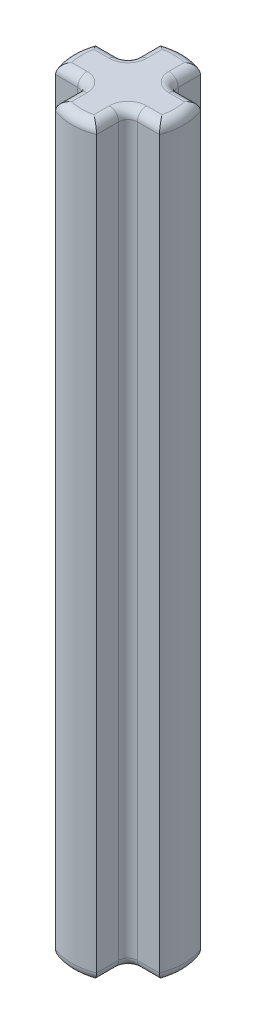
ISO-10303-21;
HEADER;
FILE_DESCRIPTION(('STEP AP214'),'2;1');
FILE_NAME('part.step','',(''),(''),'','','');
FILE_SCHEMA(('AUTOMOTIVE_DESIGN { 1 0 10303 214 1 1 1 1 }'));
ENDSEC;
DATA;
#1=APPLICATION_CONTEXT('core data for automotive mechanical design processes');
#2=APPLICATION_PROTOCOL_DEFINITION('international standard','automotive_design',2000,#1);
#3=PRODUCT_CONTEXT('',#1,'mechanical');
#4=PRODUCT('Part','Part','',(#3));
#5=PRODUCT_RELATED_PRODUCT_CATEGORY('part','',(#4));
#6=PRODUCT_DEFINITION_FORMATION('','',#4);
#7=PRODUCT_DEFINITION_CONTEXT('part definition',#1,'design');
#8=PRODUCT_DEFINITION('design','',#6,#7);
#9=PRODUCT_DEFINITION_SHAPE('','',#8);
#10=(LENGTH_UNIT() NAMED_UNIT(*) SI_UNIT(.MILLI.,.METRE.));
#11=(NAMED_UNIT(*) PLANE_ANGLE_UNIT() SI_UNIT($,.RADIAN.));
#12=(NAMED_UNIT(*) SI_UNIT($,.STERADIAN.) SOLID_ANGLE_UNIT());
#13=UNCERTAINTY_MEASURE_WITH_UNIT(LENGTH_MEASURE(1.E-05),#10,'distance_accuracy_value','');
#14=(GEOMETRIC_REPRESENTATION_CONTEXT(3) GLOBAL_UNCERTAINTY_ASSIGNED_CONTEXT((#13)) GLOBAL_UNIT_ASSIGNED_CONTEXT((#10,
#11,#12)) REPRESENTATION_CONTEXT('',''));
#15=CARTESIAN_POINT('',(0.,0.,0.));
#16=DIRECTION('',(0.,0.,1.));
#17=DIRECTION('',(1.,0.,0.));
#18=AXIS2_PLACEMENT_3D('',#15,#16,#17);
#19=CARTESIAN_POINT('',(0.,0.399999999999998,0.));
#20=DIRECTION('',(0.,1.,0.));
#21=DIRECTION('',(0.,0.,1.));
#22=AXIS2_PLACEMENT_3D('',#19,#20,#21);
#23=TOROIDAL_SURFACE('',#22,2.,0.4);
#24=CARTESIAN_POINT('',(1.94154577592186,0.,-0.48));
#25=CARTESIAN_POINT('',(1.94668411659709,-3.33086166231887E-08,-0.486567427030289));
#26=CARTESIAN_POINT('',(1.95181469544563,0.000161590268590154,-0.493141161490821));
#27=CARTESIAN_POINT('',(1.96197377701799,0.000807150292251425,-0.506195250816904));
#28=CARTESIAN_POINT('',(1.96700266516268,0.00128627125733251,-0.512675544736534));
#29=CARTESIAN_POINT('',(1.97694817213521,0.00255588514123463,-0.525532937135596));
#30=CARTESIAN_POINT('',(1.98186533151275,0.00334150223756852,-0.531910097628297));
#31=CARTESIAN_POINT('',(1.99157831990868,0.00521256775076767,-0.544551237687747));
#32=CARTESIAN_POINT('',(1.99637483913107,0.00629308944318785,-0.550815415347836));
#33=CARTESIAN_POINT('',(2.00583854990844,0.00874196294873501,-0.563220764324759));
#34=CARTESIAN_POINT('',(2.01050657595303,0.0101053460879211,-0.569362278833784));
#35=CARTESIAN_POINT('',(2.01970635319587,0.0131075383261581,-0.581512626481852));
#36=CARTESIAN_POINT('',(2.02423907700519,0.0147413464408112,-0.587521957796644));
#37=CARTESIAN_POINT('',(2.03316231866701,0.0182716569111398,-0.599398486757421));
#38=CARTESIAN_POINT('',(2.03755394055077,0.0201631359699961,-0.605266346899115));
#39=CARTESIAN_POINT('',(2.04619002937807,0.02419579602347,-0.616850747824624));
#40=CARTESIAN_POINT('',(2.05043572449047,0.0263319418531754,-0.622568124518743));
#41=CARTESIAN_POINT('',(2.05877595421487,0.0308407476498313,-0.633842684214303));
#42=CARTESIAN_POINT('',(2.06287183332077,0.033208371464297,-0.639400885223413));
#43=CARTESIAN_POINT('',(2.07090932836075,0.038166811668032,-0.650348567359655));
#44=CARTESIAN_POINT('',(2.07485239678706,0.0407526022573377,-0.655739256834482));
#45=CARTESIAN_POINT('',(2.08258202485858,0.0461339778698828,-0.666343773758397));
#46=CARTESIAN_POINT('',(2.0863701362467,0.0489245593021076,-0.671559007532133));
#47=CARTESIAN_POINT('',(2.09378842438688,0.054702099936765,-0.681804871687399));
#48=CARTESIAN_POINT('',(2.09742024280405,0.0576840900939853,-0.686837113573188));
#49=CARTESIAN_POINT('',(2.10452526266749,0.063831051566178,-0.696709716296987));
#50=CARTESIAN_POINT('',(2.10800018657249,0.0669911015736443,-0.701551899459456));
#51=CARTESIAN_POINT('',(2.11479153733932,0.0734808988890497,-0.711037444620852));
#52=CARTESIAN_POINT('',(2.11810975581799,0.0768057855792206,-0.715682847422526));
#53=CARTESIAN_POINT('',(2.12458818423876,0.0836119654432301,-0.724768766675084));
#54=CARTESIAN_POINT('',(2.12775025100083,0.0870884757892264,-0.729211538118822));
#55=CARTESIAN_POINT('',(2.13391857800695,0.0941852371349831,-0.737885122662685));
#56=CARTESIAN_POINT('',(2.13692672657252,0.0978007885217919,-0.742118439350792));
#57=CARTESIAN_POINT('',(2.14362645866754,0.106217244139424,-0.751555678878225));
#58=CARTESIAN_POINT('',(2.14729074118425,0.111080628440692,-0.756723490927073));
#59=CARTESIAN_POINT('',(2.15440673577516,0.121071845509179,-0.766781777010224));
#60=CARTESIAN_POINT('',(2.15786060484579,0.126195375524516,-0.771674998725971));
#61=CARTESIAN_POINT('',(2.16455057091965,0.13669178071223,-0.781171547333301));
#62=CARTESIAN_POINT('',(2.16778890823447,0.142060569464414,-0.785777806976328));
#63=CARTESIAN_POINT('',(2.17404168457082,0.153030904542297,-0.794689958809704));
#64=CARTESIAN_POINT('',(2.17705844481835,0.158628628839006,-0.798998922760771));
#65=CARTESIAN_POINT('',(2.18286298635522,0.170039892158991,-0.80730629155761));
#66=CARTESIAN_POINT('',(2.18565313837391,0.175849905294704,-0.811307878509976));
#67=CARTESIAN_POINT('',(2.19099992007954,0.187668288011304,-0.81899115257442));
#68=CARTESIAN_POINT('',(2.19355894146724,0.193673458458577,-0.822676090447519));
#69=CARTESIAN_POINT('',(2.19843951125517,0.205864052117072,-0.829717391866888));
#70=CARTESIAN_POINT('',(2.20076343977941,0.212046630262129,-0.833077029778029));
#71=CARTESIAN_POINT('',(2.20517068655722,0.224574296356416,-0.839460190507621));
#72=CARTESIAN_POINT('',(2.20725633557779,0.230916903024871,-0.842486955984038));
#73=CARTESIAN_POINT('',(2.21020935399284,0.240561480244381,-0.846780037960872));
#74=CARTESIAN_POINT('',(2.21116113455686,0.243785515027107,-0.848165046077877));
#75=CARTESIAN_POINT('',(2.21300388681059,0.250266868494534,-0.85084894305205));
#76=CARTESIAN_POINT('',(2.21389513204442,0.253523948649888,-0.852148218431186));
#77=CARTESIAN_POINT('',(2.21561651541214,0.260068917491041,-0.85465985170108));
#78=CARTESIAN_POINT('',(2.21644691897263,0.2633565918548,-0.855872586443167));
#79=CARTESIAN_POINT('',(2.21804641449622,0.269960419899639,-0.858210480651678));
#80=CARTESIAN_POINT('',(2.21881576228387,0.273276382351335,-0.859336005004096));
#81=CARTESIAN_POINT('',(2.22029296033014,0.279934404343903,-0.861498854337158));
#82=CARTESIAN_POINT('',(2.22100105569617,0.283276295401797,-0.862536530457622));
#83=CARTESIAN_POINT('',(2.22235560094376,0.289983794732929,-0.864523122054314));
#84=CARTESIAN_POINT('',(2.22300228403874,0.293349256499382,-0.865472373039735));
#85=CARTESIAN_POINT('',(2.22423388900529,0.300101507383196,-0.867281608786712));
#86=CARTESIAN_POINT('',(2.22481903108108,0.30348817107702,-0.86814191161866));
#87=CARTESIAN_POINT('',(2.22592747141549,0.310280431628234,-0.869772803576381));
#88=CARTESIAN_POINT('',(2.22645097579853,0.313685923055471,-0.870543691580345));
#89=CARTESIAN_POINT('',(2.22743609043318,0.320513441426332,-0.871995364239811));
#90=CARTESIAN_POINT('',(2.22789789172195,0.323935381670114,-0.872676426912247));
#91=CARTESIAN_POINT('',(2.22875958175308,0.330793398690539,-0.873948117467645));
#92=CARTESIAN_POINT('',(2.22915964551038,0.334229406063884,-0.874539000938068));
#93=CARTESIAN_POINT('',(2.22989787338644,0.341113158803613,-0.875630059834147));
#94=CARTESIAN_POINT('',(2.23023619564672,0.344560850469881,-0.876130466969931));
#95=CARTESIAN_POINT('',(2.23085098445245,0.351465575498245,-0.877040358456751));
#96=CARTESIAN_POINT('',(2.23112759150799,0.354922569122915,-0.877450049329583));
#97=CARTESIAN_POINT('',(2.23161902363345,0.361843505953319,-0.878178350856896));
#98=CARTESIAN_POINT('',(2.23183397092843,0.365307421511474,-0.878497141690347));
#99=CARTESIAN_POINT('',(2.23220218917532,0.372239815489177,-0.879043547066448));
#100=CARTESIAN_POINT('',(2.23235556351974,0.375708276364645,-0.879271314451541));
#101=CARTESIAN_POINT('',(2.2326007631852,0.382647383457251,-0.879635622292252));
#102=CARTESIAN_POINT('',(2.23269267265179,0.386118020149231,-0.879772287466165));
#103=CARTESIAN_POINT('',(2.23281512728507,0.39305910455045,-0.879954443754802));
#104=CARTESIAN_POINT('',(2.23284573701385,0.396529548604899,-0.880000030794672));
#105=CARTESIAN_POINT('',(2.23284571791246,0.399999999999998,-0.88));
#106=B_SPLINE_CURVE_WITH_KNOTS('',3,(#24,#25,#26,#27,#28,#29,#30,#31,#32,#33,#34,#35,#36,#37,
#38,#39,#40,#41,#42,#43,#44,#45,#46,#47,#48,#49,#50,#51,#52,#53,#54,#55,#56,#57,#58,#59,#60,#61,
#62,#63,#64,#65,#66,#67,#68,#69,#70,#71,#72,#73,#74,#75,#76,#77,#78,#79,#80,#81,#82,#83,#84,#85,
#86,#87,#88,#89,#90,#91,#92,#93,#94,#95,#96,#97,#98,#99,#100,#101,#102,#103,#104,#105),
.UNSPECIFIED.,.F.,.F.,(4,2,2,2,2,2,2,2,2,2,2,2,2,2,2,2,2,2,2,2,2,2,2,2,2,2,2,2,2,2,2,2,2,2,2,2,
2,2,2,2,4),(0.,0.0250147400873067,0.0496585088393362,0.0739252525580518,0.0978090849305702,
0.121304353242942,0.144405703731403,0.16710814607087,0.189407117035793,0.21129854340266,
0.232778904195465,0.253845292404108,0.274495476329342,0.294727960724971,0.314542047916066,
0.333937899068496,0.352916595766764,0.37686493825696,0.400499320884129,0.423827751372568,
0.446859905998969,0.469607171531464,0.49208266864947,0.514301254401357,0.536279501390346,
0.547185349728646,0.558038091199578,0.56884025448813,0.579594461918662,0.590303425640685,
0.60096994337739,0.611596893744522,0.62218723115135,0.632743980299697,0.643270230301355,
0.653769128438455,0.664243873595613,0.674697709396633,0.685133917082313,0.695555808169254,
0.705966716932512),.UNSPECIFIED.);
#107=CARTESIAN_POINT('',(1.94154577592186,0.,-0.48));
#108=VERTEX_POINT('',#107);
#109=CARTESIAN_POINT('',(2.23284571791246,0.399999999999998,-0.88));
#110=VERTEX_POINT('',#109);
#111=EDGE_CURVE('E246',#108,#110,#106,.T.);
#112=ORIENTED_EDGE('',*,*,#111,.T.);
#113=CARTESIAN_POINT('',(0.,0.399999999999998,0.));
#114=DIRECTION('',(0.,-1.,0.));
#115=DIRECTION('',(0.,0.,-1.));
#116=AXIS2_PLACEMENT_3D('',#113,#114,#115);
#117=CIRCLE('',#116,2.4);
#118=CARTESIAN_POINT('',(2.23284571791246,0.399999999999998,0.880000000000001));
#119=VERTEX_POINT('',#118);
#120=EDGE_CURVE('E262',#119,#110,#117,.F.);
#121=ORIENTED_EDGE('',*,*,#120,.F.);
#122=CARTESIAN_POINT('',(2.23284571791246,0.399999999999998,0.880000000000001));
#123=CARTESIAN_POINT('',(2.23284573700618,0.396530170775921,0.880000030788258));
#124=CARTESIAN_POINT('',(2.23281514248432,0.393060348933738,0.879954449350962));
#125=CARTESIAN_POINT('',(2.23269274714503,0.38612046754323,0.879772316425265));
#126=CARTESIAN_POINT('',(2.2326008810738,0.382650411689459,0.879635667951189));
#127=CARTESIAN_POINT('',(2.232355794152,0.375712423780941,0.87927140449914));
#128=CARTESIAN_POINT('',(2.2322024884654,0.372244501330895,0.879043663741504));
#129=CARTESIAN_POINT('',(2.23183443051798,0.36531314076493,0.878497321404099));
#130=CARTESIAN_POINT('',(2.23161957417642,0.361849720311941,0.878178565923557));
#131=CARTESIAN_POINT('',(2.23112834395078,0.354929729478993,0.877450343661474));
#132=CARTESIAN_POINT('',(2.23085184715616,0.351473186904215,0.877040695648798));
#133=CARTESIAN_POINT('',(2.23023729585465,0.344569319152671,0.876130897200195));
#134=CARTESIAN_POINT('',(2.22989910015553,0.341122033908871,0.875630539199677));
#135=CARTESIAN_POINT('',(2.22916113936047,0.33423904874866,0.874539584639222));
#136=CARTESIAN_POINT('',(2.22876121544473,0.330803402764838,0.873948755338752));
#137=CARTESIAN_POINT('',(2.22789981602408,0.323946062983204,0.87267717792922));
#138=CARTESIAN_POINT('',(2.22743816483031,0.320524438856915,0.871996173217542));
#139=CARTESIAN_POINT('',(2.22645335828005,0.31369750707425,0.870544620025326));
#140=CARTESIAN_POINT('',(2.22593001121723,0.310292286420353,0.86977379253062));
#141=CARTESIAN_POINT('',(2.22482189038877,0.303500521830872,0.868143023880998));
#142=CARTESIAN_POINT('',(2.22423690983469,0.30011408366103,0.867282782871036));
#143=CARTESIAN_POINT('',(2.22300562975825,0.293362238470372,0.86547367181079));
#144=CARTESIAN_POINT('',(2.22235910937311,0.289996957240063,0.86452448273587));
#145=CARTESIAN_POINT('',(2.2210048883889,0.283289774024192,0.862538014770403));
#146=CARTESIAN_POINT('',(2.2202969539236,0.279948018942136,0.86150039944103));
#147=CARTESIAN_POINT('',(2.21882007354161,0.273290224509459,0.859337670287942));
#148=CARTESIAN_POINT('',(2.2180508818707,0.269974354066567,0.858212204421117));
#149=CARTESIAN_POINT('',(2.21645169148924,0.263370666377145,0.855874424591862));
#150=CARTESIAN_POINT('',(2.21562143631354,0.26008304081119,0.854661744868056));
#151=CARTESIAN_POINT('',(2.21390033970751,0.253538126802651,0.852150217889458));
#152=CARTESIAN_POINT('',(2.21300923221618,0.25028105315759,0.850850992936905));
#153=CARTESIAN_POINT('',(2.21116674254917,0.243799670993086,0.848167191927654));
#154=CARTESIAN_POINT('',(2.21021508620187,0.240575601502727,0.846782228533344));
#155=CARTESIAN_POINT('',(2.20726240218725,0.230930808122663,0.842489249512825));
#156=CARTESIAN_POINT('',(2.20517695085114,0.224588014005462,0.83946255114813));
#157=CARTESIAN_POINT('',(2.20077001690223,0.212059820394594,0.833079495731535));
#158=CARTESIAN_POINT('',(2.19844619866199,0.205876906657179,0.829719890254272));
#159=CARTESIAN_POINT('',(2.1935657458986,0.19368550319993,0.822678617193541));
#160=CARTESIAN_POINT('',(2.1910067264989,0.187679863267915,0.818993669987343));
#161=CARTESIAN_POINT('',(2.18565982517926,0.175860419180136,0.811310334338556));
#162=CARTESIAN_POINT('',(2.18286954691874,0.170049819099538,0.807308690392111));
#163=CARTESIAN_POINT('',(2.17706461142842,0.158637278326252,0.799001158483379));
#164=CARTESIAN_POINT('',(2.17404757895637,0.153038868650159,0.794692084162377));
#165=CARTESIAN_POINT('',(2.16779409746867,0.142067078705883,0.78577966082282));
#166=CARTESIAN_POINT('',(2.16455532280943,0.136697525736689,0.781173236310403));
#167=CARTESIAN_POINT('',(2.15786431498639,0.126199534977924,0.77167629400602));
#168=CARTESIAN_POINT('',(2.15440983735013,0.121075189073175,0.766782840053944));
#169=CARTESIAN_POINT('',(2.14729241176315,0.111082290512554,0.756724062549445));
#170=CARTESIAN_POINT('',(2.14362730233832,0.10621804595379,0.751555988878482));
#171=CARTESIAN_POINT('',(2.13692730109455,0.0978017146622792,0.742119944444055));
#172=CARTESIAN_POINT('',(2.13391975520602,0.0941870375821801,0.737888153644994));
#173=CARTESIAN_POINT('',(2.12775265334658,0.08709182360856,0.729217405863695));
#174=CARTESIAN_POINT('',(2.12459120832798,0.0836159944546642,0.724775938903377));
#175=CARTESIAN_POINT('',(2.11811399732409,0.0768109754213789,0.715692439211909));
#176=CARTESIAN_POINT('',(2.11479637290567,0.0734865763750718,0.711048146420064));
#177=CARTESIAN_POINT('',(2.10800617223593,0.0669975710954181,0.701564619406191));
#178=CARTESIAN_POINT('',(2.1045318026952,0.0638378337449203,0.696723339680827));
#179=CARTESIAN_POINT('',(2.09742783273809,0.0576913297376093,0.686852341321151));
#180=CARTESIAN_POINT('',(2.09379650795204,0.0547094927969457,0.681820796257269));
#181=CARTESIAN_POINT('',(2.08637913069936,0.0489321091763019,0.671576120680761));
#182=CARTESIAN_POINT('',(2.08259143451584,0.0461415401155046,0.666361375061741));
#183=CARTESIAN_POINT('',(2.07486254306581,0.0407600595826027,0.655757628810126));
#184=CARTESIAN_POINT('',(2.07091979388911,0.0381741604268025,0.650367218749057));
#185=CARTESIAN_POINT('',(2.06288282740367,0.0332153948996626,0.639419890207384));
#186=CARTESIAN_POINT('',(2.05878715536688,0.030847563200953,0.633861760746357));
#187=CARTESIAN_POINT('',(2.05044721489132,0.0263382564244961,0.622587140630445));
#188=CARTESIAN_POINT('',(2.04620159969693,0.0242018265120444,0.616869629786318));
#189=CARTESIAN_POINT('',(2.03756553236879,0.0201685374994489,0.605284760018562));
#190=CARTESIAN_POINT('',(2.03317384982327,0.0182767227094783,0.599416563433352));
#191=CARTESIAN_POINT('',(2.02425033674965,0.0147457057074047,0.587539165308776));
#192=CARTESIAN_POINT('',(2.01971740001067,0.0131115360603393,0.581529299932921));
#193=CARTESIAN_POINT('',(2.01051703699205,0.0101086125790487,0.569377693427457));
#194=CARTESIAN_POINT('',(2.00584863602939,0.00874486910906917,0.56323545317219));
#195=CARTESIAN_POINT('',(1.99638400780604,0.00629529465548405,0.550828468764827));
#196=CARTESIAN_POINT('',(1.99158694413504,0.00521444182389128,0.544563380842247));
#197=CARTESIAN_POINT('',(1.98187269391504,0.00334276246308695,0.531920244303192));
#198=CARTESIAN_POINT('',(1.97695481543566,0.00255687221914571,0.525541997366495));
#199=CARTESIAN_POINT('',(1.9670076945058,0.00128678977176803,0.512682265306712));
#200=CARTESIAN_POINT('',(1.96197791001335,0.000807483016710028,0.506200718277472));
#201=CARTESIAN_POINT('',(1.95181686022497,0.000161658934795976,0.493143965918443));
#202=CARTESIAN_POINT('',(1.94668520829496,-3.32388647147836E-08,0.486568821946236));
#203=CARTESIAN_POINT('',(1.94154577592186,0.,0.480000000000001));
#204=B_SPLINE_CURVE_WITH_KNOTS('',3,(#122,#123,#124,#125,#126,#127,#128,#129,#130,#131,#132,
#133,#134,#135,#136,#137,#138,#139,#140,#141,#142,#143,#144,#145,#146,#147,#148,#149,#150,#151,
#152,#153,#154,#155,#156,#157,#158,#159,#160,#161,#162,#163,#164,#165,#166,#167,#168,#169,#170,
#171,#172,#173,#174,#175,#176,#177,#178,#179,#180,#181,#182,#183,#184,#185,#186,#187,#188,#189,
#190,#191,#192,#193,#194,#195,#196,#197,#198,#199,#200,#201,#202,#203),.UNSPECIFIED.,.F.,.F.,(4,
2,2,2,2,2,2,2,2,2,2,2,2,2,2,2,2,2,2,2,2,2,2,2,2,2,2,2,2,2,2,2,2,2,2,2,2,2,2,2,4),(0.,
0.0104090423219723,0.0208291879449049,0.0312637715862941,0.0417161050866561,0.0521894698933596,
0.0626871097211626,0.0732122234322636,0.0837679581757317,0.0943574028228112,0.10498358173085,
0.115649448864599,0.126357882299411,0.137111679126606,0.147913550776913,0.15876611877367,
0.169671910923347,0.191650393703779,0.213869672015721,0.236346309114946,0.259095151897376,
0.282129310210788,0.305460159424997,0.329097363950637,0.353048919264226,0.372022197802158,
0.391413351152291,0.411223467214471,0.431452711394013,0.452100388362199,0.4731650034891,
0.494644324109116,0.516535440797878,0.538834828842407,0.561538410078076,0.584641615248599,
0.608139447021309,0.632026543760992,0.656297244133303,0.680945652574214,0.705965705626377),.UNSPECIFIED.);
#205=CARTESIAN_POINT('',(1.94154577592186,0.,0.480000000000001));
#206=VERTEX_POINT('',#205);
#207=EDGE_CURVE('E247',#119,#206,#204,.T.);
#208=ORIENTED_EDGE('',*,*,#207,.T.);
#209=CARTESIAN_POINT('',(0.,0.,0.));
#210=DIRECTION('',(0.,1.,0.));
#211=DIRECTION('',(0.970772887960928,0.,0.24));
#212=AXIS2_PLACEMENT_3D('',#209,#210,#211);
#213=CIRCLE('',#212,2.);
#214=EDGE_CURVE('E234',#206,#108,#213,.T.);
#215=ORIENTED_EDGE('',*,*,#214,.T.);
#216=EDGE_LOOP('',(#112,#121,#208,#215));
#217=FACE_BOUND('',#216,.T.);
#218=ADVANCED_FACE('F16',(#217),#23,.T.);
#219=CARTESIAN_POINT('',(0.,31.6,0.));
#220=DIRECTION('',(0.,1.,0.));
#221=DIRECTION('',(0.,0.,1.));
#222=AXIS2_PLACEMENT_3D('',#219,#220,#221);
#223=TOROIDAL_SURFACE('',#222,2.,0.4);
#224=CARTESIAN_POINT('',(2.23284571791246,31.6,-0.88));
#225=CARTESIAN_POINT('',(2.23284573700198,31.6034696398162,-0.880000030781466));
#226=CARTESIAN_POINT('',(2.23281514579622,31.6069392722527,-0.87995445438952));
#227=CARTESIAN_POINT('',(2.23269276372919,31.6138787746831,-0.879772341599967));
#228=CARTESIAN_POINT('',(2.23260090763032,31.6173486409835,-0.879635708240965));
#229=CARTESIAN_POINT('',(2.23235584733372,31.624286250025,-0.879271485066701));
#230=CARTESIAN_POINT('',(2.23220255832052,31.6277539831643,-0.879043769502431));
#231=CARTESIAN_POINT('',(2.23183454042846,31.634684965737,-0.878497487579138));
#232=CARTESIAN_POINT('',(2.23161970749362,31.6381481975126,-0.878178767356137));
#233=CARTESIAN_POINT('',(2.23112853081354,31.6450678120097,-0.877450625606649));
#234=CARTESIAN_POINT('',(2.23085206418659,31.6485241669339,-0.877041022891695));
#235=CARTESIAN_POINT('',(2.23023757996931,31.6554276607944,-0.876131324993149));
#236=CARTESIAN_POINT('',(2.22989942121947,31.6588747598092,-0.875631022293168));
#237=CARTESIAN_POINT('',(2.22916154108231,31.6657573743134,-0.874540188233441));
#238=CARTESIAN_POINT('',(2.2287616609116,31.6691928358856,-0.873949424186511));
#239=CARTESIAN_POINT('',(2.2279003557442,31.6760498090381,-0.872677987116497));
#240=CARTESIAN_POINT('',(2.2274387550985,31.6794712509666,-0.871997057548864));
#241=CARTESIAN_POINT('',(2.22645405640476,31.6862978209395,-0.870545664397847));
#242=CARTESIAN_POINT('',(2.22593076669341,31.6897028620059,-0.869774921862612));
#243=CARTESIAN_POINT('',(2.22482276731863,31.6964942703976,-0.868144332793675));
#244=CARTESIAN_POINT('',(2.22423785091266,31.6998805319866,-0.867284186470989));
#245=CARTESIAN_POINT('',(2.2230067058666,31.7066320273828,-0.865475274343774));
#246=CARTESIAN_POINT('',(2.22236025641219,31.7099971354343,-0.864526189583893));
#247=CARTESIAN_POINT('',(2.2210061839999,31.7167039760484,-0.862539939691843));
#248=CARTESIAN_POINT('',(2.22029832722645,31.7200455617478,-0.861502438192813));
#249=CARTESIAN_POINT('',(2.21882160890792,31.7267030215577,-0.859339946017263));
#250=CARTESIAN_POINT('',(2.21805250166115,31.7300187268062,-0.858214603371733));
#251=CARTESIAN_POINT('',(2.21645348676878,31.7366220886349,-0.855877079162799));
#252=CARTESIAN_POINT('',(2.21562332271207,31.739909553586,-0.854664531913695));
#253=CARTESIAN_POINT('',(2.21390241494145,31.7464541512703,-0.852153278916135));
#254=CARTESIAN_POINT('',(2.21301140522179,31.749711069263,-0.85085419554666));
#255=CARTESIAN_POINT('',(2.21116911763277,31.7561921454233,-0.84817068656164));
#256=CARTESIAN_POINT('',(2.21021756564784,31.7594160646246,-0.846785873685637));
#257=CARTESIAN_POINT('',(2.20726520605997,31.7690604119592,-0.84249336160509));
#258=CARTESIAN_POINT('',(2.20517998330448,31.7754029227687,-0.839466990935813));
#259=CARTESIAN_POINT('',(2.2007735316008,31.7879305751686,-0.833084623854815));
#260=CARTESIAN_POINT('',(2.19844996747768,31.7941132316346,-0.829725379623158));
#261=CARTESIAN_POINT('',(2.19357004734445,31.8063041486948,-0.82268486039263));
#262=CARTESIAN_POINT('',(2.19101130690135,31.812309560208,-0.819000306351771));
#263=CARTESIAN_POINT('',(2.18566498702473,31.8241285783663,-0.811317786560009));
#264=CARTESIAN_POINT('',(2.18287501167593,31.8299389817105,-0.807316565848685));
#265=CARTESIAN_POINT('',(2.17707070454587,31.8413511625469,-0.799009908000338));
#266=CARTESIAN_POINT('',(2.17405399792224,31.8469494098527,-0.794701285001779));
#267=CARTESIAN_POINT('',(2.16780118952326,31.8579209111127,-0.785789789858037));
#268=CARTESIAN_POINT('',(2.16456276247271,31.8632903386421,-0.781183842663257));
#269=CARTESIAN_POINT('',(2.15787246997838,31.8737881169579,-0.771687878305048));
#270=CARTESIAN_POINT('',(2.15441836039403,31.8789123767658,-0.766794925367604));
#271=CARTESIAN_POINT('',(2.14730168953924,31.888905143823,-0.756737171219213));
#272=CARTESIAN_POINT('',(2.14363696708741,31.8937693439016,-0.751569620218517));
#273=CARTESIAN_POINT('',(2.13693730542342,31.9021860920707,-0.74213400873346));
#274=CARTESIAN_POINT('',(2.13392969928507,31.9058011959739,-0.737902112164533));
#275=CARTESIAN_POINT('',(2.1277624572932,31.9128972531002,-0.729231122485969));
#276=CARTESIAN_POINT('',(2.1246009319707,31.9163734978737,-0.724789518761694));
#277=CARTESIAN_POINT('',(2.11812354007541,31.9231793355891,-0.715705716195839));
#278=CARTESIAN_POINT('',(2.11480581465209,31.9265041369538,-0.711061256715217));
#279=CARTESIAN_POINT('',(2.10801539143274,31.9329939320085,-0.701577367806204));
#280=CARTESIAN_POINT('',(2.10454089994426,31.9361540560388,-0.696735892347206));
#281=CARTESIAN_POINT('',(2.09743666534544,31.9423013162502,-0.686864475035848));
#282=CARTESIAN_POINT('',(2.09380519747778,31.9452835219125,-0.681832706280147));
#283=CARTESIAN_POINT('',(2.08638751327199,31.9510616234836,-0.671587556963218));
#284=CARTESIAN_POINT('',(2.08259965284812,31.9538525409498,-0.666372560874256));
#285=CARTESIAN_POINT('',(2.07487041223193,31.9592346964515,-0.655768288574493));
#286=CARTESIAN_POINT('',(2.07092747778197,31.9618209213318,-0.650377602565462));
#287=CARTESIAN_POINT('',(2.06289012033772,31.9667803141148,-0.639429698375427));
#288=CARTESIAN_POINT('',(2.05879424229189,31.969148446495,-0.633871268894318));
#289=CARTESIAN_POINT('',(2.05045386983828,31.9736583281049,-0.622596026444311));
#290=CARTESIAN_POINT('',(2.04620802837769,31.9757950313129,-0.616878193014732));
#291=CARTESIAN_POINT('',(2.03757148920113,31.9798288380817,-0.605292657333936));
#292=CARTESIAN_POINT('',(2.03317956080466,31.9817208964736,-0.599424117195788));
#293=CARTESIAN_POINT('',(2.02425553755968,31.9852523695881,-0.587546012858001));
#294=CARTESIAN_POINT('',(2.019722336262,31.9868867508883,-0.581535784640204));
#295=CARTESIAN_POINT('',(2.01052142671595,31.9898900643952,-0.569383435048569));
#296=CARTESIAN_POINT('',(2.00585274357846,31.9912539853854,-0.563240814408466));
#297=CARTESIAN_POINT('',(1.99638753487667,31.9937038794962,-0.550833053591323));
#298=CARTESIAN_POINT('',(1.99159017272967,31.9947848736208,-0.544567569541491));
#299=CARTESIAN_POINT('',(1.98187531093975,31.9966567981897,-0.531923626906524));
#300=CARTESIAN_POINT('',(1.97695711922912,31.9974427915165,-0.525544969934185));
#301=CARTESIAN_POINT('',(1.96700935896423,31.9987130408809,-0.51268440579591));
#302=CARTESIAN_POINT('',(1.96197924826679,31.9991924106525,-0.506202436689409));
#303=CARTESIAN_POINT('',(1.95181753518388,31.9998383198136,-0.493144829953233));
#304=CARTESIAN_POINT('',(1.94668554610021,32.0000000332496,-0.486569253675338));
#305=CARTESIAN_POINT('',(1.94154577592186,32.,-0.48));
#306=B_SPLINE_CURVE_WITH_KNOTS('',3,(#224,#225,#226,#227,#228,#229,#230,#231,#232,#233,#234,
#235,#236,#237,#238,#239,#240,#241,#242,#243,#244,#245,#246,#247,#248,#249,#250,#251,#252,#253,
#254,#255,#256,#257,#258,#259,#260,#261,#262,#263,#264,#265,#266,#267,#268,#269,#270,#271,#272,
#273,#274,#275,#276,#277,#278,#279,#280,#281,#282,#283,#284,#285,#286,#287,#288,#289,#290,#291,
#292,#293,#294,#295,#296,#297,#298,#299,#300,#301,#302,#303,#304,#305),.UNSPECIFIED.,.F.,.F.,(4,
2,2,2,2,2,2,2,2,2,2,2,2,2,2,2,2,2,2,2,2,2,2,2,2,2,2,2,2,2,2,2,2,2,2,2,2,2,2,2,4),(0.,
0.0104084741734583,0.0208280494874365,0.0312620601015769,0.0417138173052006,0.0521866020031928,
0.0626836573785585,0.0732081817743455,0.0837633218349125,0.0943521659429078,0.104977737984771,
0.115642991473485,0.126350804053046,0.137103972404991,0.147905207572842,0.158757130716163,
0.169662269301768,0.191639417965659,0.213857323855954,0.236332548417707,0.259079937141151,
0.282112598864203,0.305441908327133,0.3290775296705,0.353027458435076,0.37200176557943,
0.391393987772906,0.411205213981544,0.431435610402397,0.45208448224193,0.473150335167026,
0.494630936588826,0.516523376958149,0.538824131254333,0.561529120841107,0.584633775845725,
0.608133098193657,0.632021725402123,0.656293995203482,0.680944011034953,0.705965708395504),.UNSPECIFIED.);
#307=CARTESIAN_POINT('',(2.23284571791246,31.6,-0.88));
#308=VERTEX_POINT('',#307);
#309=CARTESIAN_POINT('',(1.94154577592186,32.,-0.48));
#310=VERTEX_POINT('',#309);
#311=EDGE_CURVE('E325',#308,#310,#306,.T.);
#312=ORIENTED_EDGE('',*,*,#311,.T.);
#313=CARTESIAN_POINT('',(0.,32.,0.));
#314=DIRECTION('',(0.,-1.,0.));
#315=DIRECTION('',(0.970772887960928,0.,-0.24));
#316=AXIS2_PLACEMENT_3D('',#313,#314,#315);
#317=CIRCLE('',#316,2.);
#318=CARTESIAN_POINT('',(1.94154577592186,32.,0.480000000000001));
#319=VERTEX_POINT('',#318);
#320=EDGE_CURVE('E289',#310,#319,#317,.T.);
#321=ORIENTED_EDGE('',*,*,#320,.T.);
#322=CARTESIAN_POINT('',(1.94154577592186,32.,0.480000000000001));
#323=CARTESIAN_POINT('',(1.94668445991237,32.000000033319,0.486567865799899));
#324=CARTESIAN_POINT('',(1.9518153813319,31.9998383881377,0.493142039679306));
#325=CARTESIAN_POINT('',(1.96197513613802,31.9991927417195,0.50619699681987));
#326=CARTESIAN_POINT('',(1.96700435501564,31.9987135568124,0.512677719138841));
#327=CARTESIAN_POINT('',(1.97695050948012,31.997443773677,0.52553595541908));
#328=CARTESIAN_POINT('',(1.98186798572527,31.9966580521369,0.531913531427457));
#329=CARTESIAN_POINT('',(1.99158159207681,31.994786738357,0.544555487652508));
#330=CARTESIAN_POINT('',(1.99637841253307,31.9937060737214,0.550820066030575));
#331=CARTESIAN_POINT('',(2.00584270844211,31.9912568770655,0.563226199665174));
#332=CARTESIAN_POINT('',(2.01051101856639,31.9898933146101,0.569368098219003));
#333=CARTESIAN_POINT('',(2.0197113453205,31.9868907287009,0.581519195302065));
#334=CARTESIAN_POINT('',(2.02424433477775,31.9852567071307,0.587528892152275));
#335=CARTESIAN_POINT('',(2.0331680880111,31.9817259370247,0.599406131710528));
#336=CARTESIAN_POINT('',(2.03755995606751,31.9798342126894,0.605274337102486));
#337=CARTESIAN_POINT('',(2.04619651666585,31.9758010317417,0.616859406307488));
#338=CARTESIAN_POINT('',(2.0504424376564,31.9736646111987,0.622577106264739));
#339=CARTESIAN_POINT('',(2.05878309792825,31.9691552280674,0.63385228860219));
#340=CARTESIAN_POINT('',(2.06287918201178,31.9667873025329,0.639410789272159));
#341=CARTESIAN_POINT('',(2.07091706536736,31.9618282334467,0.650359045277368));
#342=CARTESIAN_POINT('',(2.07486031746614,31.959242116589,0.655750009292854));
#343=CARTESIAN_POINT('',(2.08259029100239,31.9538600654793,0.666355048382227));
#344=CARTESIAN_POINT('',(2.08637856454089,31.9510691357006,0.671570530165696));
#345=CARTESIAN_POINT('',(2.09379715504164,31.9452908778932,0.681816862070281));
#346=CARTESIAN_POINT('',(2.09742911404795,31.9423085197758,0.686849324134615));
#347=CARTESIAN_POINT('',(2.10453439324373,31.9361608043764,0.696722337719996));
#348=CARTESIAN_POINT('',(2.108009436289,31.9330003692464,0.701564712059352));
#349=CARTESIAN_POINT('',(2.11480100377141,31.9265097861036,0.711050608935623));
#350=CARTESIAN_POINT('',(2.11811932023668,31.9231844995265,0.715696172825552));
#351=CARTESIAN_POINT('',(2.12459792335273,31.9163775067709,0.724782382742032));
#352=CARTESIAN_POINT('',(2.12776006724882,31.9129005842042,0.729225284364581));
#353=CARTESIAN_POINT('',(2.13392852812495,31.9058029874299,0.737899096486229));
#354=CARTESIAN_POINT('',(2.1369367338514,31.9021870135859,0.742132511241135));
#355=CARTESIAN_POINT('',(2.14363612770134,31.8937701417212,0.75156931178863));
#356=CARTESIAN_POINT('',(2.14730002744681,31.8889067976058,0.756736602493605));
#357=CARTESIAN_POINT('',(2.15441527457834,31.8789157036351,0.766793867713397));
#358=CARTESIAN_POINT('',(2.15786877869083,31.8737922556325,0.77168658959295));
#359=CARTESIAN_POINT('',(2.16455803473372,31.8632960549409,0.781182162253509));
#360=CARTESIAN_POINT('',(2.16779602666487,31.8579273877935,0.785787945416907));
#361=CARTESIAN_POINT('',(2.17404813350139,31.8469573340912,0.794699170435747));
#362=CARTESIAN_POINT('',(2.17706456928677,31.841359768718,0.799007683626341));
#363=CARTESIAN_POINT('',(2.18286848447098,31.8299488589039,0.807314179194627));
#364=CARTESIAN_POINT('',(2.18565833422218,31.8241390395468,0.811315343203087));
#365=CARTESIAN_POINT('',(2.19100453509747,31.8123210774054,0.818997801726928));
#366=CARTESIAN_POINT('',(2.19356327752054,31.8063161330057,0.822682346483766));
#367=CARTESIAN_POINT('',(2.19844331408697,31.7941260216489,0.829722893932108));
#368=CARTESIAN_POINT('',(2.2007669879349,31.7879436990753,0.833082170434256));
#369=CARTESIAN_POINT('',(2.20517375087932,31.7754165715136,0.839464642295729));
#370=CARTESIAN_POINT('',(2.20725917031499,31.7690742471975,0.842491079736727));
#371=CARTESIAN_POINT('',(2.21021186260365,31.759430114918,0.846783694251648));
#372=CARTESIAN_POINT('',(2.2111635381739,31.7562062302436,0.848168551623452));
#373=CARTESIAN_POINT('',(2.21300608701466,31.7497251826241,0.850852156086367));
#374=CARTESIAN_POINT('',(2.21389723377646,31.746468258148,0.852151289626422));
#375=CARTESIAN_POINT('',(2.21561842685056,31.7399236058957,0.854662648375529));
#376=CARTESIAN_POINT('',(2.21644873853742,31.7366360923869,0.855875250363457));
#377=CARTESIAN_POINT('',(2.21804805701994,31.7300325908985,0.858212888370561));
#378=CARTESIAN_POINT('',(2.21881731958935,31.7267167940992,0.859338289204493));
#379=CARTESIAN_POINT('',(2.22029435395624,31.7200591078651,0.861500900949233));
#380=CARTESIAN_POINT('',(2.22100237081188,31.7167173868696,0.862538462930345));
#381=CARTESIAN_POINT('',(2.22235676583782,31.7100102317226,0.864524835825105));
#382=CARTESIAN_POINT('',(2.22300337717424,31.7066449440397,0.865473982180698));
#383=CARTESIAN_POINT('',(2.22423484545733,31.6998930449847,0.867283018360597));
#384=CARTESIAN_POINT('',(2.22481992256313,31.6965065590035,0.868143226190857));
#385=CARTESIAN_POINT('',(2.22592823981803,31.6897146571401,0.869773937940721));
#386=CARTESIAN_POINT('',(2.22645168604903,31.6863093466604,0.870544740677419));
#387=CARTESIAN_POINT('',(2.22743669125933,31.6794821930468,0.871996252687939));
#388=CARTESIAN_POINT('',(2.22789844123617,31.6760604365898,0.87267723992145));
#389=CARTESIAN_POINT('',(2.22876003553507,31.6692027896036,0.873948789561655));
#390=CARTESIAN_POINT('',(2.22916005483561,31.6657669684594,0.874539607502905));
#391=CARTESIAN_POINT('',(2.22989820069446,31.6588835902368,0.875630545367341));
#392=CARTESIAN_POINT('',(2.2302364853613,31.6554360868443,0.876130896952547));
#393=CARTESIAN_POINT('',(2.23085120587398,31.6485317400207,0.877040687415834));
#394=CARTESIAN_POINT('',(2.23112778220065,31.6450749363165,0.877450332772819));
#395=CARTESIAN_POINT('',(2.23161915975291,31.6381543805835,0.878178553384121));
#396=CARTESIAN_POINT('',(2.23183408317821,31.6346906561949,0.878497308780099));
#397=CARTESIAN_POINT('',(2.23220226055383,31.6277586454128,0.879043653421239));
#398=CARTESIAN_POINT('',(2.23235561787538,31.6242903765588,0.879271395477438));
#399=CARTESIAN_POINT('',(2.23260079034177,31.6173516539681,0.87963566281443));
#400=CARTESIAN_POINT('',(2.23269268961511,31.613881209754,0.87977231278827));
#401=CARTESIAN_POINT('',(2.23281513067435,31.6069405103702,0.879954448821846));
#402=CARTESIAN_POINT('',(2.23284573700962,31.6034702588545,0.880000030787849));
#403=CARTESIAN_POINT('',(2.23284571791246,31.6,0.880000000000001));
#404=B_SPLINE_CURVE_WITH_KNOTS('',3,(#322,#323,#324,#325,#326,#327,#328,#329,#330,#331,#332,
#333,#334,#335,#336,#337,#338,#339,#340,#341,#342,#343,#344,#345,#346,#347,#348,#349,#350,#351,
#352,#353,#354,#355,#356,#357,#358,#359,#360,#361,#362,#363,#364,#365,#366,#367,#368,#369,#370,
#371,#372,#373,#374,#375,#376,#377,#378,#379,#380,#381,#382,#383,#384,#385,#386,#387,#388,#389,
#390,#391,#392,#393,#394,#395,#396,#397,#398,#399,#400,#401,#402,#403),.UNSPECIFIED.,.F.,.F.,(4,
2,2,2,2,2,2,2,2,2,2,2,2,2,2,2,2,2,2,2,2,2,2,2,2,2,2,2,2,2,2,2,2,2,2,2,2,2,2,2,4),(0.,
0.0250164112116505,0.0496618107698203,0.0739301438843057,0.0978155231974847,0.121312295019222,
0.144415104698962,0.16711896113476,0.189419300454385,0.211312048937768,0.232793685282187,
0.253861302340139,0.274512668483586,0.294746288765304,0.314561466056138,0.33395836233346,
0.352938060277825,0.376884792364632,0.400517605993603,0.423844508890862,0.446875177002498,
0.469620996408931,0.492095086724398,0.514312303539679,0.536289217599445,0.547194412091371,
0.558046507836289,0.568848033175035,0.579601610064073,0.590309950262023,0.600975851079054,
0.611602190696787,0.622191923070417,0.632748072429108,0.643273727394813,0.65377203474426,
0.664246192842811,0.674699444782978,0.685135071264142,0.695556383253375,0.705966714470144),.UNSPECIFIED.);
#405=CARTESIAN_POINT('',(2.23284571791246,31.6,0.880000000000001));
#406=VERTEX_POINT('',#405);
#407=EDGE_CURVE('E314',#319,#406,#404,.T.);
#408=ORIENTED_EDGE('',*,*,#407,.T.);
#409=CARTESIAN_POINT('',(0.,31.6,0.));
#410=DIRECTION('',(0.,-1.,0.));
#411=DIRECTION('',(0.,0.,-1.));
#412=AXIS2_PLACEMENT_3D('',#409,#410,#411);
#413=CIRCLE('',#412,2.4);
#414=EDGE_CURVE('E336',#308,#406,#413,.T.);
#415=ORIENTED_EDGE('',*,*,#414,.F.);
#416=EDGE_LOOP('',(#312,#321,#408,#415));
#417=FACE_BOUND('',#416,.T.);
#418=ADVANCED_FACE('F293',(#417),#223,.T.);
#419=CARTESIAN_POINT('',(0.880000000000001,32.,-0.88));
#420=DIRECTION('',(0.,0.,1.));
#421=DIRECTION('',(1.,0.,0.));
#422=AXIS2_PLACEMENT_3D('',#419,#420,#421);
#423=PLANE('',#422);
#424=DIRECTION('',(1.,0.,0.));
#425=VECTOR('',#424,1.);
#426=CARTESIAN_POINT('',(0.880000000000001,0.399999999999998,-0.88));
#427=LINE('',#426,#425);
#428=CARTESIAN_POINT('',(1.28,0.399999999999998,-0.88));
#429=VERTEX_POINT('',#428);
#430=EDGE_CURVE('E342',#429,#110,#427,.T.);
#431=ORIENTED_EDGE('',*,*,#430,.F.);
#432=DIRECTION('',(0.,1.,0.));
#433=VECTOR('',#432,1.);
#434=CARTESIAN_POINT('',(1.28,32.,-0.88));
#435=LINE('',#434,#433);
#436=CARTESIAN_POINT('',(1.28,31.6,-0.88));
#437=VERTEX_POINT('',#436);
#438=EDGE_CURVE('E353',#429,#437,#435,.T.);
#439=ORIENTED_EDGE('',*,*,#438,.T.);
#440=DIRECTION('',(1.,0.,0.));
#441=VECTOR('',#440,1.);
#442=CARTESIAN_POINT('',(0.880000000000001,31.6,-0.88));
#443=LINE('',#442,#441);
#444=EDGE_CURVE('E344',#308,#437,#443,.F.);
#445=ORIENTED_EDGE('',*,*,#444,.F.);
#446=DIRECTION('',(0.,-1.,0.));
#447=VECTOR('',#446,1.);
#448=CARTESIAN_POINT('',(2.23284571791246,32.,-0.88));
#449=LINE('',#448,#447);
#450=EDGE_CURVE('E329',#110,#308,#449,.F.);
#451=ORIENTED_EDGE('',*,*,#450,.F.);
#452=EDGE_LOOP('',(#431,#439,#445,#451));
#453=FACE_BOUND('',#452,.T.);
#454=ADVANCED_FACE('F303',(#453),#423,.F.);
#455=CARTESIAN_POINT('',(0.,32.,0.));
#456=DIRECTION('',(0.,-1.,0.));
#457=DIRECTION('',(0.,0.,-1.));
#458=AXIS2_PLACEMENT_3D('',#455,#456,#457);
#459=CYLINDRICAL_SURFACE('',#458,2.4);
#460=ORIENTED_EDGE('',*,*,#450,.T.);
#461=ORIENTED_EDGE('',*,*,#414,.T.);
#462=DIRECTION('',(0.,1.,0.));
#463=VECTOR('',#462,1.);
#464=CARTESIAN_POINT('',(2.23284571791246,32.,0.880000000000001));
#465=LINE('',#464,#463);
#466=EDGE_CURVE('E392',#406,#119,#465,.F.);
#467=ORIENTED_EDGE('',*,*,#466,.T.);
#468=ORIENTED_EDGE('',*,*,#120,.T.);
#469=EDGE_LOOP('',(#460,#461,#467,#468));
#470=FACE_BOUND('',#469,.T.);
#471=ADVANCED_FACE('F543',(#470),#459,.T.);
#472=CARTESIAN_POINT('',(1.28,32.,-1.28));
#473=DIRECTION('',(0.,1.,0.));
#474=DIRECTION('',(0.,0.,1.));
#475=AXIS2_PLACEMENT_3D('',#472,#473,#474);
#476=CYLINDRICAL_SURFACE('',#475,0.4);
#477=ORIENTED_EDGE('',*,*,#438,.F.);
#478=CARTESIAN_POINT('',(1.28,0.399999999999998,-1.28));
#479=DIRECTION('',(0.,1.,0.));
#480=DIRECTION('',(0.,0.,1.));
#481=AXIS2_PLACEMENT_3D('',#478,#479,#480);
#482=CIRCLE('',#481,0.4);
#483=CARTESIAN_POINT('',(0.880000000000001,0.399999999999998,-1.28));
#484=VERTEX_POINT('',#483);
#485=EDGE_CURVE('E340',#484,#429,#482,.T.);
#486=ORIENTED_EDGE('',*,*,#485,.F.);
#487=DIRECTION('',(0.,1.,0.));
#488=VECTOR('',#487,1.);
#489=CARTESIAN_POINT('',(0.880000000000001,32.,-1.28));
#490=LINE('',#489,#488);
#491=CARTESIAN_POINT('',(0.880000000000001,31.6,-1.28));
#492=VERTEX_POINT('',#491);
#493=EDGE_CURVE('E388',#484,#492,#490,.T.);
#494=ORIENTED_EDGE('',*,*,#493,.T.);
#495=CARTESIAN_POINT('',(1.28,31.6,-1.28));
#496=DIRECTION('',(0.,1.,0.));
#497=DIRECTION('',(0.,0.,1.));
#498=AXIS2_PLACEMENT_3D('',#495,#496,#497);
#499=CIRCLE('',#498,0.4);
#500=EDGE_CURVE('E356',#437,#492,#499,.F.);
#501=ORIENTED_EDGE('',*,*,#500,.F.);
#502=EDGE_LOOP('',(#477,#486,#494,#501));
#503=FACE_BOUND('',#502,.T.);
#504=ADVANCED_FACE('F386',(#503),#476,.F.);
#505=CARTESIAN_POINT('',(2.23284571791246,32.,0.880000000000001));
#506=DIRECTION('',(0.,0.,-1.));
#507=DIRECTION('',(-1.,0.,0.));
#508=AXIS2_PLACEMENT_3D('',#505,#506,#507);
#509=PLANE('',#508);
#510=DIRECTION('',(-1.,0.,0.));
#511=VECTOR('',#510,1.);
#512=CARTESIAN_POINT('',(2.23284571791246,0.399999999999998,0.880000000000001));
#513=LINE('',#512,#511);
#514=CARTESIAN_POINT('',(1.28,0.399999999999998,0.880000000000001));
#515=VERTEX_POINT('',#514);
#516=EDGE_CURVE('E399',#119,#515,#513,.T.);
#517=ORIENTED_EDGE('',*,*,#516,.F.);
#518=ORIENTED_EDGE('',*,*,#466,.F.);
#519=DIRECTION('',(-1.,0.,0.));
#520=VECTOR('',#519,1.);
#521=CARTESIAN_POINT('',(2.23284571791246,31.6,0.880000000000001));
#522=LINE('',#521,#520);
#523=CARTESIAN_POINT('',(1.28,31.6,0.880000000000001));
#524=VERTEX_POINT('',#523);
#525=EDGE_CURVE('E390',#524,#406,#522,.F.);
#526=ORIENTED_EDGE('',*,*,#525,.F.);
#527=DIRECTION('',(0.,1.,0.));
#528=VECTOR('',#527,1.);
#529=CARTESIAN_POINT('',(1.28,32.,0.880000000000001));
#530=LINE('',#529,#528);
#531=EDGE_CURVE('E415',#524,#515,#530,.F.);
#532=ORIENTED_EDGE('',*,*,#531,.T.);
#533=EDGE_LOOP('',(#517,#518,#526,#532));
#534=FACE_BOUND('',#533,.T.);
#535=ADVANCED_FACE('F537',(#534),#509,.F.);
#536=CARTESIAN_POINT('',(0.880000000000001,32.,-0.88));
#537=DIRECTION('',(-1.,0.,0.));
#538=DIRECTION('',(0.,0.,1.));
#539=AXIS2_PLACEMENT_3D('',#536,#537,#538);
#540=PLANE('',#539);
#541=DIRECTION('',(0.,0.,1.));
#542=VECTOR('',#541,1.);
#543=CARTESIAN_POINT('',(0.880000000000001,0.399999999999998,-0.88));
#544=LINE('',#543,#542);
#545=CARTESIAN_POINT('',(0.880000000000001,0.399999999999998,-2.23284571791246));
#546=VERTEX_POINT('',#545);
#547=EDGE_CURVE('E406',#546,#484,#544,.T.);
#548=ORIENTED_EDGE('',*,*,#547,.F.);
#549=DIRECTION('',(0.,-1.,0.));
#550=VECTOR('',#549,1.);
#551=CARTESIAN_POINT('',(0.880000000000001,32.,-2.23284571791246));
#552=LINE('',#551,#550);
#553=CARTESIAN_POINT('',(0.880000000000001,31.6,-2.23284571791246));
#554=VERTEX_POINT('',#553);
#555=EDGE_CURVE('E433',#554,#546,#552,.T.);
#556=ORIENTED_EDGE('',*,*,#555,.F.);
#557=DIRECTION('',(0.,0.,1.));
#558=VECTOR('',#557,1.);
#559=CARTESIAN_POINT('',(0.880000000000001,31.6,-0.88));
#560=LINE('',#559,#558);
#561=EDGE_CURVE('E402',#492,#554,#560,.F.);
#562=ORIENTED_EDGE('',*,*,#561,.F.);
#563=ORIENTED_EDGE('',*,*,#493,.F.);
#564=EDGE_LOOP('',(#548,#556,#562,#563));
#565=FACE_BOUND('',#564,.T.);
#566=ADVANCED_FACE('F533',(#565),#540,.F.);
#567=CARTESIAN_POINT('',(1.28,32.,1.28));
#568=DIRECTION('',(0.,1.,0.));
#569=DIRECTION('',(0.,0.,1.));
#570=AXIS2_PLACEMENT_3D('',#567,#568,#569);
#571=CYLINDRICAL_SURFACE('',#570,0.4);
#572=DIRECTION('',(0.,1.,0.));
#573=VECTOR('',#572,1.);
#574=CARTESIAN_POINT('',(0.880000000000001,32.,1.28));
#575=LINE('',#574,#573);
#576=CARTESIAN_POINT('',(0.880000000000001,31.6,1.28));
#577=VERTEX_POINT('',#576);
#578=CARTESIAN_POINT('',(0.880000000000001,0.399999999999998,1.28));
#579=VERTEX_POINT('',#578);
#580=EDGE_CURVE('E447',#577,#579,#575,.F.);
#581=ORIENTED_EDGE('',*,*,#580,.T.);
#582=CARTESIAN_POINT('',(1.28,0.399999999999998,1.28));
#583=DIRECTION('',(0.,1.,0.));
#584=DIRECTION('',(0.,0.,1.));
#585=AXIS2_PLACEMENT_3D('',#582,#583,#584);
#586=CIRCLE('',#585,0.4);
#587=EDGE_CURVE('E416',#515,#579,#586,.T.);
#588=ORIENTED_EDGE('',*,*,#587,.F.);
#589=ORIENTED_EDGE('',*,*,#531,.F.);
#590=CARTESIAN_POINT('',(1.28,31.6,1.28));
#591=DIRECTION('',(0.,1.,0.));
#592=DIRECTION('',(0.,0.,1.));
#593=AXIS2_PLACEMENT_3D('',#590,#591,#592);
#594=CIRCLE('',#593,0.4);
#595=EDGE_CURVE('E437',#577,#524,#594,.F.);
#596=ORIENTED_EDGE('',*,*,#595,.F.);
#597=EDGE_LOOP('',(#581,#588,#589,#596));
#598=FACE_BOUND('',#597,.T.);
#599=ADVANCED_FACE('F529',(#598),#571,.F.);
#600=CARTESIAN_POINT('',(0.880000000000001,32.,2.23284571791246));
#601=DIRECTION('',(-1.,0.,0.));
#602=DIRECTION('',(0.,0.,1.));
#603=AXIS2_PLACEMENT_3D('',#600,#601,#602);
#604=PLANE('',#603);
#605=DIRECTION('',(0.,0.,1.));
#606=VECTOR('',#605,1.);
#607=CARTESIAN_POINT('',(0.880000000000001,0.399999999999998,2.23284571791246));
#608=LINE('',#607,#606);
#609=CARTESIAN_POINT('',(0.88,0.399999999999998,2.23284571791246));
#610=VERTEX_POINT('',#609);
#611=EDGE_CURVE('E450',#579,#610,#608,.T.);
#612=ORIENTED_EDGE('',*,*,#611,.F.);
#613=ORIENTED_EDGE('',*,*,#580,.F.);
#614=DIRECTION('',(0.,0.,1.));
#615=VECTOR('',#614,1.);
#616=CARTESIAN_POINT('',(0.880000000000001,31.6,2.23284571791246));
#617=LINE('',#616,#615);
#618=CARTESIAN_POINT('',(0.88,31.6,2.23284571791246));
#619=VERTEX_POINT('',#618);
#620=EDGE_CURVE('E436',#619,#577,#617,.F.);
#621=ORIENTED_EDGE('',*,*,#620,.F.);
#622=DIRECTION('',(0.,-1.,0.));
#623=VECTOR('',#622,1.);
#624=CARTESIAN_POINT('',(0.88,32.,2.23284571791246));
#625=LINE('',#624,#623);
#626=EDGE_CURVE('E465',#610,#619,#625,.F.);
#627=ORIENTED_EDGE('',*,*,#626,.F.);
#628=EDGE_LOOP('',(#612,#613,#621,#627));
#629=FACE_BOUND('',#628,.T.);
#630=ADVANCED_FACE('F525',(#629),#604,.F.);
#631=CARTESIAN_POINT('',(0.,32.,0.));
#632=DIRECTION('',(0.,-1.,0.));
#633=DIRECTION('',(0.,0.,-1.));
#634=AXIS2_PLACEMENT_3D('',#631,#632,#633);
#635=CYLINDRICAL_SURFACE('',#634,2.4);
#636=CARTESIAN_POINT('',(0.,0.399999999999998,0.));
#637=DIRECTION('',(0.,-1.,0.));
#638=DIRECTION('',(0.,0.,-1.));
#639=AXIS2_PLACEMENT_3D('',#636,#637,#638);
#640=CIRCLE('',#639,2.4);
#641=CARTESIAN_POINT('',(-0.88,0.399999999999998,-2.23284571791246));
#642=VERTEX_POINT('',#641);
#643=EDGE_CURVE('E461',#546,#642,#640,.F.);
#644=ORIENTED_EDGE('',*,*,#643,.T.);
#645=DIRECTION('',(0.,1.,0.));
#646=VECTOR('',#645,1.);
#647=CARTESIAN_POINT('',(-0.88,32.,-2.23284571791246));
#648=LINE('',#647,#646);
#649=CARTESIAN_POINT('',(-0.88,31.6,-2.23284571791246));
#650=VERTEX_POINT('',#649);
#651=EDGE_CURVE('E474',#642,#650,#648,.T.);
#652=ORIENTED_EDGE('',*,*,#651,.T.);
#653=CARTESIAN_POINT('',(0.,31.6,0.));
#654=DIRECTION('',(0.,-1.,0.));
#655=DIRECTION('',(0.,0.,-1.));
#656=AXIS2_PLACEMENT_3D('',#653,#654,#655);
#657=CIRCLE('',#656,2.4);
#658=EDGE_CURVE('E457',#650,#554,#657,.T.);
#659=ORIENTED_EDGE('',*,*,#658,.T.);
#660=ORIENTED_EDGE('',*,*,#555,.T.);
#661=EDGE_LOOP('',(#644,#652,#659,#660));
#662=FACE_BOUND('',#661,.T.);
#663=ADVANCED_FACE('F521',(#662),#635,.T.);
#664=CARTESIAN_POINT('',(0.,32.,0.));
#665=DIRECTION('',(0.,-1.,0.));
#666=DIRECTION('',(0.,0.,-1.));
#667=AXIS2_PLACEMENT_3D('',#664,#665,#666);
#668=CYLINDRICAL_SURFACE('',#667,2.4);
#669=ORIENTED_EDGE('',*,*,#626,.T.);
#670=CARTESIAN_POINT('',(0.,31.6,0.));
#671=DIRECTION('',(0.,-1.,0.));
#672=DIRECTION('',(0.,0.,-1.));
#673=AXIS2_PLACEMENT_3D('',#670,#671,#672);
#674=CIRCLE('',#673,2.4);
#675=CARTESIAN_POINT('',(-0.88,31.6,2.23284571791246));
#676=VERTEX_POINT('',#675);
#677=EDGE_CURVE('E470',#619,#676,#674,.T.);
#678=ORIENTED_EDGE('',*,*,#677,.T.);
#679=DIRECTION('',(0.,1.,0.));
#680=VECTOR('',#679,1.);
#681=CARTESIAN_POINT('',(-0.88,32.,2.23284571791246));
#682=LINE('',#681,#680);
#683=CARTESIAN_POINT('',(-0.88,0.399999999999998,2.23284571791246));
#684=VERTEX_POINT('',#683);
#685=EDGE_CURVE('E482',#676,#684,#682,.F.);
#686=ORIENTED_EDGE('',*,*,#685,.T.);
#687=CARTESIAN_POINT('',(0.,0.399999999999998,0.));
#688=DIRECTION('',(0.,1.,0.));
#689=DIRECTION('',(0.,0.,1.));
#690=AXIS2_PLACEMENT_3D('',#687,#688,#689);
#691=CIRCLE('',#690,2.4);
#692=EDGE_CURVE('E1312',#610,#684,#691,.F.);
#693=ORIENTED_EDGE('',*,*,#692,.F.);
#694=EDGE_LOOP('',(#669,#678,#686,#693));
#695=FACE_BOUND('',#694,.T.);
#696=ADVANCED_FACE('F517',(#695),#668,.T.);
#697=CARTESIAN_POINT('',(-0.88,32.,-2.23284571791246));
#698=DIRECTION('',(1.,0.,0.));
#699=DIRECTION('',(0.,0.,-1.));
#700=AXIS2_PLACEMENT_3D('',#697,#698,#699);
#701=PLANE('',#700);
#702=DIRECTION('',(0.,0.,1.));
#703=VECTOR('',#702,1.);
#704=CARTESIAN_POINT('',(-0.88,0.399999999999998,-2.23284571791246));
#705=LINE('',#704,#703);
#706=CARTESIAN_POINT('',(-0.88,0.399999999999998,-1.28));
#707=VERTEX_POINT('',#706);
#708=EDGE_CURVE('E1152',#707,#642,#705,.F.);
#709=ORIENTED_EDGE('',*,*,#708,.F.);
#710=DIRECTION('',(0.,1.,0.));
#711=VECTOR('',#710,1.);
#712=CARTESIAN_POINT('',(-0.88,32.,-1.28));
#713=LINE('',#712,#711);
#714=CARTESIAN_POINT('',(-0.88,31.6,-1.28));
#715=VERTEX_POINT('',#714);
#716=EDGE_CURVE('E489',#707,#715,#713,.T.);
#717=ORIENTED_EDGE('',*,*,#716,.T.);
#718=DIRECTION('',(0.,0.,-1.));
#719=VECTOR('',#718,1.);
#720=CARTESIAN_POINT('',(-0.88,31.6,0.));
#721=LINE('',#720,#719);
#722=EDGE_CURVE('E1011',#650,#715,#721,.F.);
#723=ORIENTED_EDGE('',*,*,#722,.F.);
#724=ORIENTED_EDGE('',*,*,#651,.F.);
#725=EDGE_LOOP('',(#709,#717,#723,#724));
#726=FACE_BOUND('',#725,.T.);
#727=ADVANCED_FACE('F510',(#726),#701,.F.);
#728=CARTESIAN_POINT('',(-0.48,0.399999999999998,0.880000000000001));
#729=DIRECTION('',(0.,0.,1.));
#730=DIRECTION('',(1.,0.,0.));
#731=AXIS2_PLACEMENT_3D('',#728,#729,#730);
#732=CYLINDRICAL_SURFACE('',#731,0.4);
#733=CARTESIAN_POINT('',(-0.48,0.399999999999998,1.28));
#734=DIRECTION('',(0.,0.,-1.));
#735=DIRECTION('',(1.,0.,0.));
#736=AXIS2_PLACEMENT_3D('',#733,#734,#735);
#737=CIRCLE('',#736,0.4);
#738=CARTESIAN_POINT('',(-0.48,0.,1.28));
#739=VERTEX_POINT('',#738);
#740=CARTESIAN_POINT('',(-0.88,0.399999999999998,1.28));
#741=VERTEX_POINT('',#740);
#742=EDGE_CURVE('E383',#739,#741,#737,.T.);
#743=ORIENTED_EDGE('',*,*,#742,.F.);
#744=DIRECTION('',(0.,0.,1.));
#745=VECTOR('',#744,1.);
#746=CARTESIAN_POINT('',(-0.48,0.,0.));
#747=LINE('',#746,#745);
#748=CARTESIAN_POINT('',(-0.48,0.,1.94154577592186));
#749=VERTEX_POINT('',#748);
#750=EDGE_CURVE('E888',#739,#749,#747,.T.);
#751=ORIENTED_EDGE('',*,*,#750,.T.);
#752=CARTESIAN_POINT('',(-0.88,0.399999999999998,2.23284571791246));
#753=CARTESIAN_POINT('',(-0.880000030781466,0.396530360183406,2.23284573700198));
#754=CARTESIAN_POINT('',(-0.879954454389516,0.39306072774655,2.23281514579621));
#755=CARTESIAN_POINT('',(-0.87977234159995,0.386121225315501,2.23269276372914));
#756=CARTESIAN_POINT('',(-0.879635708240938,0.382651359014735,2.23260090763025));
#757=CARTESIAN_POINT('',(-0.879271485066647,0.375713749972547,2.23235584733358));
#758=CARTESIAN_POINT('',(-0.879043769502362,0.372246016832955,2.23220255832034));
#759=CARTESIAN_POINT('',(-0.878497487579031,0.365315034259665,2.23183454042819));
#760=CARTESIAN_POINT('',(-0.878178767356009,0.3618518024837,2.23161970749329));
#761=CARTESIAN_POINT('',(-0.877450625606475,0.354932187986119,2.2311285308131));
#762=CARTESIAN_POINT('',(-0.877041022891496,0.351475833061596,2.23085206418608));
#763=CARTESIAN_POINT('',(-0.876131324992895,0.344572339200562,2.23023757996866));
#764=CARTESIAN_POINT('',(-0.875631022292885,0.341125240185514,2.22989942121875));
#765=CARTESIAN_POINT('',(-0.874540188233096,0.334242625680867,2.22916154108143));
#766=CARTESIAN_POINT('',(-0.873949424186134,0.330807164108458,2.22876166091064));
#767=CARTESIAN_POINT('',(-0.872677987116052,0.323950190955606,2.22790035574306));
#768=CARTESIAN_POINT('',(-0.871997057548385,0.32052874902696,2.22743875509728));
#769=CARTESIAN_POINT('',(-0.8705456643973,0.31370217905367,2.22645405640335));
#770=CARTESIAN_POINT('',(-0.86977492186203,0.31029713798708,2.22593076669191));
#771=CARTESIAN_POINT('',(-0.868144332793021,0.303505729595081,2.22482276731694));
#772=CARTESIAN_POINT('',(-0.867284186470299,0.300119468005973,2.22423785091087));
#773=CARTESIAN_POINT('',(-0.865475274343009,0.293367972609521,2.22300670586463));
#774=CARTESIAN_POINT('',(-0.86452618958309,0.290002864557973,2.22236025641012));
#775=CARTESIAN_POINT('',(-0.862539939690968,0.283296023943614,2.22100618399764));
#776=CARTESIAN_POINT('',(-0.861502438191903,0.279954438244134,2.2202983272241));
#777=CARTESIAN_POINT('',(-0.859339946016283,0.273296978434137,2.21882160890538));
#778=CARTESIAN_POINT('',(-0.858214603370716,0.269981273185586,2.21805250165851));
#779=CARTESIAN_POINT('',(-0.855877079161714,0.263377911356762,2.21645348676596));
#780=CARTESIAN_POINT('',(-0.854664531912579,0.260090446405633,2.21562332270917));
#781=CARTESIAN_POINT('',(-0.852153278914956,0.253545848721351,2.21390241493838));
#782=CARTESIAN_POINT('',(-0.850854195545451,0.25028893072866,2.21301140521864));
#783=CARTESIAN_POINT('',(-0.848170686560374,0.243807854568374,2.21116911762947));
#784=CARTESIAN_POINT('',(-0.846785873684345,0.240583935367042,2.21021756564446));
#785=CARTESIAN_POINT('',(-0.842493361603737,0.230939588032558,2.20726520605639));
#786=CARTESIAN_POINT('',(-0.83946699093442,0.224597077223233,2.20517998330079));
#787=CARTESIAN_POINT('',(-0.833084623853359,0.212069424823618,2.20077353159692));
#788=CARTESIAN_POINT('',(-0.829725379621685,0.205886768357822,2.19844996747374));
#789=CARTESIAN_POINT('',(-0.822684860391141,0.193695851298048,2.19357004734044));
#790=CARTESIAN_POINT('',(-0.819000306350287,0.187690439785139,2.19101130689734));
#791=CARTESIAN_POINT('',(-0.811317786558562,0.17587142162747,2.18566498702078));
#792=CARTESIAN_POINT('',(-0.807316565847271,0.170061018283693,2.18287501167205));
#793=CARTESIAN_POINT('',(-0.79900990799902,0.158648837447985,2.17707070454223));
#794=CARTESIAN_POINT('',(-0.794701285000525,0.153050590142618,2.17405399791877));
#795=CARTESIAN_POINT('',(-0.785789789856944,0.142079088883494,2.1678011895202));
#796=CARTESIAN_POINT('',(-0.781183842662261,0.136709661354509,2.16456276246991));
#797=CARTESIAN_POINT('',(-0.771687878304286,0.126211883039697,2.15787246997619));
#798=CARTESIAN_POINT('',(-0.766794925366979,0.121087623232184,2.1544183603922));
#799=CARTESIAN_POINT('',(-0.756737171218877,0.111094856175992,2.14730168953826));
#800=CARTESIAN_POINT('',(-0.751569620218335,0.106230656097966,2.14363696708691));
#801=CARTESIAN_POINT('',(-0.742134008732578,0.0978139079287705,2.13693730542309));
#802=CARTESIAN_POINT('',(-0.737902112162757,0.0941988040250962,2.13392969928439));
#803=CARTESIAN_POINT('',(-0.729231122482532,0.0871027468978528,2.1277624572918));
#804=CARTESIAN_POINT('',(-0.724789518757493,0.0836265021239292,2.12460093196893));
#805=CARTESIAN_POINT('',(-0.71570571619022,0.0768206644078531,2.11812354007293));
#806=CARTESIAN_POINT('',(-0.711061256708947,0.073495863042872,2.11480581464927));
#807=CARTESIAN_POINT('',(-0.701577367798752,0.0670060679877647,2.10801539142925));
#808=CARTESIAN_POINT('',(-0.696735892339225,0.0638459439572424,2.10454089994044));
#809=CARTESIAN_POINT('',(-0.686864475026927,0.0576986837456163,2.09743666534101));
#810=CARTESIAN_POINT('',(-0.681832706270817,0.0547164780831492,2.09380519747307));
#811=CARTESIAN_POINT('',(-0.671587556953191,0.048938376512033,2.08638751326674));
#812=CARTESIAN_POINT('',(-0.666372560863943,0.0461474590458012,2.08259965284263));
#813=CARTESIAN_POINT('',(-0.655768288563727,0.0407653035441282,2.07487041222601));
#814=CARTESIAN_POINT('',(-0.650377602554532,0.0381790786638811,2.07092747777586));
#815=CARTESIAN_POINT('',(-0.63942969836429,0.033219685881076,2.06289012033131));
#816=CARTESIAN_POINT('',(-0.633871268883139,0.0308515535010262,2.05879424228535));
#817=CARTESIAN_POINT('',(-0.622596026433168,0.0263416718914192,2.05045386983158));
#818=CARTESIAN_POINT('',(-0.616878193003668,0.0242049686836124,2.04620802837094));
#819=CARTESIAN_POINT('',(-0.605292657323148,0.0201711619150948,2.03757148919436));
#820=CARTESIAN_POINT('',(-0.599424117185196,0.018279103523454,2.03317956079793));
#821=CARTESIAN_POINT('',(-0.587546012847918,0.0147476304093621,2.02425553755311));
#822=CARTESIAN_POINT('',(-0.581535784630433,0.0131132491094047,2.01972233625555));
#823=CARTESIAN_POINT('',(-0.569383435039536,0.01010993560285,2.01052142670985));
#824=CARTESIAN_POINT('',(-0.56324081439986,0.00874601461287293,2.00585274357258));
#825=CARTESIAN_POINT('',(-0.550833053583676,0.00629612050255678,1.99638753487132));
#826=CARTESIAN_POINT('',(-0.544567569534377,0.00521512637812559,1.99159017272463));
#827=CARTESIAN_POINT('',(-0.531923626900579,0.00334320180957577,1.98187531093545));
#828=CARTESIAN_POINT('',(-0.525544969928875,0.00255720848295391,1.97695711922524));
#829=CARTESIAN_POINT('',(-0.512684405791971,0.00128695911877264,1.9670093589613));
#830=CARTESIAN_POINT('',(-0.506202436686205,0.000807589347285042,1.96197924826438));
#831=CARTESIAN_POINT('',(-0.493144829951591,0.000161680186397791,1.95181753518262));
#832=CARTESIAN_POINT('',(-0.486569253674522,-3.32496078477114E-08,1.94668554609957));
#833=CARTESIAN_POINT('',(-0.48,0.,1.94154577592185));
#834=B_SPLINE_CURVE_WITH_KNOTS('',3,(#752,#753,#754,#755,#756,#757,#758,#759,#760,#761,#762,
#763,#764,#765,#766,#767,#768,#769,#770,#771,#772,#773,#774,#775,#776,#777,#778,#779,#780,#781,
#782,#783,#784,#785,#786,#787,#788,#789,#790,#791,#792,#793,#794,#795,#796,#797,#798,#799,#800,
#801,#802,#803,#804,#805,#806,#807,#808,#809,#810,#811,#812,#813,#814,#815,#816,#817,#818,#819,
#820,#821,#822,#823,#824,#825,#826,#827,#828,#829,#830,#831,#832,#833),.UNSPECIFIED.,.F.,.F.,(4,
2,2,2,2,2,2,2,2,2,2,2,2,2,2,2,2,2,2,2,2,2,2,2,2,2,2,2,2,2,2,2,2,2,2,2,2,2,2,2,4),(0.,
0.0104084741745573,0.0208280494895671,0.0312620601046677,0.041713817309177,0.0521866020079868,
0.0626836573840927,0.0732081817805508,0.083763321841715,0.0943521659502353,0.104977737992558,
0.115642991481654,0.126350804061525,0.137103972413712,0.147905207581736,0.158757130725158,
0.169662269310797,0.191639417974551,0.213857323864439,0.236332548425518,0.25907993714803,
0.282112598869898,0.305441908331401,0.329077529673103,0.353027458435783,0.37200176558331,
0.39139398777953,0.411205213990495,0.43143561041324,0.452084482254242,0.473150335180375,
0.494630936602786,0.51652337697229,0.53882413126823,0.561529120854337,0.58463377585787,
0.608133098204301,0.632021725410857,0.656293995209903,0.680944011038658,0.7059657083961),.UNSPECIFIED.);
#835=EDGE_CURVE('E479',#684,#749,#834,.T.);
#836=ORIENTED_EDGE('',*,*,#835,.F.);
#837=DIRECTION('',(0.,0.,-1.));
#838=VECTOR('',#837,1.);
#839=CARTESIAN_POINT('',(-0.88,0.399999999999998,0.880000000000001));
#840=LINE('',#839,#838);
#841=EDGE_CURVE('E485',#684,#741,#840,.T.);
#842=ORIENTED_EDGE('',*,*,#841,.T.);
#843=EDGE_LOOP('',(#743,#751,#836,#842));
#844=FACE_BOUND('',#843,.T.);
#845=ADVANCED_FACE('F500',(#844),#732,.T.);
#846=CARTESIAN_POINT('',(0.,0.399999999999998,0.));
#847=DIRECTION('',(0.,1.,0.));
#848=DIRECTION('',(0.,0.,1.));
#849=AXIS2_PLACEMENT_3D('',#846,#847,#848);
#850=TOROIDAL_SURFACE('',#849,2.,0.4);
#851=CARTESIAN_POINT('',(0.480000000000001,0.,1.94154577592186));
#852=CARTESIAN_POINT('',(0.486567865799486,-3.33190124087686E-08,1.94668445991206));
#853=CARTESIAN_POINT('',(0.493142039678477,0.000161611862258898,1.95181538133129));
#854=CARTESIAN_POINT('',(0.506196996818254,0.000807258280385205,1.96197513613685));
#855=CARTESIAN_POINT('',(0.512677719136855,0.00128644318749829,1.96700435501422));
#856=CARTESIAN_POINT('',(0.525535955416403,0.00255622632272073,1.97695050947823));
#857=CARTESIAN_POINT('',(0.531913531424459,0.00334194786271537,1.98186798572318));
#858=CARTESIAN_POINT('',(0.544555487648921,0.0052132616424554,1.99158159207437));
#859=CARTESIAN_POINT('',(0.550820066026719,0.00629392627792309,1.99637841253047));
#860=CARTESIAN_POINT('',(0.563226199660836,0.00874312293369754,2.00584270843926));
#861=CARTESIAN_POINT('',(0.56936809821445,0.0101066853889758,2.01051101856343));
#862=CARTESIAN_POINT('',(0.58151919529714,0.0131092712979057,2.01971134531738));
#863=CARTESIAN_POINT('',(0.587528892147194,0.0147432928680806,2.02424433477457));
#864=CARTESIAN_POINT('',(0.599406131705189,0.0182740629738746,2.03316808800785));
#865=CARTESIAN_POINT('',(0.605274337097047,0.0201657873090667,2.03755995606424));
#866=CARTESIAN_POINT('',(0.616859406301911,0.0241989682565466,2.04619651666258));
#867=CARTESIAN_POINT('',(0.622577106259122,0.026335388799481,2.05044243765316));
#868=CARTESIAN_POINT('',(0.633852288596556,0.0308447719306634,2.0587830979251));
#869=CARTESIAN_POINT('',(0.639410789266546,0.0332126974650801,2.06287918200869));
#870=CARTESIAN_POINT('',(0.650359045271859,0.0381717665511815,2.07091706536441));
#871=CARTESIAN_POINT('',(0.655750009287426,0.040757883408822,2.07486031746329));
#872=CARTESIAN_POINT('',(0.666355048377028,0.0461399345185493,2.08259029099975));
#873=CARTESIAN_POINT('',(0.671570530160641,0.0489308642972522,2.08637856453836));
#874=CARTESIAN_POINT('',(0.681816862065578,0.054709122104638,2.09379715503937));
#875=CARTESIAN_POINT('',(0.686849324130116,0.057691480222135,2.09742911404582));
#876=CARTESIAN_POINT('',(0.696722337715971,0.063839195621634,2.1045343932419));
#877=CARTESIAN_POINT('',(0.701564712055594,0.0669996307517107,2.10800943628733));
#878=CARTESIAN_POINT('',(0.711050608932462,0.0734902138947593,2.11480100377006));
#879=CARTESIAN_POINT('',(0.715696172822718,0.0768155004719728,2.1181193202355));
#880=CARTESIAN_POINT('',(0.724782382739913,0.0836224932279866,2.12459792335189));
#881=CARTESIAN_POINT('',(0.729225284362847,0.0870994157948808,2.12776006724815));
#882=CARTESIAN_POINT('',(0.737899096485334,0.0941970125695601,2.13392852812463));
#883=CARTESIAN_POINT('',(0.742132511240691,0.097812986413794,2.13693673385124));
#884=CARTESIAN_POINT('',(0.751569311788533,0.106229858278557,2.14363612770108));
#885=CARTESIAN_POINT('',(0.756736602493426,0.11109320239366,2.14730002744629));
#886=CARTESIAN_POINT('',(0.766793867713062,0.121084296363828,2.15441527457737));
#887=CARTESIAN_POINT('',(0.771686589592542,0.126207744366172,2.15786877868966));
#888=CARTESIAN_POINT('',(0.781182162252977,0.136703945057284,2.16455803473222));
#889=CARTESIAN_POINT('',(0.785787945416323,0.142072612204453,2.16779602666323));
#890=CARTESIAN_POINT('',(0.794699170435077,0.15304266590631,2.17404813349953));
#891=CARTESIAN_POINT('',(0.799007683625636,0.158640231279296,2.17706456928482));
#892=CARTESIAN_POINT('',(0.80731417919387,0.170051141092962,2.18286848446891));
#893=CARTESIAN_POINT('',(0.811315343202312,0.17586096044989,2.18565833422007));
#894=CARTESIAN_POINT('',(0.818997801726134,0.187678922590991,2.19100453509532));
#895=CARTESIAN_POINT('',(0.822682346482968,0.193683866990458,2.1935632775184));
#896=CARTESIAN_POINT('',(0.829722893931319,0.205873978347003,2.19844331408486));
#897=CARTESIAN_POINT('',(0.833082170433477,0.212056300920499,2.20076698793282));
#898=CARTESIAN_POINT('',(0.839464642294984,0.224583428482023,2.20517375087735));
#899=CARTESIAN_POINT('',(0.842491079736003,0.230925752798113,2.20725917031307));
#900=CARTESIAN_POINT('',(0.846783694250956,0.24056988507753,2.21021186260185));
#901=CARTESIAN_POINT('',(0.848168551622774,0.243793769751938,2.21116353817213));
#902=CARTESIAN_POINT('',(0.85085215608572,0.250274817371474,2.21300608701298));
#903=CARTESIAN_POINT('',(0.852151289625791,0.253531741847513,2.21389723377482));
#904=CARTESIAN_POINT('',(0.854662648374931,0.260076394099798,2.21561842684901));
#905=CARTESIAN_POINT('',(0.855875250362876,0.263363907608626,2.21644873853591));
#906=CARTESIAN_POINT('',(0.858212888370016,0.269967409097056,2.21804805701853));
#907=CARTESIAN_POINT('',(0.859338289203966,0.273283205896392,2.21881731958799));
#908=CARTESIAN_POINT('',(0.861500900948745,0.279940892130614,2.22029435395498));
#909=CARTESIAN_POINT('',(0.862538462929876,0.283282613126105,2.22100237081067));
#910=CARTESIAN_POINT('',(0.864524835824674,0.289989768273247,2.22235676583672));
#911=CARTESIAN_POINT('',(0.865473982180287,0.293355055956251,2.22300337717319));
#912=CARTESIAN_POINT('',(0.867283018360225,0.300106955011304,2.22423484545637));
#913=CARTESIAN_POINT('',(0.868143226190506,0.303493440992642,2.22481992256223));
#914=CARTESIAN_POINT('',(0.869773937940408,0.310285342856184,2.22592823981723));
#915=CARTESIAN_POINT('',(0.870544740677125,0.313690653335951,2.22645168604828));
#916=CARTESIAN_POINT('',(0.871996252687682,0.320517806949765,2.22743669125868));
#917=CARTESIAN_POINT('',(0.872677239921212,0.32393956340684,2.22789844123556));
#918=CARTESIAN_POINT('',(0.873948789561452,0.330797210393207,2.22876003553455));
#919=CARTESIAN_POINT('',(0.87453960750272,0.334233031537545,2.22916005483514));
#920=CARTESIAN_POINT('',(0.875630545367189,0.341116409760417,2.22989820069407));
#921=CARTESIAN_POINT('',(0.87613089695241,0.344563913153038,2.23023648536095));
#922=CARTESIAN_POINT('',(0.877040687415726,0.351468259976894,2.23085120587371));
#923=CARTESIAN_POINT('',(0.877450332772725,0.3549250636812,2.23112778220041));
#924=CARTESIAN_POINT('',(0.878178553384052,0.361845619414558,2.23161915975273));
#925=CARTESIAN_POINT('',(0.878497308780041,0.365309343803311,2.23183408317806));
#926=CARTESIAN_POINT('',(0.879043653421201,0.372241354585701,2.23220226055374));
#927=CARTESIAN_POINT('',(0.879271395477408,0.375709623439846,2.23235561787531));
#928=CARTESIAN_POINT('',(0.879635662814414,0.382648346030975,2.23260079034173));
#929=CARTESIAN_POINT('',(0.879772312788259,0.386118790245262,2.23269268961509));
#930=CARTESIAN_POINT('',(0.879954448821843,0.393059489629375,2.23281513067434));
#931=CARTESIAN_POINT('',(0.880000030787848,0.396529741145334,2.23284573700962));
#932=CARTESIAN_POINT('',(0.88,0.399999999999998,2.23284571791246));
#933=B_SPLINE_CURVE_WITH_KNOTS('',3,(#851,#852,#853,#854,#855,#856,#857,#858,#859,#860,#861,
#862,#863,#864,#865,#866,#867,#868,#869,#870,#871,#872,#873,#874,#875,#876,#877,#878,#879,#880,
#881,#882,#883,#884,#885,#886,#887,#888,#889,#890,#891,#892,#893,#894,#895,#896,#897,#898,#899,
#900,#901,#902,#903,#904,#905,#906,#907,#908,#909,#910,#911,#912,#913,#914,#915,#916,#917,#918,
#919,#920,#921,#922,#923,#924,#925,#926,#927,#928,#929,#930,#931,#932),.UNSPECIFIED.,.F.,.F.,(4,
2,2,2,2,2,2,2,2,2,2,2,2,2,2,2,2,2,2,2,2,2,2,2,2,2,2,2,2,2,2,2,2,2,2,2,2,2,2,2,4),(0.,
0.0250164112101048,0.0496618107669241,0.0739301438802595,0.0978155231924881,0.12131229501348,
0.14441510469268,0.167118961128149,0.189419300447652,0.211312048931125,0.232793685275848,
0.253861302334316,0.274512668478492,0.294746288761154,0.314561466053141,0.333958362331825,
0.352938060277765,0.37688479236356,0.400517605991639,0.423844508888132,0.446875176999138,
0.469620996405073,0.492095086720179,0.514312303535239,0.536289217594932,0.547194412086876,
0.558046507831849,0.568848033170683,0.57960161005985,0.590309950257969,0.600975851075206,
0.611602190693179,0.622191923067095,0.632748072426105,0.643273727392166,0.653772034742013,
0.664246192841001,0.674699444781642,0.685135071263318,0.695556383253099,0.705966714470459),.UNSPECIFIED.);
#934=CARTESIAN_POINT('',(0.480000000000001,0.,1.94154577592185));
#935=VERTEX_POINT('',#934);
#936=EDGE_CURVE('E1292',#610,#935,#933,.F.);
#937=ORIENTED_EDGE('',*,*,#936,.F.);
#938=ORIENTED_EDGE('',*,*,#692,.T.);
#939=ORIENTED_EDGE('',*,*,#835,.T.);
#940=CARTESIAN_POINT('',(0.,0.,0.));
#941=DIRECTION('',(0.,1.,0.));
#942=DIRECTION('',(-0.24,0.,0.970772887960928));
#943=AXIS2_PLACEMENT_3D('',#940,#941,#942);
#944=CIRCLE('',#943,2.);
#945=CARTESIAN_POINT('',(0.,0.,2.));
#946=VERTEX_POINT('',#945);
#947=EDGE_CURVE('E918',#749,#946,#944,.T.);
#948=ORIENTED_EDGE('',*,*,#947,.T.);
#949=CARTESIAN_POINT('',(0.,0.,0.));
#950=DIRECTION('',(0.,1.,0.));
#951=DIRECTION('',(0.,0.,1.));
#952=AXIS2_PLACEMENT_3D('',#949,#950,#951);
#953=CIRCLE('',#952,2.);
#954=EDGE_CURVE('E920',#946,#935,#953,.T.);
#955=ORIENTED_EDGE('',*,*,#954,.T.);
#956=EDGE_LOOP('',(#937,#938,#939,#948,#955));
#957=FACE_BOUND('',#956,.T.);
#958=ADVANCED_FACE('F509',(#957),#850,.T.);
#959=CARTESIAN_POINT('',(0.480000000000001,0.399999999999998,2.23284571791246));
#960=DIRECTION('',(0.,0.,-1.));
#961=DIRECTION('',(-1.,0.,0.));
#962=AXIS2_PLACEMENT_3D('',#959,#960,#961);
#963=CYLINDRICAL_SURFACE('',#962,0.4);
#964=ORIENTED_EDGE('',*,*,#936,.T.);
#965=DIRECTION('',(0.,0.,1.));
#966=VECTOR('',#965,1.);
#967=CARTESIAN_POINT('',(0.480000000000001,0.,0.));
#968=LINE('',#967,#966);
#969=CARTESIAN_POINT('',(0.480000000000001,0.,1.28));
#970=VERTEX_POINT('',#969);
#971=EDGE_CURVE('E923',#935,#970,#968,.F.);
#972=ORIENTED_EDGE('',*,*,#971,.T.);
#973=CARTESIAN_POINT('',(0.480000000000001,0.399999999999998,1.28));
#974=DIRECTION('',(0.,0.,1.));
#975=DIRECTION('',(-1.,0.,0.));
#976=AXIS2_PLACEMENT_3D('',#973,#974,#975);
#977=CIRCLE('',#976,0.4);
#978=EDGE_CURVE('E1285',#579,#970,#977,.F.);
#979=ORIENTED_EDGE('',*,*,#978,.F.);
#980=ORIENTED_EDGE('',*,*,#611,.T.);
#981=EDGE_LOOP('',(#964,#972,#979,#980));
#982=FACE_BOUND('',#981,.T.);
#983=ADVANCED_FACE('F1274',(#982),#963,.T.);
#984=CARTESIAN_POINT('',(1.28,0.399999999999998,1.28));
#985=DIRECTION('',(0.,1.,0.));
#986=DIRECTION('',(0.,0.,1.));
#987=AXIS2_PLACEMENT_3D('',#984,#985,#986);
#988=TOROIDAL_SURFACE('',#987,0.8,0.4);
#989=ORIENTED_EDGE('',*,*,#978,.T.);
#990=CARTESIAN_POINT('',(1.28,0.,1.28));
#991=DIRECTION('',(0.,-1.,0.));
#992=DIRECTION('',(-1.,0.,0.));
#993=AXIS2_PLACEMENT_3D('',#990,#991,#992);
#994=CIRCLE('',#993,0.8);
#995=CARTESIAN_POINT('',(1.28,0.,0.480000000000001));
#996=VERTEX_POINT('',#995);
#997=EDGE_CURVE('E258',#970,#996,#994,.T.);
#998=ORIENTED_EDGE('',*,*,#997,.T.);
#999=CARTESIAN_POINT('',(1.28,0.399999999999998,0.480000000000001));
#1000=DIRECTION('',(1.,0.,0.));
#1001=DIRECTION('',(0.,0.,-1.));
#1002=AXIS2_PLACEMENT_3D('',#999,#1000,#1001);
#1003=CIRCLE('',#1002,0.4);
#1004=EDGE_CURVE('E257',#515,#996,#1003,.T.);
#1005=ORIENTED_EDGE('',*,*,#1004,.F.);
#1006=ORIENTED_EDGE('',*,*,#587,.T.);
#1007=EDGE_LOOP('',(#989,#998,#1005,#1006));
#1008=FACE_BOUND('',#1007,.T.);
#1009=ADVANCED_FACE('F1270',(#1008),#988,.T.);
#1010=CARTESIAN_POINT('',(2.23284571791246,0.399999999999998,0.480000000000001));
#1011=DIRECTION('',(1.,0.,0.));
#1012=DIRECTION('',(0.,0.,-1.));
#1013=AXIS2_PLACEMENT_3D('',#1010,#1011,#1012);
#1014=CYLINDRICAL_SURFACE('',#1013,0.4);
#1015=ORIENTED_EDGE('',*,*,#207,.F.);
#1016=ORIENTED_EDGE('',*,*,#516,.T.);
#1017=ORIENTED_EDGE('',*,*,#1004,.T.);
#1018=DIRECTION('',(1.,0.,0.));
#1019=VECTOR('',#1018,1.);
#1020=CARTESIAN_POINT('',(0.,0.,0.480000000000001));
#1021=LINE('',#1020,#1019);
#1022=EDGE_CURVE('E239',#996,#206,#1021,.T.);
#1023=ORIENTED_EDGE('',*,*,#1022,.T.);
#1024=EDGE_LOOP('',(#1015,#1016,#1017,#1023));
#1025=FACE_BOUND('',#1024,.T.);
#1026=ADVANCED_FACE('F253',(#1025),#1014,.T.);
#1027=CARTESIAN_POINT('',(0.880000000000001,0.399999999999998,-0.48));
#1028=DIRECTION('',(-1.,0.,0.));
#1029=DIRECTION('',(0.,0.,1.));
#1030=AXIS2_PLACEMENT_3D('',#1027,#1028,#1029);
#1031=CYLINDRICAL_SURFACE('',#1030,0.4);
#1032=CARTESIAN_POINT('',(1.28,0.399999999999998,-0.48));
#1033=DIRECTION('',(1.,0.,0.));
#1034=DIRECTION('',(0.,0.,1.));
#1035=AXIS2_PLACEMENT_3D('',#1032,#1033,#1034);
#1036=CIRCLE('',#1035,0.4);
#1037=CARTESIAN_POINT('',(1.28,0.,-0.48));
#1038=VERTEX_POINT('',#1037);
#1039=EDGE_CURVE('E1222',#429,#1038,#1036,.F.);
#1040=ORIENTED_EDGE('',*,*,#1039,.F.);
#1041=ORIENTED_EDGE('',*,*,#430,.T.);
#1042=ORIENTED_EDGE('',*,*,#111,.F.);
#1043=DIRECTION('',(1.,0.,0.));
#1044=VECTOR('',#1043,1.);
#1045=CARTESIAN_POINT('',(0.,0.,-0.48));
#1046=LINE('',#1045,#1044);
#1047=EDGE_CURVE('E241',#108,#1038,#1046,.F.);
#1048=ORIENTED_EDGE('',*,*,#1047,.T.);
#1049=EDGE_LOOP('',(#1040,#1041,#1042,#1048));
#1050=FACE_BOUND('',#1049,.T.);
#1051=ADVANCED_FACE('F1232',(#1050),#1031,.T.);
#1052=CARTESIAN_POINT('',(1.28,0.399999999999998,-1.28));
#1053=DIRECTION('',(0.,1.,0.));
#1054=DIRECTION('',(0.,0.,1.));
#1055=AXIS2_PLACEMENT_3D('',#1052,#1053,#1054);
#1056=TOROIDAL_SURFACE('',#1055,0.8,0.4);
#1057=CARTESIAN_POINT('',(0.480000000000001,0.399999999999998,-1.28));
#1058=DIRECTION('',(0.,0.,-1.));
#1059=DIRECTION('',(-1.,0.,0.));
#1060=AXIS2_PLACEMENT_3D('',#1057,#1058,#1059);
#1061=CIRCLE('',#1060,0.4);
#1062=CARTESIAN_POINT('',(0.480000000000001,0.,-1.28));
#1063=VERTEX_POINT('',#1062);
#1064=EDGE_CURVE('E1215',#484,#1063,#1061,.T.);
#1065=ORIENTED_EDGE('',*,*,#1064,.F.);
#1066=ORIENTED_EDGE('',*,*,#485,.T.);
#1067=ORIENTED_EDGE('',*,*,#1039,.T.);
#1068=CARTESIAN_POINT('',(1.28,0.,-1.28));
#1069=DIRECTION('',(0.,-1.,0.));
#1070=DIRECTION('',(0.,0.,1.));
#1071=AXIS2_PLACEMENT_3D('',#1068,#1069,#1070);
#1072=CIRCLE('',#1071,0.8);
#1073=EDGE_CURVE('E1690',#1038,#1063,#1072,.T.);
#1074=ORIENTED_EDGE('',*,*,#1073,.T.);
#1075=EDGE_LOOP('',(#1065,#1066,#1067,#1074));
#1076=FACE_BOUND('',#1075,.T.);
#1077=ADVANCED_FACE('F1228',(#1076),#1056,.T.);
#1078=CARTESIAN_POINT('',(0.480000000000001,0.399999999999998,-0.88));
#1079=DIRECTION('',(0.,0.,-1.));
#1080=DIRECTION('',(-1.,0.,0.));
#1081=AXIS2_PLACEMENT_3D('',#1078,#1079,#1080);
#1082=CYLINDRICAL_SURFACE('',#1081,0.4);
#1083=CARTESIAN_POINT('',(0.88,0.399999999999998,-2.23284571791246));
#1084=CARTESIAN_POINT('',(0.880000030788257,0.396530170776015,-2.23284573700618));
#1085=CARTESIAN_POINT('',(0.879954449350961,0.393060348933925,-2.23281514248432));
#1086=CARTESIAN_POINT('',(0.879772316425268,0.386120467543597,-2.23269274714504));
#1087=CARTESIAN_POINT('',(0.879635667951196,0.382650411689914,-2.23260088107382));
#1088=CARTESIAN_POINT('',(0.879271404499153,0.375712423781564,-2.23235579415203));
#1089=CARTESIAN_POINT('',(0.879043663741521,0.372244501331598,-2.23220248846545));
#1090=CARTESIAN_POINT('',(0.878497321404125,0.365313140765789,-2.23183443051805));
#1091=CARTESIAN_POINT('',(0.878178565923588,0.361849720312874,-2.2316195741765));
#1092=CARTESIAN_POINT('',(0.877450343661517,0.354929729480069,-2.2311283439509));
#1093=CARTESIAN_POINT('',(0.877040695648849,0.351473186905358,-2.23085184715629));
#1094=CARTESIAN_POINT('',(0.876130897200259,0.344569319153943,-2.23023729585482));
#1095=CARTESIAN_POINT('',(0.875630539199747,0.341122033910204,-2.22989910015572));
#1096=CARTESIAN_POINT('',(0.874539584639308,0.334239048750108,-2.2291611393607));
#1097=CARTESIAN_POINT('',(0.873948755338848,0.33080340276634,-2.22876121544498));
#1098=CARTESIAN_POINT('',(0.872677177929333,0.323946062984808,-2.22789981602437));
#1099=CARTESIAN_POINT('',(0.871996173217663,0.320524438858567,-2.22743816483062));
#1100=CARTESIAN_POINT('',(0.870544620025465,0.31369750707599,-2.22645335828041));
#1101=CARTESIAN_POINT('',(0.869773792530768,0.310292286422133,-2.22593001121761));
#1102=CARTESIAN_POINT('',(0.868143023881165,0.303500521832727,-2.2248218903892));
#1103=CARTESIAN_POINT('',(0.867282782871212,0.300114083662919,-2.22423690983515));
#1104=CARTESIAN_POINT('',(0.865473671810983,0.293362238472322,-2.22300562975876));
#1105=CARTESIAN_POINT('',(0.864524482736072,0.28999695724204,-2.22235910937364));
#1106=CARTESIAN_POINT('',(0.862538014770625,0.283289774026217,-2.22100488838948));
#1107=CARTESIAN_POINT('',(0.861500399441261,0.279948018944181,-2.2202969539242));
#1108=CARTESIAN_POINT('',(0.859337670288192,0.273290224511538,-2.21882007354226));
#1109=CARTESIAN_POINT('',(0.858212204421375,0.26997435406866,-2.21805088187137));
#1110=CARTESIAN_POINT('',(0.855874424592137,0.263370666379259,-2.21645169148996));
#1111=CARTESIAN_POINT('',(0.854661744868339,0.260083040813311,-2.21562143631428));
#1112=CARTESIAN_POINT('',(0.852150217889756,0.253538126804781,-2.21390033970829));
#1113=CARTESIAN_POINT('',(0.850850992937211,0.25028105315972,-2.21300923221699));
#1114=CARTESIAN_POINT('',(0.848167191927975,0.243799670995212,-2.21116674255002));
#1115=CARTESIAN_POINT('',(0.846782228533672,0.240575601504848,-2.21021508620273));
#1116=CARTESIAN_POINT('',(0.842489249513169,0.230930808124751,-2.20726240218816));
#1117=CARTESIAN_POINT('',(0.839462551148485,0.224588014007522,-2.20517695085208));
#1118=CARTESIAN_POINT('',(0.833079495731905,0.212059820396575,-2.20077001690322));
#1119=CARTESIAN_POINT('',(0.829719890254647,0.205876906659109,-2.19844619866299));
#1120=CARTESIAN_POINT('',(0.82267861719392,0.193685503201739,-2.19356574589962));
#1121=CARTESIAN_POINT('',(0.818993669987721,0.187679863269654,-2.19100672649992));
#1122=CARTESIAN_POINT('',(0.811310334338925,0.175860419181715,-2.18565982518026));
#1123=CARTESIAN_POINT('',(0.80730869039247,0.170049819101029,-2.18286954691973));
#1124=CARTESIAN_POINT('',(0.799001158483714,0.158637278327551,-2.17706461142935));
#1125=CARTESIAN_POINT('',(0.794692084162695,0.153038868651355,-2.17404757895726));
#1126=CARTESIAN_POINT('',(0.785779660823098,0.142067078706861,-2.16779409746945));
#1127=CARTESIAN_POINT('',(0.781173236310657,0.136697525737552,-2.16455532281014));
#1128=CARTESIAN_POINT('',(0.771676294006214,0.126199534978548,-2.15786431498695));
#1129=CARTESIAN_POINT('',(0.766782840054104,0.121075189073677,-2.15440983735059));
#1130=CARTESIAN_POINT('',(0.75672406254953,0.111082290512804,-2.1472924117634));
#1131=CARTESIAN_POINT('',(0.751555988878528,0.106218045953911,-2.14362730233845));
#1132=CARTESIAN_POINT('',(0.742119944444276,0.0978017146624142,-2.13692730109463));
#1133=CARTESIAN_POINT('',(0.737888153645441,0.0941870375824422,-2.13391975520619));
#1134=CARTESIAN_POINT('',(0.729217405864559,0.0870918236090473,-2.12775265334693));
#1135=CARTESIAN_POINT('',(0.724775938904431,0.0836159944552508,-2.12459120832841));
#1136=CARTESIAN_POINT('',(0.715692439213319,0.0768109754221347,-2.1181139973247));
#1137=CARTESIAN_POINT('',(0.711048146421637,0.0734865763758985,-2.11479637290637));
#1138=CARTESIAN_POINT('',(0.70156461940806,0.06699757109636,-2.1080061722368));
#1139=CARTESIAN_POINT('',(0.696723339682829,0.0638378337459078,-2.10453180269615));
#1140=CARTESIAN_POINT('',(0.686852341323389,0.0576913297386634,-2.09742783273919));
#1141=CARTESIAN_POINT('',(0.681820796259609,0.0547094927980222,-2.09379650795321));
#1142=CARTESIAN_POINT('',(0.671576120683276,0.0489321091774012,-2.08637913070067));
#1143=CARTESIAN_POINT('',(0.666361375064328,0.0461415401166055,-2.08259143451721));
#1144=CARTESIAN_POINT('',(0.655757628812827,0.0407600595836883,-2.07486254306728));
#1145=CARTESIAN_POINT('',(0.650367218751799,0.0381741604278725,-2.07091979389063));
#1146=CARTESIAN_POINT('',(0.639419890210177,0.0332153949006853,-2.06288282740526));
#1147=CARTESIAN_POINT('',(0.63386176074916,0.0308475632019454,-2.0587871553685));
#1148=CARTESIAN_POINT('',(0.62258714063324,0.0263382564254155,-2.05044721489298));
#1149=CARTESIAN_POINT('',(0.616869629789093,0.0242018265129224,-2.0462015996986));
#1150=CARTESIAN_POINT('',(0.605284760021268,0.0201685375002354,-2.03756553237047));
#1151=CARTESIAN_POINT('',(0.599416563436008,0.018276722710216,-2.03317384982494));
#1152=CARTESIAN_POINT('',(0.587539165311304,0.0147457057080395,-2.02425033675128));
#1153=CARTESIAN_POINT('',(0.581529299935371,0.0131115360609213,-2.01971740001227));
#1154=CARTESIAN_POINT('',(0.569377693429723,0.0101086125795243,-2.01051703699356));
#1155=CARTESIAN_POINT('',(0.563235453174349,0.00874486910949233,-2.00584863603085));
#1156=CARTESIAN_POINT('',(0.550828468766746,0.00629529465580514,-1.99638400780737));
#1157=CARTESIAN_POINT('',(0.544563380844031,0.00521444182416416,-1.99158694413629));
#1158=CARTESIAN_POINT('',(0.531920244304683,0.00334276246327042,-1.98187269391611));
#1159=CARTESIAN_POINT('',(0.525541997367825,0.00255687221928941,-1.97695481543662));
#1160=CARTESIAN_POINT('',(0.512682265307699,0.00128678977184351,-1.96700769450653));
#1161=CARTESIAN_POINT('',(0.506200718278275,0.00080748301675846,-1.96197791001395));
#1162=CARTESIAN_POINT('',(0.493143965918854,0.000161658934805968,-1.95181686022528));
#1163=CARTESIAN_POINT('',(0.486568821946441,-3.32388647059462E-08,-1.94668520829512));
#1164=CARTESIAN_POINT('',(0.48,0.,-1.94154577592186));
#1165=B_SPLINE_CURVE_WITH_KNOTS('',3,(#1083,#1084,#1085,#1086,#1087,#1088,#1089,#1090,#1091,
#1092,#1093,#1094,#1095,#1096,#1097,#1098,#1099,#1100,#1101,#1102,#1103,#1104,#1105,#1106,#1107,
#1108,#1109,#1110,#1111,#1112,#1113,#1114,#1115,#1116,#1117,#1118,#1119,#1120,#1121,#1122,#1123,
#1124,#1125,#1126,#1127,#1128,#1129,#1130,#1131,#1132,#1133,#1134,#1135,#1136,#1137,#1138,#1139,
#1140,#1141,#1142,#1143,#1144,#1145,#1146,#1147,#1148,#1149,#1150,#1151,#1152,#1153,#1154,#1155,
#1156,#1157,#1158,#1159,#1160,#1161,#1162,#1163,#1164),.UNSPECIFIED.,.F.,.F.,(4,2,2,2,2,2,2,2,2,
2,2,2,2,2,2,2,2,2,2,2,2,2,2,2,2,2,2,2,2,2,2,2,2,2,2,2,2,2,2,2,4),(0.,0.010409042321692,
0.0208291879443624,0.0312637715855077,0.0417161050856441,0.0521894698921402,0.0626871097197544,
0.0732122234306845,0.0837679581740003,0.0943574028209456,0.104983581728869,0.11564944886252,
0.126357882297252,0.137111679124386,0.14791355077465,0.15876611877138,0.169671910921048,
0.191650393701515,0.213869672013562,0.236346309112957,0.259095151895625,0.282129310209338,
0.30546015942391,0.329097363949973,0.353048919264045,0.372022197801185,0.391413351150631,
0.411223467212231,0.431452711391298,0.452100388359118,0.47316500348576,0.494644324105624,
0.51653544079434,0.53883482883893,0.561538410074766,0.584641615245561,0.608139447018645,
0.632026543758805,0.656297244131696,0.680945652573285,0.705965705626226),.UNSPECIFIED.);
#1166=CARTESIAN_POINT('',(0.48,0.,-1.94154577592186));
#1167=VERTEX_POINT('',#1166);
#1168=EDGE_CURVE('E1211',#546,#1167,#1165,.T.);
#1169=ORIENTED_EDGE('',*,*,#1168,.F.);
#1170=ORIENTED_EDGE('',*,*,#547,.T.);
#1171=ORIENTED_EDGE('',*,*,#1064,.T.);
#1172=DIRECTION('',(0.,0.,1.));
#1173=VECTOR('',#1172,1.);
#1174=CARTESIAN_POINT('',(0.480000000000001,0.,0.));
#1175=LINE('',#1174,#1173);
#1176=EDGE_CURVE('E1683',#1063,#1167,#1175,.F.);
#1177=ORIENTED_EDGE('',*,*,#1176,.T.);
#1178=EDGE_LOOP('',(#1169,#1170,#1171,#1177));
#1179=FACE_BOUND('',#1178,.T.);
#1180=ADVANCED_FACE('F1181',(#1179),#1082,.T.);
#1181=CARTESIAN_POINT('',(0.,0.399999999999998,0.));
#1182=DIRECTION('',(0.,1.,0.));
#1183=DIRECTION('',(0.,0.,1.));
#1184=AXIS2_PLACEMENT_3D('',#1181,#1182,#1183);
#1185=TOROIDAL_SURFACE('',#1184,2.,0.4);
#1186=ORIENTED_EDGE('',*,*,#643,.F.);
#1187=ORIENTED_EDGE('',*,*,#1168,.T.);
#1188=CARTESIAN_POINT('',(0.,0.,0.));
#1189=DIRECTION('',(0.,1.,0.));
#1190=DIRECTION('',(0.24,0.,-0.970772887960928));
#1191=AXIS2_PLACEMENT_3D('',#1188,#1189,#1190);
#1192=CIRCLE('',#1191,2.);
#1193=CARTESIAN_POINT('',(-0.48,0.,-1.94154577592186));
#1194=VERTEX_POINT('',#1193);
#1195=EDGE_CURVE('E1201',#1167,#1194,#1192,.T.);
#1196=ORIENTED_EDGE('',*,*,#1195,.T.);
#1197=CARTESIAN_POINT('',(-0.48,0.,-1.94154577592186));
#1198=CARTESIAN_POINT('',(-0.486567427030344,-3.3308616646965E-08,-1.94668411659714));
#1199=CARTESIAN_POINT('',(-0.493141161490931,0.000161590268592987,-1.95181469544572));
#1200=CARTESIAN_POINT('',(-0.50619525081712,0.000807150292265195,-1.96197377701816));
#1201=CARTESIAN_POINT('',(-0.512675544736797,0.00128627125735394,-1.9670026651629));
#1202=CARTESIAN_POINT('',(-0.525532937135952,0.00255588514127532,-1.97694817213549));
#1203=CARTESIAN_POINT('',(-0.531910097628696,0.00334150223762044,-1.98186533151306));
#1204=CARTESIAN_POINT('',(-0.544551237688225,0.00521256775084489,-1.99157831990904));
#1205=CARTESIAN_POINT('',(-0.55081541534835,0.00629308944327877,-1.99637483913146));
#1206=CARTESIAN_POINT('',(-0.563220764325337,0.00874196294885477,-2.00583854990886));
#1207=CARTESIAN_POINT('',(-0.569362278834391,0.0101053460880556,-2.01050657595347));
#1208=CARTESIAN_POINT('',(-0.581512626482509,0.0131075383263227,-2.01970635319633));
#1209=CARTESIAN_POINT('',(-0.587521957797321,0.0147413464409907,-2.02423907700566));
#1210=CARTESIAN_POINT('',(-0.599398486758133,0.0182716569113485,-2.03316231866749));
#1211=CARTESIAN_POINT('',(-0.60526634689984,0.0201631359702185,-2.03755394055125));
#1212=CARTESIAN_POINT('',(-0.616850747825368,0.0241957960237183,-2.04619002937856));
#1213=CARTESIAN_POINT('',(-0.622568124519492,0.0263319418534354,-2.05043572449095));
#1214=CARTESIAN_POINT('',(-0.633842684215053,0.030840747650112,-2.05877595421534));
#1215=CARTESIAN_POINT('',(-0.63940088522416,0.0332083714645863,-2.06287183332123));
#1216=CARTESIAN_POINT('',(-0.650348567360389,0.0381668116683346,-2.07090932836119));
#1217=CARTESIAN_POINT('',(-0.655739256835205,0.0407526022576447,-2.07485239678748));
#1218=CARTESIAN_POINT('',(-0.666343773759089,0.0461339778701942,-2.08258202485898));
#1219=CARTESIAN_POINT('',(-0.671559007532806,0.0489245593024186,-2.08637013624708));
#1220=CARTESIAN_POINT('',(-0.681804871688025,0.0547020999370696,-2.09378842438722));
#1221=CARTESIAN_POINT('',(-0.686837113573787,0.0576840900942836,-2.09742024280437));
#1222=CARTESIAN_POINT('',(-0.696709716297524,0.0638310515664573,-2.10452526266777));
#1223=CARTESIAN_POINT('',(-0.701551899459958,0.0669911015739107,-2.10800018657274));
#1224=CARTESIAN_POINT('',(-0.711037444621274,0.0734808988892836,-2.11479153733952));
#1225=CARTESIAN_POINT('',(-0.715682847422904,0.0768057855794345,-2.11810975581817));
#1226=CARTESIAN_POINT('',(-0.724768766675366,0.0836119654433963,-2.12458818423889));
#1227=CARTESIAN_POINT('',(-0.729211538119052,0.0870884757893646,-2.12775025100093));
#1228=CARTESIAN_POINT('',(-0.737885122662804,0.0941852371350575,-2.133918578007));
#1229=CARTESIAN_POINT('',(-0.742118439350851,0.0978007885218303,-2.13692672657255));
#1230=CARTESIAN_POINT('',(-0.751555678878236,0.106217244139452,-2.14362645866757));
#1231=CARTESIAN_POINT('',(-0.756723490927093,0.111080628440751,-2.14729074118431));
#1232=CARTESIAN_POINT('',(-0.76678177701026,0.121071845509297,-2.15440673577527));
#1233=CARTESIAN_POINT('',(-0.771674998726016,0.126195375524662,-2.15786060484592));
#1234=CARTESIAN_POINT('',(-0.781171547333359,0.136691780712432,-2.16455057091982));
#1235=CARTESIAN_POINT('',(-0.785777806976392,0.142060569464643,-2.16778890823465));
#1236=CARTESIAN_POINT('',(-0.794689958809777,0.153030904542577,-2.17404168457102));
#1237=CARTESIAN_POINT('',(-0.798998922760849,0.15862862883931,-2.17705844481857));
#1238=CARTESIAN_POINT('',(-0.807306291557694,0.17003989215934,-2.18286298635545));
#1239=CARTESIAN_POINT('',(-0.811307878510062,0.175849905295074,-2.18565313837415));
#1240=CARTESIAN_POINT('',(-0.818991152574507,0.187668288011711,-2.19099992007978));
#1241=CARTESIAN_POINT('',(-0.822676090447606,0.193673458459,-2.19355894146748));
#1242=CARTESIAN_POINT('',(-0.829717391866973,0.205864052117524,-2.1984395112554));
#1243=CARTESIAN_POINT('',(-0.833077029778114,0.212046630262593,-2.20076343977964));
#1244=CARTESIAN_POINT('',(-0.839460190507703,0.224574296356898,-2.20517068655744));
#1245=CARTESIAN_POINT('',(-0.842486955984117,0.23091690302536,-2.207256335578));
#1246=CARTESIAN_POINT('',(-0.846780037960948,0.240561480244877,-2.21020935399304));
#1247=CARTESIAN_POINT('',(-0.848165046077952,0.243785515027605,-2.21116113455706));
#1248=CARTESIAN_POINT('',(-0.850848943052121,0.250266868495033,-2.21300388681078));
#1249=CARTESIAN_POINT('',(-0.852148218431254,0.253523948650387,-2.2138951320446));
#1250=CARTESIAN_POINT('',(-0.854659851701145,0.260068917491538,-2.21561651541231));
#1251=CARTESIAN_POINT('',(-0.855872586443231,0.263356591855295,-2.2164469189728));
#1252=CARTESIAN_POINT('',(-0.858210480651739,0.269960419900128,-2.21804641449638));
#1253=CARTESIAN_POINT('',(-0.859336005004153,0.273276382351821,-2.21881576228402));
#1254=CARTESIAN_POINT('',(-0.861498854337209,0.279934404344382,-2.22029296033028));
#1255=CARTESIAN_POINT('',(-0.862536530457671,0.283276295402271,-2.22100105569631));
#1256=CARTESIAN_POINT('',(-0.86452312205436,0.289983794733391,-2.22235560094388));
#1257=CARTESIAN_POINT('',(-0.865472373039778,0.293349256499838,-2.22300228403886));
#1258=CARTESIAN_POINT('',(-0.867281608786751,0.300101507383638,-2.2242338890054));
#1259=CARTESIAN_POINT('',(-0.868141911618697,0.303488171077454,-2.22481903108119));
#1260=CARTESIAN_POINT('',(-0.869772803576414,0.31028043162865,-2.22592747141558));
#1261=CARTESIAN_POINT('',(-0.870543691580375,0.313685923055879,-2.22645097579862));
#1262=CARTESIAN_POINT('',(-0.871995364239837,0.320513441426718,-2.22743609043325));
#1263=CARTESIAN_POINT('',(-0.872676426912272,0.323935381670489,-2.22789789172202));
#1264=CARTESIAN_POINT('',(-0.873948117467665,0.330793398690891,-2.22875958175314));
#1265=CARTESIAN_POINT('',(-0.874539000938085,0.334229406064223,-2.22915964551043));
#1266=CARTESIAN_POINT('',(-0.875630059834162,0.341113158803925,-2.22989787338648));
#1267=CARTESIAN_POINT('',(-0.876130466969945,0.344560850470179,-2.23023619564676));
#1268=CARTESIAN_POINT('',(-0.877040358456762,0.351465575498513,-2.23085098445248));
#1269=CARTESIAN_POINT('',(-0.877450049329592,0.354922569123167,-2.23112759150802));
#1270=CARTESIAN_POINT('',(-0.878178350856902,0.361843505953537,-2.23161902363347));
#1271=CARTESIAN_POINT('',(-0.878497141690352,0.365307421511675,-2.23183397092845));
#1272=CARTESIAN_POINT('',(-0.879043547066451,0.372239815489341,-2.23220218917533));
#1273=CARTESIAN_POINT('',(-0.879271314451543,0.375708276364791,-2.23235556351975));
#1274=CARTESIAN_POINT('',(-0.879635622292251,0.382647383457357,-2.2326007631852));
#1275=CARTESIAN_POINT('',(-0.879772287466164,0.386118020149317,-2.23269267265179));
#1276=CARTESIAN_POINT('',(-0.879954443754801,0.393059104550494,-2.23281512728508));
#1277=CARTESIAN_POINT('',(-0.880000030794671,0.396529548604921,-2.23284573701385));
#1278=CARTESIAN_POINT('',(-0.879999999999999,0.399999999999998,-2.23284571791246));
#1279=B_SPLINE_CURVE_WITH_KNOTS('',3,(#1197,#1198,#1199,#1200,#1201,#1202,#1203,#1204,#1205,
#1206,#1207,#1208,#1209,#1210,#1211,#1212,#1213,#1214,#1215,#1216,#1217,#1218,#1219,#1220,#1221,
#1222,#1223,#1224,#1225,#1226,#1227,#1228,#1229,#1230,#1231,#1232,#1233,#1234,#1235,#1236,#1237,
#1238,#1239,#1240,#1241,#1242,#1243,#1244,#1245,#1246,#1247,#1248,#1249,#1250,#1251,#1252,#1253,
#1254,#1255,#1256,#1257,#1258,#1259,#1260,#1261,#1262,#1263,#1264,#1265,#1266,#1267,#1268,#1269,
#1270,#1271,#1272,#1273,#1274,#1275,#1276,#1277,#1278),.UNSPECIFIED.,.F.,.F.,(4,2,2,2,2,2,2,2,2,
2,2,2,2,2,2,2,2,2,2,2,2,2,2,2,2,2,2,2,2,2,2,2,2,2,2,2,2,2,2,2,4),(0.,0.0250147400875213,
0.0496585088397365,0.0739252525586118,0.0978090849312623,0.121304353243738,0.144405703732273,
0.167108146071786,0.189407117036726,0.211298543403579,0.232778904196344,0.253845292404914,
0.274495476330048,0.294727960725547,0.314542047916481,0.333937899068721,0.35291659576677,
0.376864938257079,0.400499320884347,0.423827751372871,0.446859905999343,0.469607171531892,
0.492082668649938,0.51430125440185,0.536279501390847,0.547185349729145,0.558038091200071,
0.568840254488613,0.57959446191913,0.590303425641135,0.600969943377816,0.611596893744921,
0.622187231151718,0.63274398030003,0.643270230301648,0.653769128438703,0.664243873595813,
0.67469770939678,0.685133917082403,0.695555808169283,0.705966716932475),.UNSPECIFIED.);
#1280=EDGE_CURVE('E1160',#642,#1194,#1279,.F.);
#1281=ORIENTED_EDGE('',*,*,#1280,.F.);
#1282=EDGE_LOOP('',(#1186,#1187,#1196,#1281));
#1283=FACE_BOUND('',#1282,.T.);
#1284=ADVANCED_FACE('F1177',(#1283),#1185,.T.);
#1285=CARTESIAN_POINT('',(-0.48,0.399999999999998,-2.23284571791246));
#1286=DIRECTION('',(0.,0.,1.));
#1287=DIRECTION('',(1.,0.,0.));
#1288=AXIS2_PLACEMENT_3D('',#1285,#1286,#1287);
#1289=CYLINDRICAL_SURFACE('',#1288,0.4);
#1290=CARTESIAN_POINT('',(-0.48,0.399999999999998,-1.28));
#1291=DIRECTION('',(0.,0.,-1.));
#1292=DIRECTION('',(1.,0.,0.));
#1293=AXIS2_PLACEMENT_3D('',#1290,#1291,#1292);
#1294=CIRCLE('',#1293,0.4);
#1295=CARTESIAN_POINT('',(-0.48,0.,-1.28));
#1296=VERTEX_POINT('',#1295);
#1297=EDGE_CURVE('E486',#707,#1296,#1294,.F.);
#1298=ORIENTED_EDGE('',*,*,#1297,.F.);
#1299=ORIENTED_EDGE('',*,*,#708,.T.);
#1300=ORIENTED_EDGE('',*,*,#1280,.T.);
#1301=DIRECTION('',(0.,0.,1.));
#1302=VECTOR('',#1301,1.);
#1303=CARTESIAN_POINT('',(-0.48,0.,0.));
#1304=LINE('',#1303,#1302);
#1305=EDGE_CURVE('E1681',#1194,#1296,#1304,.T.);
#1306=ORIENTED_EDGE('',*,*,#1305,.T.);
#1307=EDGE_LOOP('',(#1298,#1299,#1300,#1306));
#1308=FACE_BOUND('',#1307,.T.);
#1309=ADVANCED_FACE('F1138',(#1308),#1289,.T.);
#1310=CARTESIAN_POINT('',(-1.28,0.399999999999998,-1.28));
#1311=DIRECTION('',(0.,1.,0.));
#1312=DIRECTION('',(0.,0.,1.));
#1313=AXIS2_PLACEMENT_3D('',#1310,#1311,#1312);
#1314=TOROIDAL_SURFACE('',#1313,0.8,0.4);
#1315=CARTESIAN_POINT('',(-1.28,0.399999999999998,-0.48));
#1316=DIRECTION('',(-1.,0.,0.));
#1317=DIRECTION('',(0.,0.,1.));
#1318=AXIS2_PLACEMENT_3D('',#1315,#1316,#1317);
#1319=CIRCLE('',#1318,0.4);
#1320=CARTESIAN_POINT('',(-1.28,0.399999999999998,-0.88));
#1321=VERTEX_POINT('',#1320);
#1322=CARTESIAN_POINT('',(-1.28,0.,-0.48));
#1323=VERTEX_POINT('',#1322);
#1324=EDGE_CURVE('E924',#1321,#1323,#1319,.T.);
#1325=ORIENTED_EDGE('',*,*,#1324,.F.);
#1326=CARTESIAN_POINT('',(-1.28,0.399999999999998,-1.28));
#1327=DIRECTION('',(0.,1.,0.));
#1328=DIRECTION('',(0.,0.,1.));
#1329=AXIS2_PLACEMENT_3D('',#1326,#1327,#1328);
#1330=CIRCLE('',#1329,0.4);
#1331=EDGE_CURVE('E493',#1321,#707,#1330,.T.);
#1332=ORIENTED_EDGE('',*,*,#1331,.T.);
#1333=ORIENTED_EDGE('',*,*,#1297,.T.);
#1334=CARTESIAN_POINT('',(-1.28,0.,-1.28));
#1335=DIRECTION('',(0.,-1.,0.));
#1336=DIRECTION('',(1.,0.,0.));
#1337=AXIS2_PLACEMENT_3D('',#1334,#1335,#1336);
#1338=CIRCLE('',#1337,0.8);
#1339=EDGE_CURVE('E1680',#1296,#1323,#1338,.T.);
#1340=ORIENTED_EDGE('',*,*,#1339,.T.);
#1341=EDGE_LOOP('',(#1325,#1332,#1333,#1340));
#1342=FACE_BOUND('',#1341,.T.);
#1343=ADVANCED_FACE('F1134',(#1342),#1314,.T.);
#1344=CARTESIAN_POINT('',(-0.88,32.,0.880000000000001));
#1345=DIRECTION('',(1.,0.,0.));
#1346=DIRECTION('',(0.,0.,-1.));
#1347=AXIS2_PLACEMENT_3D('',#1344,#1345,#1346);
#1348=PLANE('',#1347);
#1349=ORIENTED_EDGE('',*,*,#841,.F.);
#1350=ORIENTED_EDGE('',*,*,#685,.F.);
#1351=DIRECTION('',(0.,0.,-1.));
#1352=VECTOR('',#1351,1.);
#1353=CARTESIAN_POINT('',(-0.88,31.6,0.));
#1354=LINE('',#1353,#1352);
#1355=CARTESIAN_POINT('',(-0.88,31.6,1.28));
#1356=VERTEX_POINT('',#1355);
#1357=EDGE_CURVE('E1725',#1356,#676,#1354,.F.);
#1358=ORIENTED_EDGE('',*,*,#1357,.F.);
#1359=DIRECTION('',(0.,1.,0.));
#1360=VECTOR('',#1359,1.);
#1361=CARTESIAN_POINT('',(-0.88,32.,1.28));
#1362=LINE('',#1361,#1360);
#1363=EDGE_CURVE('E892',#1356,#741,#1362,.F.);
#1364=ORIENTED_EDGE('',*,*,#1363,.T.);
#1365=EDGE_LOOP('',(#1349,#1350,#1358,#1364));
#1366=FACE_BOUND('',#1365,.T.);
#1367=ADVANCED_FACE('F1119',(#1366),#1348,.F.);
#1368=CARTESIAN_POINT('',(-1.28,0.399999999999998,1.28));
#1369=DIRECTION('',(0.,1.,0.));
#1370=DIRECTION('',(0.,0.,1.));
#1371=AXIS2_PLACEMENT_3D('',#1368,#1369,#1370);
#1372=TOROIDAL_SURFACE('',#1371,0.8,0.4);
#1373=CARTESIAN_POINT('',(-1.28,0.399999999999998,0.480000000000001));
#1374=DIRECTION('',(1.,0.,0.));
#1375=DIRECTION('',(0.,0.,-1.));
#1376=AXIS2_PLACEMENT_3D('',#1373,#1374,#1375);
#1377=CIRCLE('',#1376,0.4);
#1378=CARTESIAN_POINT('',(-1.28,0.,0.480000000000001));
#1379=VERTEX_POINT('',#1378);
#1380=CARTESIAN_POINT('',(-1.28,0.399999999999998,0.880000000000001));
#1381=VERTEX_POINT('',#1380);
#1382=EDGE_CURVE('E895',#1379,#1381,#1377,.F.);
#1383=ORIENTED_EDGE('',*,*,#1382,.F.);
#1384=CARTESIAN_POINT('',(-1.28,0.,1.28));
#1385=DIRECTION('',(0.,-1.,0.));
#1386=DIRECTION('',(0.,0.,-1.));
#1387=AXIS2_PLACEMENT_3D('',#1384,#1385,#1386);
#1388=CIRCLE('',#1387,0.8);
#1389=EDGE_CURVE('E886',#1379,#739,#1388,.T.);
#1390=ORIENTED_EDGE('',*,*,#1389,.T.);
#1391=ORIENTED_EDGE('',*,*,#742,.T.);
#1392=CARTESIAN_POINT('',(-1.28,0.399999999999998,1.28));
#1393=DIRECTION('',(0.,1.,0.));
#1394=DIRECTION('',(0.,0.,1.));
#1395=AXIS2_PLACEMENT_3D('',#1392,#1393,#1394);
#1396=CIRCLE('',#1395,0.4);
#1397=EDGE_CURVE('E901',#741,#1381,#1396,.T.);
#1398=ORIENTED_EDGE('',*,*,#1397,.T.);
#1399=EDGE_LOOP('',(#1383,#1390,#1391,#1398));
#1400=FACE_BOUND('',#1399,.T.);
#1401=ADVANCED_FACE('F1115',(#1400),#1372,.T.);
#1402=CARTESIAN_POINT('',(0.,31.6,-0.48));
#1403=DIRECTION('',(1.,0.,0.));
#1404=DIRECTION('',(0.,0.,-1.));
#1405=AXIS2_PLACEMENT_3D('',#1402,#1403,#1404);
#1406=CYLINDRICAL_SURFACE('',#1405,0.4);
#1407=CARTESIAN_POINT('',(1.28,31.6,-0.48));
#1408=DIRECTION('',(1.,0.,0.));
#1409=DIRECTION('',(0.,0.,1.));
#1410=AXIS2_PLACEMENT_3D('',#1407,#1408,#1409);
#1411=CIRCLE('',#1410,0.4);
#1412=CARTESIAN_POINT('',(1.28,32.,-0.48));
#1413=VERTEX_POINT('',#1412);
#1414=EDGE_CURVE('E366',#1413,#437,#1411,.F.);
#1415=ORIENTED_EDGE('',*,*,#1414,.F.);
#1416=DIRECTION('',(1.,0.,0.));
#1417=VECTOR('',#1416,1.);
#1418=CARTESIAN_POINT('',(0.,32.,-0.48));
#1419=LINE('',#1418,#1417);
#1420=EDGE_CURVE('E774',#310,#1413,#1419,.F.);
#1421=ORIENTED_EDGE('',*,*,#1420,.F.);
#1422=ORIENTED_EDGE('',*,*,#311,.F.);
#1423=ORIENTED_EDGE('',*,*,#444,.T.);
#1424=EDGE_LOOP('',(#1415,#1421,#1422,#1423));
#1425=FACE_BOUND('',#1424,.T.);
#1426=ADVANCED_FACE('F363',(#1425),#1406,.T.);
#1427=CARTESIAN_POINT('',(1.28,31.6,-1.28));
#1428=DIRECTION('',(0.,1.,0.));
#1429=DIRECTION('',(0.,0.,1.));
#1430=AXIS2_PLACEMENT_3D('',#1427,#1428,#1429);
#1431=TOROIDAL_SURFACE('',#1430,0.8,0.4);
#1432=ORIENTED_EDGE('',*,*,#500,.T.);
#1433=CARTESIAN_POINT('',(0.480000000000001,31.6,-1.28));
#1434=DIRECTION('',(0.,0.,1.));
#1435=DIRECTION('',(1.,0.,0.));
#1436=AXIS2_PLACEMENT_3D('',#1433,#1434,#1435);
#1437=CIRCLE('',#1436,0.4);
#1438=CARTESIAN_POINT('',(0.480000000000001,32.,-1.28));
#1439=VERTEX_POINT('',#1438);
#1440=EDGE_CURVE('E382',#1439,#492,#1437,.F.);
#1441=ORIENTED_EDGE('',*,*,#1440,.F.);
#1442=CARTESIAN_POINT('',(1.28,32.,-1.28));
#1443=DIRECTION('',(0.,1.,0.));
#1444=DIRECTION('',(-1.,0.,0.));
#1445=AXIS2_PLACEMENT_3D('',#1442,#1443,#1444);
#1446=CIRCLE('',#1445,0.8);
#1447=EDGE_CURVE('E379',#1413,#1439,#1446,.F.);
#1448=ORIENTED_EDGE('',*,*,#1447,.F.);
#1449=ORIENTED_EDGE('',*,*,#1414,.T.);
#1450=EDGE_LOOP('',(#1432,#1441,#1448,#1449));
#1451=FACE_BOUND('',#1450,.T.);
#1452=ADVANCED_FACE('F376',(#1451),#1431,.T.);
#1453=CARTESIAN_POINT('',(0.480000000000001,31.6,0.));
#1454=DIRECTION('',(0.,0.,1.));
#1455=DIRECTION('',(1.,0.,0.));
#1456=AXIS2_PLACEMENT_3D('',#1453,#1454,#1455);
#1457=CYLINDRICAL_SURFACE('',#1456,0.4);
#1458=CARTESIAN_POINT('',(0.48,32.,-1.94154577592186));
#1459=CARTESIAN_POINT('',(0.486567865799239,32.000000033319,-1.94668445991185));
#1460=CARTESIAN_POINT('',(0.493142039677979,31.9998383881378,-1.95181538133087));
#1461=CARTESIAN_POINT('',(0.506196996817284,31.9991927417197,-1.96197513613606));
#1462=CARTESIAN_POINT('',(0.512677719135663,31.9987135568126,-1.96700435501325));
#1463=CARTESIAN_POINT('',(0.525535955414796,31.9974437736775,-1.97695050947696));
#1464=CARTESIAN_POINT('',(0.531913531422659,31.9966580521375,-1.98186798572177));
#1465=CARTESIAN_POINT('',(0.544555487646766,31.9947867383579,-1.99158159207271));
#1466=CARTESIAN_POINT('',(0.550820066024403,31.9937060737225,-1.99637841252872));
#1467=CARTESIAN_POINT('',(0.563226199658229,31.9912568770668,-2.00584270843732));
#1468=CARTESIAN_POINT('',(0.569368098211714,31.9898933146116,-2.01051101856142));
#1469=CARTESIAN_POINT('',(0.581519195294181,31.9868907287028,-2.01971134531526));
#1470=CARTESIAN_POINT('',(0.587528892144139,31.9852567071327,-2.0242443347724));
#1471=CARTESIAN_POINT('',(0.59940613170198,31.9817259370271,-2.03316808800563));
#1472=CARTESIAN_POINT('',(0.605274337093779,31.9798342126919,-2.03755995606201));
#1473=CARTESIAN_POINT('',(0.61685940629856,31.9758010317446,-2.04619651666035));
#1474=CARTESIAN_POINT('',(0.622577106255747,31.9736646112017,-2.05044243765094));
#1475=CARTESIAN_POINT('',(0.63385228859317,31.9691552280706,-2.05878309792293));
#1476=CARTESIAN_POINT('',(0.639410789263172,31.9667873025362,-2.06287918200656));
#1477=CARTESIAN_POINT('',(0.650359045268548,31.9618282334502,-2.07091706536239));
#1478=CARTESIAN_POINT('',(0.655750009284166,31.9592421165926,-2.07486031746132));
#1479=CARTESIAN_POINT('',(0.666355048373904,31.9538600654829,-2.08259029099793));
#1480=CARTESIAN_POINT('',(0.671570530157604,31.9510691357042,-2.08637856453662));
#1481=CARTESIAN_POINT('',(0.681816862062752,31.9452908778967,-2.0937971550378));
#1482=CARTESIAN_POINT('',(0.686849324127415,31.9423085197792,-2.09742911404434));
#1483=CARTESIAN_POINT('',(0.696722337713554,31.9361608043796,-2.10453439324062));
#1484=CARTESIAN_POINT('',(0.701564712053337,31.9330003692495,-2.10800943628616));
#1485=CARTESIAN_POINT('',(0.711050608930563,31.9265097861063,-2.11480100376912));
#1486=CARTESIAN_POINT('',(0.715696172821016,31.923184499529,-2.11811932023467));
#1487=CARTESIAN_POINT('',(0.72478238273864,31.9163775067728,-2.12459792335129));
#1488=CARTESIAN_POINT('',(0.729225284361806,31.9129005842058,-2.12776006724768));
#1489=CARTESIAN_POINT('',(0.737899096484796,31.9058029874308,-2.13392852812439));
#1490=CARTESIAN_POINT('',(0.742132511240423,31.9021870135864,-2.13693673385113));
#1491=CARTESIAN_POINT('',(0.751569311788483,31.8937701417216,-2.14363612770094));
#1492=CARTESIAN_POINT('',(0.756736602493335,31.8889067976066,-2.14730002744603));
#1493=CARTESIAN_POINT('',(0.766793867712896,31.8789157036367,-2.15441527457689));
#1494=CARTESIAN_POINT('',(0.771686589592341,31.8737922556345,-2.15786877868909));
#1495=CARTESIAN_POINT('',(0.781182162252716,31.8632960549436,-2.16455803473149));
#1496=CARTESIAN_POINT('',(0.785787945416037,31.8579273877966,-2.16779602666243));
#1497=CARTESIAN_POINT('',(0.794699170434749,31.8469573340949,-2.17404813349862));
#1498=CARTESIAN_POINT('',(0.799007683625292,31.841359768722,-2.17706456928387));
#1499=CARTESIAN_POINT('',(0.8073141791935,31.8299488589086,-2.1828684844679));
#1500=CARTESIAN_POINT('',(0.811315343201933,31.8241390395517,-2.18565833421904));
#1501=CARTESIAN_POINT('',(0.818997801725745,31.8123210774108,-2.19100453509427));
#1502=CARTESIAN_POINT('',(0.822682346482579,31.8063161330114,-2.19356327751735));
#1503=CARTESIAN_POINT('',(0.829722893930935,31.794126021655,-2.19844331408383));
#1504=CARTESIAN_POINT('',(0.833082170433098,31.7879436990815,-2.20076698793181));
#1505=CARTESIAN_POINT('',(0.83946464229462,31.7754165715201,-2.20517375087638));
#1506=CARTESIAN_POINT('',(0.84249107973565,31.769074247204,-2.20725917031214));
#1507=CARTESIAN_POINT('',(0.846783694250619,31.7594301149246,-2.21021186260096));
#1508=CARTESIAN_POINT('',(0.848168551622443,31.7562062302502,-2.21116353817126));
#1509=CARTESIAN_POINT('',(0.850852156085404,31.7497251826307,-2.21300608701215));
#1510=CARTESIAN_POINT('',(0.852151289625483,31.7464682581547,-2.21389723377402));
#1511=CARTESIAN_POINT('',(0.854662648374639,31.7399236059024,-2.21561842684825));
#1512=CARTESIAN_POINT('',(0.855875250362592,31.7366360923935,-2.21644873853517));
#1513=CARTESIAN_POINT('',(0.858212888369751,31.7300325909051,-2.21804805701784));
#1514=CARTESIAN_POINT('',(0.859338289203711,31.7267167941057,-2.21881731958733));
#1515=CARTESIAN_POINT('',(0.861500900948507,31.7200591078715,-2.22029435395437));
#1516=CARTESIAN_POINT('',(0.862538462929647,31.716717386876,-2.22100237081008));
#1517=CARTESIAN_POINT('',(0.864524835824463,31.7100102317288,-2.22235676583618));
#1518=CARTESIAN_POINT('',(0.865473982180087,31.7066449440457,-2.22300337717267));
#1519=CARTESIAN_POINT('',(0.867283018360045,31.6998930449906,-2.22423484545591));
#1520=CARTESIAN_POINT('',(0.868143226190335,31.6965065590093,-2.22481992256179));
#1521=CARTESIAN_POINT('',(0.869773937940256,31.6897146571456,-2.22592823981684));
#1522=CARTESIAN_POINT('',(0.870544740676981,31.6863093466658,-2.22645168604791));
#1523=CARTESIAN_POINT('',(0.871996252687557,31.6794821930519,-2.22743669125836));
#1524=CARTESIAN_POINT('',(0.872677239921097,31.6760604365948,-2.22789844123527));
#1525=CARTESIAN_POINT('',(0.873948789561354,31.6692027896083,-2.2287600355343));
#1526=CARTESIAN_POINT('',(0.87453960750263,31.6657669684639,-2.22916005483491));
#1527=CARTESIAN_POINT('',(0.875630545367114,31.658883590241,-2.22989820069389));
#1528=CARTESIAN_POINT('',(0.876130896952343,31.6554360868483,-2.23023648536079));
#1529=CARTESIAN_POINT('',(0.877040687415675,31.6485317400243,-2.23085120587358));
#1530=CARTESIAN_POINT('',(0.877450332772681,31.6450749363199,-2.23112778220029));
#1531=CARTESIAN_POINT('',(0.87817855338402,31.6381543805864,-2.23161915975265));
#1532=CARTESIAN_POINT('',(0.878497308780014,31.6346906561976,-2.23183408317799));
#1533=CARTESIAN_POINT('',(0.879043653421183,31.627758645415,-2.23220226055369));
#1534=CARTESIAN_POINT('',(0.879271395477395,31.6242903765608,-2.23235561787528));
#1535=CARTESIAN_POINT('',(0.879635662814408,31.6173516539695,-2.23260079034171));
#1536=CARTESIAN_POINT('',(0.879772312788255,31.6138812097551,-2.23269268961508));
#1537=CARTESIAN_POINT('',(0.879954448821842,31.6069405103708,-2.23281513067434));
#1538=CARTESIAN_POINT('',(0.880000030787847,31.6034702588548,-2.23284573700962));
#1539=CARTESIAN_POINT('',(0.88,31.6,-2.23284571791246));
#1540=B_SPLINE_CURVE_WITH_KNOTS('',3,(#1458,#1459,#1460,#1461,#1462,#1463,#1464,#1465,#1466,
#1467,#1468,#1469,#1470,#1471,#1472,#1473,#1474,#1475,#1476,#1477,#1478,#1479,#1480,#1481,#1482,
#1483,#1484,#1485,#1486,#1487,#1488,#1489,#1490,#1491,#1492,#1493,#1494,#1495,#1496,#1497,#1498,
#1499,#1500,#1501,#1502,#1503,#1504,#1505,#1506,#1507,#1508,#1509,#1510,#1511,#1512,#1513,#1514,
#1515,#1516,#1517,#1518,#1519,#1520,#1521,#1522,#1523,#1524,#1525,#1526,#1527,#1528,#1529,#1530,
#1531,#1532,#1533,#1534,#1535,#1536,#1537,#1538,#1539),.UNSPECIFIED.,.F.,.F.,(4,2,2,2,2,2,2,2,2,
2,2,2,2,2,2,2,2,2,2,2,2,2,2,2,2,2,2,2,2,2,2,2,2,2,2,2,2,2,2,2,4),(0.,0.0250164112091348,
0.0496618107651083,0.0739301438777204,0.097815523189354,0.121312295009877,0.144415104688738,
0.167118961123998,0.189419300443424,0.211312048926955,0.232793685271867,0.253861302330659,
0.274512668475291,0.294746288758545,0.314561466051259,0.333958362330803,0.352938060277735,
0.376884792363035,0.400517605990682,0.423844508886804,0.4468751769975,0.469620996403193,
0.49209508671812,0.514312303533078,0.536289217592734,0.547194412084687,0.558046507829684,
0.568848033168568,0.579601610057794,0.590309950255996,0.600975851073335,0.611602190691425,
0.622191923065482,0.632748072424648,0.643273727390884,0.653772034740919,0.664246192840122,
0.674699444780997,0.685135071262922,0.695556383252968,0.705966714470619),.UNSPECIFIED.);
#1541=CARTESIAN_POINT('',(0.48,32.,-1.94154577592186));
#1542=VERTEX_POINT('',#1541);
#1543=EDGE_CURVE('E1044',#1542,#554,#1540,.T.);
#1544=ORIENTED_EDGE('',*,*,#1543,.F.);
#1545=DIRECTION('',(0.,0.,1.));
#1546=VECTOR('',#1545,1.);
#1547=CARTESIAN_POINT('',(0.480000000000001,32.,0.));
#1548=LINE('',#1547,#1546);
#1549=EDGE_CURVE('E769',#1439,#1542,#1548,.F.);
#1550=ORIENTED_EDGE('',*,*,#1549,.F.);
#1551=ORIENTED_EDGE('',*,*,#1440,.T.);
#1552=ORIENTED_EDGE('',*,*,#561,.T.);
#1553=EDGE_LOOP('',(#1544,#1550,#1551,#1552));
#1554=FACE_BOUND('',#1553,.T.);
#1555=ADVANCED_FACE('F1032',(#1554),#1457,.T.);
#1556=CARTESIAN_POINT('',(0.,31.6,0.));
#1557=DIRECTION('',(0.,1.,0.));
#1558=DIRECTION('',(0.,0.,1.));
#1559=AXIS2_PLACEMENT_3D('',#1556,#1557,#1558);
#1560=TOROIDAL_SURFACE('',#1559,2.,0.4);
#1561=CARTESIAN_POINT('',(-0.879999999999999,31.6,-2.23284571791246));
#1562=CARTESIAN_POINT('',(-0.880000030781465,31.6034696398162,-2.23284573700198));
#1563=CARTESIAN_POINT('',(-0.879954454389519,31.6069392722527,-2.23281514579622));
#1564=CARTESIAN_POINT('',(-0.879772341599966,31.6138787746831,-2.23269276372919));
#1565=CARTESIAN_POINT('',(-0.879635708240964,31.6173486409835,-2.23260090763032));
#1566=CARTESIAN_POINT('',(-0.879271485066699,31.624286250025,-2.23235584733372));
#1567=CARTESIAN_POINT('',(-0.87904376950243,31.6277539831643,-2.23220255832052));
#1568=CARTESIAN_POINT('',(-0.878497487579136,31.634684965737,-2.23183454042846));
#1569=CARTESIAN_POINT('',(-0.878178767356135,31.6381481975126,-2.23161970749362));
#1570=CARTESIAN_POINT('',(-0.877450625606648,31.6450678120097,-2.23112853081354));
#1571=CARTESIAN_POINT('',(-0.877041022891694,31.6485241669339,-2.23085206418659));
#1572=CARTESIAN_POINT('',(-0.876131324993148,31.6554276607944,-2.23023757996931));
#1573=CARTESIAN_POINT('',(-0.875631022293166,31.6588747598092,-2.22989942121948));
#1574=CARTESIAN_POINT('',(-0.874540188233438,31.6657573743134,-2.22916154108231));
#1575=CARTESIAN_POINT('',(-0.873949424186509,31.6691928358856,-2.2287616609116));
#1576=CARTESIAN_POINT('',(-0.872677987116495,31.6760498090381,-2.2279003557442));
#1577=CARTESIAN_POINT('',(-0.871997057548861,31.6794712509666,-2.2274387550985));
#1578=CARTESIAN_POINT('',(-0.870545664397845,31.6862978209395,-2.22645405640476));
#1579=CARTESIAN_POINT('',(-0.86977492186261,31.6897028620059,-2.22593076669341));
#1580=CARTESIAN_POINT('',(-0.868144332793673,31.6964942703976,-2.22482276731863));
#1581=CARTESIAN_POINT('',(-0.867284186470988,31.6998805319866,-2.22423785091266));
#1582=CARTESIAN_POINT('',(-0.865475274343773,31.7066320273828,-2.2230067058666));
#1583=CARTESIAN_POINT('',(-0.864526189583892,31.7099971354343,-2.22236025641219));
#1584=CARTESIAN_POINT('',(-0.862539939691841,31.7167039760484,-2.2210061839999));
#1585=CARTESIAN_POINT('',(-0.861502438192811,31.7200455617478,-2.22029832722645));
#1586=CARTESIAN_POINT('',(-0.859339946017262,31.7267030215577,-2.21882160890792));
#1587=CARTESIAN_POINT('',(-0.858214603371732,31.7300187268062,-2.21805250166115));
#1588=CARTESIAN_POINT('',(-0.855877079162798,31.7366220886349,-2.21645348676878));
#1589=CARTESIAN_POINT('',(-0.854664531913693,31.739909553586,-2.21562332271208));
#1590=CARTESIAN_POINT('',(-0.852153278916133,31.7464541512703,-2.21390241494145));
#1591=CARTESIAN_POINT('',(-0.850854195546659,31.749711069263,-2.21301140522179));
#1592=CARTESIAN_POINT('',(-0.848170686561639,31.7561921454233,-2.21116911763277));
#1593=CARTESIAN_POINT('',(-0.846785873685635,31.7594160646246,-2.21021756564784));
#1594=CARTESIAN_POINT('',(-0.842493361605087,31.7690604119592,-2.20726520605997));
#1595=CARTESIAN_POINT('',(-0.839466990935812,31.7754029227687,-2.20517998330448));
#1596=CARTESIAN_POINT('',(-0.833084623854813,31.7879305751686,-2.2007735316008));
#1597=CARTESIAN_POINT('',(-0.829725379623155,31.7941132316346,-2.19844996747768));
#1598=CARTESIAN_POINT('',(-0.822684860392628,31.8063041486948,-2.19357004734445));
#1599=CARTESIAN_POINT('',(-0.819000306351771,31.812309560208,-2.19101130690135));
#1600=CARTESIAN_POINT('',(-0.81131778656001,31.8241285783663,-2.18566498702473));
#1601=CARTESIAN_POINT('',(-0.807316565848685,31.8299389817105,-2.18287501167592));
#1602=CARTESIAN_POINT('',(-0.799009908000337,31.8413511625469,-2.17707070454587));
#1603=CARTESIAN_POINT('',(-0.794701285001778,31.8469494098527,-2.17405399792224));
#1604=CARTESIAN_POINT('',(-0.785789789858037,31.8579209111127,-2.16780118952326));
#1605=CARTESIAN_POINT('',(-0.781183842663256,31.8632903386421,-2.16456276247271));
#1606=CARTESIAN_POINT('',(-0.771687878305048,31.8737881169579,-2.15787246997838));
#1607=CARTESIAN_POINT('',(-0.766794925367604,31.8789123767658,-2.15441836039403));
#1608=CARTESIAN_POINT('',(-0.756737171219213,31.888905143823,-2.14730168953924));
#1609=CARTESIAN_POINT('',(-0.751569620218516,31.8937693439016,-2.14363696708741));
#1610=CARTESIAN_POINT('',(-0.742134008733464,31.9021860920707,-2.13693730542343));
#1611=CARTESIAN_POINT('',(-0.737902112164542,31.9058011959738,-2.13392969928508));
#1612=CARTESIAN_POINT('',(-0.729231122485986,31.9128972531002,-2.12776245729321));
#1613=CARTESIAN_POINT('',(-0.724789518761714,31.9163734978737,-2.12460093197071));
#1614=CARTESIAN_POINT('',(-0.715705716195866,31.9231793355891,-2.11812354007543));
#1615=CARTESIAN_POINT('',(-0.711061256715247,31.9265041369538,-2.11480581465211));
#1616=CARTESIAN_POINT('',(-0.70157736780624,31.9329939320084,-2.10801539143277));
#1617=CARTESIAN_POINT('',(-0.696735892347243,31.9361540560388,-2.10454089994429));
#1618=CARTESIAN_POINT('',(-0.686864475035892,31.9423013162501,-2.09743666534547));
#1619=CARTESIAN_POINT('',(-0.681832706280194,31.9452835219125,-2.09380519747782));
#1620=CARTESIAN_POINT('',(-0.671587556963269,31.9510616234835,-2.08638751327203));
#1621=CARTESIAN_POINT('',(-0.666372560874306,31.9538525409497,-2.08259965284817));
#1622=CARTESIAN_POINT('',(-0.655768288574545,31.9592346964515,-2.07487041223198));
#1623=CARTESIAN_POINT('',(-0.650377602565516,31.9618209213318,-2.07092747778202));
#1624=CARTESIAN_POINT('',(-0.639429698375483,31.9667803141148,-2.06289012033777));
#1625=CARTESIAN_POINT('',(-0.633871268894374,31.969148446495,-2.05879424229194));
#1626=CARTESIAN_POINT('',(-0.622596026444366,31.9736583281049,-2.05045386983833));
#1627=CARTESIAN_POINT('',(-0.616878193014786,31.9757950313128,-2.04620802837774));
#1628=CARTESIAN_POINT('',(-0.60529265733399,31.9798288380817,-2.03757148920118));
#1629=CARTESIAN_POINT('',(-0.599424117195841,31.9817208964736,-2.03317956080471));
#1630=CARTESIAN_POINT('',(-0.587546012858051,31.9852523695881,-2.02425553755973));
#1631=CARTESIAN_POINT('',(-0.581535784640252,31.9868867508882,-2.01972233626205));
#1632=CARTESIAN_POINT('',(-0.569383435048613,31.9898900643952,-2.010521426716));
#1633=CARTESIAN_POINT('',(-0.563240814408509,31.9912539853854,-2.00585274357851));
#1634=CARTESIAN_POINT('',(-0.55083305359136,31.9937038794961,-1.99638753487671));
#1635=CARTESIAN_POINT('',(-0.544567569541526,31.9947848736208,-1.99159017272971));
#1636=CARTESIAN_POINT('',(-0.531923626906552,31.9966567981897,-1.98187531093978));
#1637=CARTESIAN_POINT('',(-0.52554496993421,31.9974427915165,-1.97695711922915));
#1638=CARTESIAN_POINT('',(-0.512684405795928,31.9987130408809,-1.96700935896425));
#1639=CARTESIAN_POINT('',(-0.506202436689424,31.9991924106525,-1.96197924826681));
#1640=CARTESIAN_POINT('',(-0.493144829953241,31.9998383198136,-1.95181753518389));
#1641=CARTESIAN_POINT('',(-0.486569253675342,32.0000000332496,-1.94668554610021));
#1642=CARTESIAN_POINT('',(-0.48,32.,-1.94154577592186));
#1643=B_SPLINE_CURVE_WITH_KNOTS('',3,(#1561,#1562,#1563,#1564,#1565,#1566,#1567,#1568,#1569,
#1570,#1571,#1572,#1573,#1574,#1575,#1576,#1577,#1578,#1579,#1580,#1581,#1582,#1583,#1584,#1585,
#1586,#1587,#1588,#1589,#1590,#1591,#1592,#1593,#1594,#1595,#1596,#1597,#1598,#1599,#1600,#1601,
#1602,#1603,#1604,#1605,#1606,#1607,#1608,#1609,#1610,#1611,#1612,#1613,#1614,#1615,#1616,#1617,
#1618,#1619,#1620,#1621,#1622,#1623,#1624,#1625,#1626,#1627,#1628,#1629,#1630,#1631,#1632,#1633,
#1634,#1635,#1636,#1637,#1638,#1639,#1640,#1641,#1642),.UNSPECIFIED.,.F.,.F.,(4,2,2,2,2,2,2,2,2,
2,2,2,2,2,2,2,2,2,2,2,2,2,2,2,2,2,2,2,2,2,2,2,2,2,2,2,2,2,2,2,4),(0.,0.0104084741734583,
0.0208280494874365,0.0312620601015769,0.0417138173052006,0.0521866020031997,0.0626836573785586,
0.0732081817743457,0.0837633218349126,0.0943521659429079,0.104977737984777,0.115642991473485,
0.126350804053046,0.137103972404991,0.147905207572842,0.158757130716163,0.169662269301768,
0.191639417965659,0.213857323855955,0.236332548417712,0.25907993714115,0.282112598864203,
0.305441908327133,0.3290775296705,0.353027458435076,0.372001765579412,0.391393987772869,
0.411205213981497,0.431435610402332,0.45208448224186,0.473150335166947,0.494630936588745,
0.516523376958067,0.538824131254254,0.56152912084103,0.584633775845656,0.608133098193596,
0.632021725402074,0.656293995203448,0.680944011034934,0.705965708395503),.UNSPECIFIED.);
#1644=CARTESIAN_POINT('',(-0.48,32.,-1.94154577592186));
#1645=VERTEX_POINT('',#1644);
#1646=EDGE_CURVE('E1006',#1645,#650,#1643,.F.);
#1647=ORIENTED_EDGE('',*,*,#1646,.F.);
#1648=CARTESIAN_POINT('',(0.,32.,0.));
#1649=DIRECTION('',(0.,-1.,0.));
#1650=DIRECTION('',(-0.239999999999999,0.,-0.970772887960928));
#1651=AXIS2_PLACEMENT_3D('',#1648,#1649,#1650);
#1652=CIRCLE('',#1651,2.);
#1653=EDGE_CURVE('E766',#1542,#1645,#1652,.F.);
#1654=ORIENTED_EDGE('',*,*,#1653,.F.);
#1655=ORIENTED_EDGE('',*,*,#1543,.T.);
#1656=ORIENTED_EDGE('',*,*,#658,.F.);
#1657=EDGE_LOOP('',(#1647,#1654,#1655,#1656));
#1658=FACE_BOUND('',#1657,.T.);
#1659=ADVANCED_FACE('F1024',(#1658),#1560,.T.);
#1660=CARTESIAN_POINT('',(-0.48,31.6,0.));
#1661=DIRECTION('',(0.,0.,-1.));
#1662=DIRECTION('',(-1.,0.,0.));
#1663=AXIS2_PLACEMENT_3D('',#1660,#1661,#1662);
#1664=CYLINDRICAL_SURFACE('',#1663,0.4);
#1665=CARTESIAN_POINT('',(-0.48,31.6,-1.28));
#1666=DIRECTION('',(0.,0.,-1.));
#1667=DIRECTION('',(1.,0.,0.));
#1668=AXIS2_PLACEMENT_3D('',#1665,#1666,#1667);
#1669=CIRCLE('',#1668,0.4);
#1670=CARTESIAN_POINT('',(-0.48,32.,-1.28));
#1671=VERTEX_POINT('',#1670);
#1672=EDGE_CURVE('E958',#1671,#715,#1669,.F.);
#1673=ORIENTED_EDGE('',*,*,#1672,.F.);
#1674=DIRECTION('',(0.,0.,1.));
#1675=VECTOR('',#1674,1.);
#1676=CARTESIAN_POINT('',(-0.48,32.,0.));
#1677=LINE('',#1676,#1675);
#1678=EDGE_CURVE('E763',#1645,#1671,#1677,.T.);
#1679=ORIENTED_EDGE('',*,*,#1678,.F.);
#1680=ORIENTED_EDGE('',*,*,#1646,.T.);
#1681=ORIENTED_EDGE('',*,*,#722,.T.);
#1682=EDGE_LOOP('',(#1673,#1679,#1680,#1681));
#1683=FACE_BOUND('',#1682,.T.);
#1684=ADVANCED_FACE('F1013',(#1683),#1664,.T.);
#1685=CARTESIAN_POINT('',(-1.28,31.6,1.28));
#1686=DIRECTION('',(0.,1.,0.));
#1687=DIRECTION('',(0.,0.,1.));
#1688=AXIS2_PLACEMENT_3D('',#1685,#1686,#1687);
#1689=TOROIDAL_SURFACE('',#1688,0.8,0.4);
#1690=CARTESIAN_POINT('',(-1.28,31.6,1.28));
#1691=DIRECTION('',(0.,1.,0.));
#1692=DIRECTION('',(0.,0.,1.));
#1693=AXIS2_PLACEMENT_3D('',#1690,#1691,#1692);
#1694=CIRCLE('',#1693,0.4);
#1695=CARTESIAN_POINT('',(-1.28,31.6,0.880000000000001));
#1696=VERTEX_POINT('',#1695);
#1697=EDGE_CURVE('E898',#1696,#1356,#1694,.F.);
#1698=ORIENTED_EDGE('',*,*,#1697,.T.);
#1699=CARTESIAN_POINT('',(-0.48,31.6,1.28));
#1700=DIRECTION('',(0.,0.,-1.));
#1701=DIRECTION('',(-1.,0.,0.));
#1702=AXIS2_PLACEMENT_3D('',#1699,#1700,#1701);
#1703=CIRCLE('',#1702,0.4);
#1704=CARTESIAN_POINT('',(-0.48,32.,1.28));
#1705=VERTEX_POINT('',#1704);
#1706=EDGE_CURVE('E1723',#1705,#1356,#1703,.F.);
#1707=ORIENTED_EDGE('',*,*,#1706,.F.);
#1708=CARTESIAN_POINT('',(-1.28,32.,1.28));
#1709=DIRECTION('',(0.,1.,0.));
#1710=DIRECTION('',(1.,0.,0.));
#1711=AXIS2_PLACEMENT_3D('',#1708,#1709,#1710);
#1712=CIRCLE('',#1711,0.8);
#1713=CARTESIAN_POINT('',(-1.28,32.,0.480000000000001));
#1714=VERTEX_POINT('',#1713);
#1715=EDGE_CURVE('E754',#1714,#1705,#1712,.F.);
#1716=ORIENTED_EDGE('',*,*,#1715,.F.);
#1717=CARTESIAN_POINT('',(-1.28,31.6,0.480000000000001));
#1718=DIRECTION('',(-1.,0.,0.));
#1719=DIRECTION('',(0.,0.,1.));
#1720=AXIS2_PLACEMENT_3D('',#1717,#1718,#1719);
#1721=CIRCLE('',#1720,0.4);
#1722=EDGE_CURVE('E776',#1696,#1714,#1721,.T.);
#1723=ORIENTED_EDGE('',*,*,#1722,.F.);
#1724=EDGE_LOOP('',(#1698,#1707,#1716,#1723));
#1725=FACE_BOUND('',#1724,.T.);
#1726=ADVANCED_FACE('F1023',(#1725),#1689,.T.);
#1727=CARTESIAN_POINT('',(-0.48,31.6,0.));
#1728=DIRECTION('',(0.,0.,-1.));
#1729=DIRECTION('',(-1.,0.,0.));
#1730=AXIS2_PLACEMENT_3D('',#1727,#1728,#1729);
#1731=CYLINDRICAL_SURFACE('',#1730,0.4);
#1732=ORIENTED_EDGE('',*,*,#1706,.T.);
#1733=ORIENTED_EDGE('',*,*,#1357,.T.);
#1734=CARTESIAN_POINT('',(-0.48,32.,1.94154577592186));
#1735=CARTESIAN_POINT('',(-0.48656742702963,32.0000000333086,1.94668411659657));
#1736=CARTESIAN_POINT('',(-0.493141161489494,31.9998384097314,1.9518146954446));
#1737=CARTESIAN_POINT('',(-0.506195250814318,31.9991928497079,1.96197377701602));
#1738=CARTESIAN_POINT('',(-0.512675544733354,31.9987137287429,1.96700266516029));
#1739=CARTESIAN_POINT('',(-0.525532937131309,31.9974441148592,1.97694817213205));
#1740=CARTESIAN_POINT('',(-0.531910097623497,31.996658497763,1.98186533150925));
#1741=CARTESIAN_POINT('',(-0.544551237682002,31.9947874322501,1.99157831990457));
#1742=CARTESIAN_POINT('',(-0.550815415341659,31.9937069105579,1.99637483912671));
#1743=CARTESIAN_POINT('',(-0.563220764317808,31.9912580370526,2.00583854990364));
#1744=CARTESIAN_POINT('',(-0.56936227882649,31.9898946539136,2.01050657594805));
#1745=CARTESIAN_POINT('',(-0.581512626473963,31.9868924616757,2.01970635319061));
#1746=CARTESIAN_POINT('',(-0.587521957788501,31.9852586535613,2.02423907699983));
#1747=CARTESIAN_POINT('',(-0.599398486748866,31.9817283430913,2.03316231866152));
#1748=CARTESIAN_POINT('',(-0.6052663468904,31.9798368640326,2.03755394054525));
#1749=CARTESIAN_POINT('',(-0.616850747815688,31.9758042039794,2.04619002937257));
#1750=CARTESIAN_POINT('',(-0.622568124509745,31.9736680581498,2.050435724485));
#1751=CARTESIAN_POINT('',(-0.633842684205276,31.9691592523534,2.05877595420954));
#1752=CARTESIAN_POINT('',(-0.639400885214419,31.966791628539,2.06287183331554));
#1753=CARTESIAN_POINT('',(-0.650348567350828,31.9618331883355,2.07090932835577));
#1754=CARTESIAN_POINT('',(-0.655739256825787,31.9592473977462,2.07485239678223));
#1755=CARTESIAN_POINT('',(-0.666343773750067,31.9538660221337,2.0825820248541));
#1756=CARTESIAN_POINT('',(-0.671559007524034,31.9510754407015,2.08637013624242));
#1757=CARTESIAN_POINT('',(-0.681804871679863,31.9452979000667,2.09378842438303));
#1758=CARTESIAN_POINT('',(-0.686837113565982,31.9423159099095,2.09742024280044));
#1759=CARTESIAN_POINT('',(-0.696709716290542,31.936168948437,2.10452526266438));
#1760=CARTESIAN_POINT('',(-0.701551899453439,31.9330088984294,2.10800018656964));
#1761=CARTESIAN_POINT('',(-0.71103744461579,31.9265191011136,2.11479153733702));
#1762=CARTESIAN_POINT('',(-0.715682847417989,31.9231942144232,2.11810975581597));
#1763=CARTESIAN_POINT('',(-0.724768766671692,31.9163880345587,2.12458818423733));
#1764=CARTESIAN_POINT('',(-0.729211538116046,31.9129115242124,2.12775025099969));
#1765=CARTESIAN_POINT('',(-0.737885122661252,31.9058147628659,2.13391857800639));
#1766=CARTESIAN_POINT('',(-0.742118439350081,31.9021992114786,2.13692672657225));
#1767=CARTESIAN_POINT('',(-0.751555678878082,31.893782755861,2.14362645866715));
#1768=CARTESIAN_POINT('',(-0.756723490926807,31.8889193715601,2.14729074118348));
#1769=CARTESIAN_POINT('',(-0.766781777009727,31.8789281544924,2.15440673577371));
#1770=CARTESIAN_POINT('',(-0.771674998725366,31.8738046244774,2.15786060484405));
#1771=CARTESIAN_POINT('',(-0.781171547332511,31.8633082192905,2.16455057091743));
#1772=CARTESIAN_POINT('',(-0.785777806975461,31.8579394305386,2.16778890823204));
#1773=CARTESIAN_POINT('',(-0.794689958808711,31.8469690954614,2.17404168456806));
#1774=CARTESIAN_POINT('',(-0.798998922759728,31.841371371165,2.17705844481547));
#1775=CARTESIAN_POINT('',(-0.807306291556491,31.8299601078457,2.18286298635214));
#1776=CARTESIAN_POINT('',(-0.81130787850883,31.8241500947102,2.18565313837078));
#1777=CARTESIAN_POINT('',(-0.818991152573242,31.8123317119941,2.19099992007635));
#1778=CARTESIAN_POINT('',(-0.822676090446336,31.8063265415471,2.19355894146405));
#1779=CARTESIAN_POINT('',(-0.829717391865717,31.794135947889,2.19843951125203));
#1780=CARTESIAN_POINT('',(-0.833077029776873,31.787953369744,2.20076343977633));
#1781=CARTESIAN_POINT('',(-0.839460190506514,31.77542570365,2.20517068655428));
#1782=CARTESIAN_POINT('',(-0.842486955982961,31.7690830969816,2.20725633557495));
#1783=CARTESIAN_POINT('',(-0.846780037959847,31.7594385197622,2.21020935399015));
#1784=CARTESIAN_POINT('',(-0.848165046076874,31.7562144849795,2.21116113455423));
#1785=CARTESIAN_POINT('',(-0.850848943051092,31.7497331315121,2.21300388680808));
#1786=CARTESIAN_POINT('',(-0.852148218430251,31.7464760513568,2.21389513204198));
#1787=CARTESIAN_POINT('',(-0.854659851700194,31.7399310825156,2.21561651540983));
#1788=CARTESIAN_POINT('',(-0.855872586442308,31.7366434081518,2.2164469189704));
#1789=CARTESIAN_POINT('',(-0.858210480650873,31.7300395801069,2.21804641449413));
#1790=CARTESIAN_POINT('',(-0.859336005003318,31.7267236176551,2.21881576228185));
#1791=CARTESIAN_POINT('',(-0.861498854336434,31.7200655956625,2.22029296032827));
#1792=CARTESIAN_POINT('',(-0.862536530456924,31.7167237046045,2.22100105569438));
#1793=CARTESIAN_POINT('',(-0.864523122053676,31.7100162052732,2.22235560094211));
#1794=CARTESIAN_POINT('',(-0.865472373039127,31.7066507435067,2.22300228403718));
#1795=CARTESIAN_POINT('',(-0.867281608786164,31.6998984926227,2.22423388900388));
#1796=CARTESIAN_POINT('',(-0.868141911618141,31.6965118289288,2.22481903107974));
#1797=CARTESIAN_POINT('',(-0.869772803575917,31.6897195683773,2.2259274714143));
#1798=CARTESIAN_POINT('',(-0.870543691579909,31.68631407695,2.22645097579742));
#1799=CARTESIAN_POINT('',(-0.871995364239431,31.6794865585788,2.22743609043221));
#1800=CARTESIAN_POINT('',(-0.872676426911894,31.6760646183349,2.22789789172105));
#1801=CARTESIAN_POINT('',(-0.873948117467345,31.6692066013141,2.22875958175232));
#1802=CARTESIAN_POINT('',(-0.874539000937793,31.6657705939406,2.22915964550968));
#1803=CARTESIAN_POINT('',(-0.875630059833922,31.6588868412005,2.22989787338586));
#1804=CARTESIAN_POINT('',(-0.876130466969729,31.6554391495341,2.2302361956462));
#1805=CARTESIAN_POINT('',(-0.877040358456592,31.6485344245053,2.23085098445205));
#1806=CARTESIAN_POINT('',(-0.877450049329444,31.6450774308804,2.23112759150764));
#1807=CARTESIAN_POINT('',(-0.878178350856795,31.6381564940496,2.2316190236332));
#1808=CARTESIAN_POINT('',(-0.878497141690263,31.6346925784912,2.23183397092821));
#1809=CARTESIAN_POINT('',(-0.879043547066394,31.627760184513,2.23220218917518));
#1810=CARTESIAN_POINT('',(-0.879271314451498,31.6242917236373,2.23235556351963));
#1811=CARTESIAN_POINT('',(-0.879635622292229,31.6173526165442,2.23260076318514));
#1812=CARTESIAN_POINT('',(-0.879772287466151,31.6138819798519,2.23269267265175));
#1813=CARTESIAN_POINT('',(-0.879954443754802,31.6069408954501,2.23281512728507));
#1814=CARTESIAN_POINT('',(-0.880000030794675,31.6034704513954,2.23284573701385));
#1815=CARTESIAN_POINT('',(-0.88,31.6,2.23284571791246));
#1816=B_SPLINE_CURVE_WITH_KNOTS('',3,(#1734,#1735,#1736,#1737,#1738,#1739,#1740,#1741,#1742,
#1743,#1744,#1745,#1746,#1747,#1748,#1749,#1750,#1751,#1752,#1753,#1754,#1755,#1756,#1757,#1758,
#1759,#1760,#1761,#1762,#1763,#1764,#1765,#1766,#1767,#1768,#1769,#1770,#1771,#1772,#1773,#1774,
#1775,#1776,#1777,#1778,#1779,#1780,#1781,#1782,#1783,#1784,#1785,#1786,#1787,#1788,#1789,#1790,
#1791,#1792,#1793,#1794,#1795,#1796,#1797,#1798,#1799,#1800,#1801,#1802,#1803,#1804,#1805,#1806,
#1807,#1808,#1809,#1810,#1811,#1812,#1813,#1814,#1815),.UNSPECIFIED.,.F.,.F.,(4,2,2,2,2,2,2,2,2,
2,2,2,2,2,2,2,2,2,2,2,2,2,2,2,2,2,2,2,2,2,2,2,2,2,2,2,2,2,2,2,4),(0.,0.025014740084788,
0.0496585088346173,0.0739252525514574,0.0978090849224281,0.121304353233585,0.144405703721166,
0.167108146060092,0.189407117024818,0.211298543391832,0.23277890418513,0.253845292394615,
0.27449547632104,0.294727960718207,0.314542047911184,0.333937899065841,0.35291659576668,
0.376864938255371,0.400499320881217,0.423827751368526,0.446859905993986,0.469607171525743,
0.492082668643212,0.514301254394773,0.536279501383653,0.547185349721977,0.558038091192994,
0.568840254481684,0.579594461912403,0.590303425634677,0.600969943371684,0.61159689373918,
0.622187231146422,0.63274398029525,0.643270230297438,0.653769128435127,0.664243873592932,
0.674697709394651,0.685133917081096,0.695555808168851,0.705966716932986),.UNSPECIFIED.);
#1817=CARTESIAN_POINT('',(-0.48,32.,1.94154577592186));
#1818=VERTEX_POINT('',#1817);
#1819=EDGE_CURVE('E1729',#1818,#676,#1816,.T.);
#1820=ORIENTED_EDGE('',*,*,#1819,.F.);
#1821=DIRECTION('',(0.,0.,1.));
#1822=VECTOR('',#1821,1.);
#1823=CARTESIAN_POINT('',(-0.48,32.,0.));
#1824=LINE('',#1823,#1822);
#1825=EDGE_CURVE('E750',#1705,#1818,#1824,.T.);
#1826=ORIENTED_EDGE('',*,*,#1825,.F.);
#1827=EDGE_LOOP('',(#1732,#1733,#1820,#1826));
#1828=FACE_BOUND('',#1827,.T.);
#1829=ADVANCED_FACE('F1409',(#1828),#1731,.T.);
#1830=CARTESIAN_POINT('',(0.,31.6,0.));
#1831=DIRECTION('',(0.,1.,0.));
#1832=DIRECTION('',(0.,0.,1.));
#1833=AXIS2_PLACEMENT_3D('',#1830,#1831,#1832);
#1834=TOROIDAL_SURFACE('',#1833,2.,0.4);
#1835=CARTESIAN_POINT('',(0.88,31.6,2.23284571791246));
#1836=CARTESIAN_POINT('',(0.880000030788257,31.6034698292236,2.23284573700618));
#1837=CARTESIAN_POINT('',(0.879954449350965,31.6069396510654,2.23281514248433));
#1838=CARTESIAN_POINT('',(0.879772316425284,31.613879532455,2.23269274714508));
#1839=CARTESIAN_POINT('',(0.879635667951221,31.6173495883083,2.23260088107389));
#1840=CARTESIAN_POINT('',(0.879271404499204,31.624287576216,2.23235579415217));
#1841=CARTESIAN_POINT('',(0.879043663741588,31.6277554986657,2.23220248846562));
#1842=CARTESIAN_POINT('',(0.878497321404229,31.6346868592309,2.23183443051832));
#1843=CARTESIAN_POINT('',(0.878178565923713,31.6381502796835,2.23161957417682));
#1844=CARTESIAN_POINT('',(0.877450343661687,31.6450702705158,2.23112834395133));
#1845=CARTESIAN_POINT('',(0.877040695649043,31.6485268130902,2.23085184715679));
#1846=CARTESIAN_POINT('',(0.876130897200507,31.6554306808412,2.23023729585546));
#1847=CARTESIAN_POINT('',(0.875630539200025,31.6588779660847,2.22989910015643));
#1848=CARTESIAN_POINT('',(0.874539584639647,31.6657609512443,2.22916113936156));
#1849=CARTESIAN_POINT('',(0.873948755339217,31.6691965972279,2.22876121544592));
#1850=CARTESIAN_POINT('',(0.872677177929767,31.676053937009,2.22789981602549));
#1851=CARTESIAN_POINT('',(0.871996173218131,31.6794755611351,2.22743816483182));
#1852=CARTESIAN_POINT('',(0.870544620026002,31.6863024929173,2.22645335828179));
#1853=CARTESIAN_POINT('',(0.86977379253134,31.689707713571,2.22593001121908));
#1854=CARTESIAN_POINT('',(0.868143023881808,31.6964994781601,2.22482189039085));
#1855=CARTESIAN_POINT('',(0.867282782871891,31.6998859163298,2.2242369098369));
#1856=CARTESIAN_POINT('',(0.865473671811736,31.7066377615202,2.22300562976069));
#1857=CARTESIAN_POINT('',(0.864524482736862,31.7100030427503,2.22235910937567));
#1858=CARTESIAN_POINT('',(0.862538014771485,31.716710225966,2.2210048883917));
#1859=CARTESIAN_POINT('',(0.861500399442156,31.7200519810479,2.22029695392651));
#1860=CARTESIAN_POINT('',(0.859337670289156,31.7267097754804,2.21882007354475));
#1861=CARTESIAN_POINT('',(0.858212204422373,31.7300256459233,2.21805088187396));
#1862=CARTESIAN_POINT('',(0.855874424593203,31.7366293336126,2.21645169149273));
#1863=CARTESIAN_POINT('',(0.854661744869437,31.7399169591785,2.21562143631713));
#1864=CARTESIAN_POINT('',(0.852150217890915,31.746461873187,2.21390033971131));
#1865=CARTESIAN_POINT('',(0.850850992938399,31.7497189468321,2.21300923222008));
#1866=CARTESIAN_POINT('',(0.848167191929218,31.7562003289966,2.21116674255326));
#1867=CARTESIAN_POINT('',(0.846782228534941,31.759424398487,2.21021508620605));
#1868=CARTESIAN_POINT('',(0.842489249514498,31.7690691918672,2.20726240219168));
#1869=CARTESIAN_POINT('',(0.839462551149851,31.7754119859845,2.20517695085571));
#1870=CARTESIAN_POINT('',(0.833079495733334,31.7879401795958,2.20077001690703));
#1871=CARTESIAN_POINT('',(0.829719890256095,31.7941230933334,2.19844619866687));
#1872=CARTESIAN_POINT('',(0.822678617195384,31.8063144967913,2.19356574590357));
#1873=CARTESIAN_POINT('',(0.818993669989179,31.8123201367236,2.19100672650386));
#1874=CARTESIAN_POINT('',(0.811310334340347,31.8241395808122,2.18565982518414));
#1875=CARTESIAN_POINT('',(0.807308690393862,31.8299501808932,2.18286954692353));
#1876=CARTESIAN_POINT('',(0.799001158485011,31.8413627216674,2.17706461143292));
#1877=CARTESIAN_POINT('',(0.794692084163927,31.846961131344,2.17404757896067));
#1878=CARTESIAN_POINT('',(0.785779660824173,31.8579329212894,2.16779409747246));
#1879=CARTESIAN_POINT('',(0.781173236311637,31.8633024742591,2.1645553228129));
#1880=CARTESIAN_POINT('',(0.771676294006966,31.873800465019,2.1578643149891));
#1881=CARTESIAN_POINT('',(0.766782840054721,31.8789248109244,2.1544098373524));
#1882=CARTESIAN_POINT('',(0.756724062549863,31.8889177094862,2.14729241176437));
#1883=CARTESIAN_POINT('',(0.75155598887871,31.8937819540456,2.14362730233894));
#1884=CARTESIAN_POINT('',(0.742119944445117,31.9021982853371,2.13692730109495));
#1885=CARTESIAN_POINT('',(0.737888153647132,31.9058129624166,2.13391975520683));
#1886=CARTESIAN_POINT('',(0.729217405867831,31.9129081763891,2.12775265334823));
#1887=CARTESIAN_POINT('',(0.724775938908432,31.9163840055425,2.12459120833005));
#1888=CARTESIAN_POINT('',(0.715692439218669,31.923189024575,2.118113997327));
#1889=CARTESIAN_POINT('',(0.711048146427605,31.926513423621,2.11479637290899));
#1890=CARTESIAN_POINT('',(0.701564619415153,31.9330024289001,2.10800617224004));
#1891=CARTESIAN_POINT('',(0.696723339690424,31.9361621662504,2.10453180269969));
#1892=CARTESIAN_POINT('',(0.686852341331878,31.9423086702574,2.0974278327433));
#1893=CARTESIAN_POINT('',(0.681820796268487,31.9452905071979,2.09379650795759));
#1894=CARTESIAN_POINT('',(0.671576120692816,31.9510678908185,2.08637913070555));
#1895=CARTESIAN_POINT('',(0.666361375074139,31.9538584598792,2.08259143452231));
#1896=CARTESIAN_POINT('',(0.655757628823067,31.9592399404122,2.07486254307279));
#1897=CARTESIAN_POINT('',(0.650367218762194,31.9618258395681,2.07091979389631));
#1898=CARTESIAN_POINT('',(0.63941989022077,31.9667846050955,2.06288282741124));
#1899=CARTESIAN_POINT('',(0.633861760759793,31.9691524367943,2.05878715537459));
#1900=CARTESIAN_POINT('',(0.622587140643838,31.9736617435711,2.05044721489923));
#1901=CARTESIAN_POINT('',(0.616869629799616,31.9757981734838,2.04620159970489));
#1902=CARTESIAN_POINT('',(0.60528476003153,31.9798314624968,2.03756553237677));
#1903=CARTESIAN_POINT('',(0.599416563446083,31.981723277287,2.03317384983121));
#1904=CARTESIAN_POINT('',(0.587539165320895,31.9852542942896,2.02425033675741));
#1905=CARTESIAN_POINT('',(0.581529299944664,31.9868884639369,2.01971740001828));
#1906=CARTESIAN_POINT('',(0.569377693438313,31.9898913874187,2.01051703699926));
#1907=CARTESIAN_POINT('',(0.563235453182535,31.9912551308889,2.00584863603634));
#1908=CARTESIAN_POINT('',(0.550828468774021,31.993704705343,1.99638400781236));
#1909=CARTESIAN_POINT('',(0.544563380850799,31.9947855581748,1.99158694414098));
#1910=CARTESIAN_POINT('',(0.531920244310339,31.996657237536,1.98187269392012));
#1911=CARTESIAN_POINT('',(0.525541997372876,31.9974431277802,1.97695481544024));
#1912=CARTESIAN_POINT('',(0.512682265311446,31.9987132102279,1.96700769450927));
#1913=CARTESIAN_POINT('',(0.506200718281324,31.9991925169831,1.9619779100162));
#1914=CARTESIAN_POINT('',(0.493143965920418,31.9998383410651,1.95181686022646));
#1915=CARTESIAN_POINT('',(0.486568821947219,32.0000000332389,1.94668520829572));
#1916=CARTESIAN_POINT('',(0.48,32.,1.94154577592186));
#1917=B_SPLINE_CURVE_WITH_KNOTS('',3,(#1835,#1836,#1837,#1838,#1839,#1840,#1841,#1842,#1843,
#1844,#1845,#1846,#1847,#1848,#1849,#1850,#1851,#1852,#1853,#1854,#1855,#1856,#1857,#1858,#1859,
#1860,#1861,#1862,#1863,#1864,#1865,#1866,#1867,#1868,#1869,#1870,#1871,#1872,#1873,#1874,#1875,
#1876,#1877,#1878,#1879,#1880,#1881,#1882,#1883,#1884,#1885,#1886,#1887,#1888,#1889,#1890,#1891,
#1892,#1893,#1894,#1895,#1896,#1897,#1898,#1899,#1900,#1901,#1902,#1903,#1904,#1905,#1906,#1907,
#1908,#1909,#1910,#1911,#1912,#1913,#1914,#1915,#1916),.UNSPECIFIED.,.F.,.F.,(4,2,2,2,2,2,2,2,2,
2,2,2,2,2,2,2,2,2,2,2,2,2,2,2,2,2,2,2,2,2,2,2,2,2,2,2,2,2,2,2,4),(0.,0.010409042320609,
0.0208291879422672,0.0312637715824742,0.0417161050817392,0.0521894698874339,0.062687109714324,
0.0732122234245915,0.0837679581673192,0.0943574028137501,0.104983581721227,0.115649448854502,
0.126357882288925,0.137111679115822,0.147913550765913,0.158766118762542,0.16967191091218,
0.191650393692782,0.213869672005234,0.236346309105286,0.25909515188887,0.282129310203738,
0.305460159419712,0.329097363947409,0.353048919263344,0.372022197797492,0.391413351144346,
0.411223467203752,0.431452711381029,0.452100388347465,0.473165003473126,0.494644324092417,
0.516535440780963,0.538834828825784,0.561538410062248,0.584641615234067,0.608139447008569,
0.632026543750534,0.656297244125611,0.680945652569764,0.705965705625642),.UNSPECIFIED.);
#1918=CARTESIAN_POINT('',(0.48,32.,1.94154577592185));
#1919=VERTEX_POINT('',#1918);
#1920=EDGE_CURVE('E1756',#1919,#619,#1917,.F.);
#1921=ORIENTED_EDGE('',*,*,#1920,.F.);
#1922=CARTESIAN_POINT('',(0.,32.,0.));
#1923=DIRECTION('',(0.,-1.,0.));
#1924=DIRECTION('',(0.24,0.,0.970772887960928));
#1925=AXIS2_PLACEMENT_3D('',#1922,#1923,#1924);
#1926=CIRCLE('',#1925,2.);
#1927=CARTESIAN_POINT('',(0.,32.,2.));
#1928=VERTEX_POINT('',#1927);
#1929=EDGE_CURVE('E747',#1928,#1919,#1926,.F.);
#1930=ORIENTED_EDGE('',*,*,#1929,.F.);
#1931=CARTESIAN_POINT('',(0.,32.,0.));
#1932=DIRECTION('',(0.,-1.,0.));
#1933=DIRECTION('',(0.,0.,1.));
#1934=AXIS2_PLACEMENT_3D('',#1931,#1932,#1933);
#1935=CIRCLE('',#1934,2.);
#1936=EDGE_CURVE('E753',#1818,#1928,#1935,.F.);
#1937=ORIENTED_EDGE('',*,*,#1936,.F.);
#1938=ORIENTED_EDGE('',*,*,#1819,.T.);
#1939=ORIENTED_EDGE('',*,*,#677,.F.);
#1940=EDGE_LOOP('',(#1921,#1930,#1937,#1938,#1939));
#1941=FACE_BOUND('',#1940,.T.);
#1942=ADVANCED_FACE('F1416',(#1941),#1834,.T.);
#1943=CARTESIAN_POINT('',(0.480000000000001,31.6,0.));
#1944=DIRECTION('',(0.,0.,1.));
#1945=DIRECTION('',(1.,0.,0.));
#1946=AXIS2_PLACEMENT_3D('',#1943,#1944,#1945);
#1947=CYLINDRICAL_SURFACE('',#1946,0.4);
#1948=ORIENTED_EDGE('',*,*,#1920,.T.);
#1949=ORIENTED_EDGE('',*,*,#620,.T.);
#1950=CARTESIAN_POINT('',(0.480000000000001,31.6,1.28));
#1951=DIRECTION('',(0.,0.,1.));
#1952=DIRECTION('',(-1.,0.,0.));
#1953=AXIS2_PLACEMENT_3D('',#1950,#1951,#1952);
#1954=CIRCLE('',#1953,0.4);
#1955=CARTESIAN_POINT('',(0.480000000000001,32.,1.28));
#1956=VERTEX_POINT('',#1955);
#1957=EDGE_CURVE('E1753',#1956,#577,#1954,.F.);
#1958=ORIENTED_EDGE('',*,*,#1957,.F.);
#1959=DIRECTION('',(0.,0.,1.));
#1960=VECTOR('',#1959,1.);
#1961=CARTESIAN_POINT('',(0.48,32.,0.));
#1962=LINE('',#1961,#1960);
#1963=EDGE_CURVE('E745',#1919,#1956,#1962,.F.);
#1964=ORIENTED_EDGE('',*,*,#1963,.F.);
#1965=EDGE_LOOP('',(#1948,#1949,#1958,#1964));
#1966=FACE_BOUND('',#1965,.T.);
#1967=ADVANCED_FACE('F1423',(#1966),#1947,.T.);
#1968=CARTESIAN_POINT('',(1.28,31.6,1.28));
#1969=DIRECTION('',(0.,1.,0.));
#1970=DIRECTION('',(0.,0.,1.));
#1971=AXIS2_PLACEMENT_3D('',#1968,#1969,#1970);
#1972=TOROIDAL_SURFACE('',#1971,0.8,0.4);
#1973=ORIENTED_EDGE('',*,*,#1957,.T.);
#1974=ORIENTED_EDGE('',*,*,#595,.T.);
#1975=CARTESIAN_POINT('',(1.28,31.6,0.480000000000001));
#1976=DIRECTION('',(-1.,0.,0.));
#1977=DIRECTION('',(0.,0.,1.));
#1978=AXIS2_PLACEMENT_3D('',#1975,#1976,#1977);
#1979=CIRCLE('',#1978,0.4);
#1980=CARTESIAN_POINT('',(1.28,32.,0.480000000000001));
#1981=VERTEX_POINT('',#1980);
#1982=EDGE_CURVE('E999',#1981,#524,#1979,.F.);
#1983=ORIENTED_EDGE('',*,*,#1982,.F.);
#1984=CARTESIAN_POINT('',(1.28,32.,1.28));
#1985=DIRECTION('',(0.,1.,0.));
#1986=DIRECTION('',(0.,0.,-1.));
#1987=AXIS2_PLACEMENT_3D('',#1984,#1985,#1986);
#1988=CIRCLE('',#1987,0.8);
#1989=EDGE_CURVE('E732',#1956,#1981,#1988,.F.);
#1990=ORIENTED_EDGE('',*,*,#1989,.F.);
#1991=EDGE_LOOP('',(#1973,#1974,#1983,#1990));
#1992=FACE_BOUND('',#1991,.T.);
#1993=ADVANCED_FACE('F1431',(#1992),#1972,.T.);
#1994=CARTESIAN_POINT('',(0.,31.6,0.480000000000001));
#1995=DIRECTION('',(-1.,0.,0.));
#1996=DIRECTION('',(0.,0.,1.));
#1997=AXIS2_PLACEMENT_3D('',#1994,#1995,#1996);
#1998=CYLINDRICAL_SURFACE('',#1997,0.4);
#1999=ORIENTED_EDGE('',*,*,#407,.F.);
#2000=DIRECTION('',(1.,0.,0.));
#2001=VECTOR('',#2000,1.);
#2002=CARTESIAN_POINT('',(0.,32.,0.480000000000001));
#2003=LINE('',#2002,#2001);
#2004=EDGE_CURVE('E736',#1981,#319,#2003,.T.);
#2005=ORIENTED_EDGE('',*,*,#2004,.F.);
#2006=ORIENTED_EDGE('',*,*,#1982,.T.);
#2007=ORIENTED_EDGE('',*,*,#525,.T.);
#2008=EDGE_LOOP('',(#1999,#2005,#2006,#2007));
#2009=FACE_BOUND('',#2008,.T.);
#2010=ADVANCED_FACE('F981',(#2009),#1998,.T.);
#2011=CARTESIAN_POINT('',(-1.28,31.6,-1.28));
#2012=DIRECTION('',(0.,1.,0.));
#2013=DIRECTION('',(0.,0.,1.));
#2014=AXIS2_PLACEMENT_3D('',#2011,#2012,#2013);
#2015=TOROIDAL_SURFACE('',#2014,0.8,0.4);
#2016=CARTESIAN_POINT('',(-1.28,31.6,-1.28));
#2017=DIRECTION('',(0.,1.,0.));
#2018=DIRECTION('',(0.,0.,1.));
#2019=AXIS2_PLACEMENT_3D('',#2016,#2017,#2018);
#2020=CIRCLE('',#2019,0.4);
#2021=CARTESIAN_POINT('',(-1.28,31.6,-0.88));
#2022=VERTEX_POINT('',#2021);
#2023=EDGE_CURVE('E492',#715,#2022,#2020,.F.);
#2024=ORIENTED_EDGE('',*,*,#2023,.T.);
#2025=CARTESIAN_POINT('',(-1.28,31.6,-0.48));
#2026=DIRECTION('',(1.,0.,0.));
#2027=DIRECTION('',(0.,0.,-1.));
#2028=AXIS2_PLACEMENT_3D('',#2025,#2026,#2027);
#2029=CIRCLE('',#2028,0.4);
#2030=CARTESIAN_POINT('',(-1.28,32.,-0.48));
#2031=VERTEX_POINT('',#2030);
#2032=EDGE_CURVE('E647',#2031,#2022,#2029,.F.);
#2033=ORIENTED_EDGE('',*,*,#2032,.F.);
#2034=CARTESIAN_POINT('',(-1.28,32.,-1.28));
#2035=DIRECTION('',(0.,1.,0.));
#2036=DIRECTION('',(0.,0.,1.));
#2037=AXIS2_PLACEMENT_3D('',#2034,#2035,#2036);
#2038=CIRCLE('',#2037,0.8);
#2039=EDGE_CURVE('E760',#1671,#2031,#2038,.F.);
#2040=ORIENTED_EDGE('',*,*,#2039,.F.);
#2041=ORIENTED_EDGE('',*,*,#1672,.T.);
#2042=EDGE_LOOP('',(#2024,#2033,#2040,#2041));
#2043=FACE_BOUND('',#2042,.T.);
#2044=ADVANCED_FACE('F976',(#2043),#2015,.T.);
#2045=CARTESIAN_POINT('',(-1.28,32.,-1.28));
#2046=DIRECTION('',(0.,1.,0.));
#2047=DIRECTION('',(0.,0.,1.));
#2048=AXIS2_PLACEMENT_3D('',#2045,#2046,#2047);
#2049=CYLINDRICAL_SURFACE('',#2048,0.4);
#2050=ORIENTED_EDGE('',*,*,#716,.F.);
#2051=ORIENTED_EDGE('',*,*,#1331,.F.);
#2052=DIRECTION('',(0.,1.,0.));
#2053=VECTOR('',#2052,1.);
#2054=CARTESIAN_POINT('',(-1.28,32.,-0.88));
#2055=LINE('',#2054,#2053);
#2056=EDGE_CURVE('E652',#1321,#2022,#2055,.T.);
#2057=ORIENTED_EDGE('',*,*,#2056,.T.);
#2058=ORIENTED_EDGE('',*,*,#2023,.F.);
#2059=EDGE_LOOP('',(#2050,#2051,#2057,#2058));
#2060=FACE_BOUND('',#2059,.T.);
#2061=ADVANCED_FACE('F980',(#2060),#2049,.F.);
#2062=CARTESIAN_POINT('',(-2.23284571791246,0.399999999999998,-0.48));
#2063=DIRECTION('',(-1.,0.,0.));
#2064=DIRECTION('',(0.,0.,1.));
#2065=AXIS2_PLACEMENT_3D('',#2062,#2063,#2064);
#2066=CYLINDRICAL_SURFACE('',#2065,0.4);
#2067=CARTESIAN_POINT('',(-2.23284571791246,0.399999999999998,-0.88));
#2068=CARTESIAN_POINT('',(-2.23284573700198,0.396530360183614,-0.880000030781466));
#2069=CARTESIAN_POINT('',(-2.23281514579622,0.393060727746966,-0.879954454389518));
#2070=CARTESIAN_POINT('',(-2.23269276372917,0.38612122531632,-0.87977234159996));
#2071=CARTESIAN_POINT('',(-2.23260090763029,0.382651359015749,-0.879635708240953));
#2072=CARTESIAN_POINT('',(-2.23235584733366,0.375713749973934,-0.879271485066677));
#2073=CARTESIAN_POINT('',(-2.23220255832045,0.372246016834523,-0.879043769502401));
#2074=CARTESIAN_POINT('',(-2.23183454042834,0.365315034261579,-0.878497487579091));
#2075=CARTESIAN_POINT('',(-2.23161970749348,0.361851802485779,-0.878178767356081));
#2076=CARTESIAN_POINT('',(-2.23112853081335,0.354932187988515,-0.877450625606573));
#2077=CARTESIAN_POINT('',(-2.23085206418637,0.351475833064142,-0.877041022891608));
#2078=CARTESIAN_POINT('',(-2.23023757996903,0.344572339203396,-0.876131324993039));
#2079=CARTESIAN_POINT('',(-2.22989942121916,0.341125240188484,-0.875631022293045));
#2080=CARTESIAN_POINT('',(-2.22916154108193,0.334242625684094,-0.874540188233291));
#2081=CARTESIAN_POINT('',(-2.22876166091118,0.330807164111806,-0.873949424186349));
#2082=CARTESIAN_POINT('',(-2.22790035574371,0.32395019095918,-0.872677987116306));
#2083=CARTESIAN_POINT('',(-2.22743875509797,0.32052874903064,-0.871997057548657));
#2084=CARTESIAN_POINT('',(-2.22645405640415,0.313702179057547,-0.870545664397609));
#2085=CARTESIAN_POINT('',(-2.22593076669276,0.310297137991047,-0.869774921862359));
#2086=CARTESIAN_POINT('',(-2.2248227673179,0.303505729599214,-0.868144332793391));
#2087=CARTESIAN_POINT('',(-2.22423785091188,0.300119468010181,-0.867284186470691));
#2088=CARTESIAN_POINT('',(-2.22300670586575,0.293367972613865,-0.865475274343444));
#2089=CARTESIAN_POINT('',(-2.22236025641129,0.290002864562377,-0.864526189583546));
#2090=CARTESIAN_POINT('',(-2.22100618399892,0.283296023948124,-0.862539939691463));
#2091=CARTESIAN_POINT('',(-2.22029832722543,0.279954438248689,-0.861502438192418));
#2092=CARTESIAN_POINT('',(-2.21882160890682,0.273296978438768,-0.859339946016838));
#2093=CARTESIAN_POINT('',(-2.21805250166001,0.269981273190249,-0.858214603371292));
#2094=CARTESIAN_POINT('',(-2.21645348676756,0.263377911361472,-0.855877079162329));
#2095=CARTESIAN_POINT('',(-2.21562332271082,0.260090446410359,-0.854664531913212));
#2096=CARTESIAN_POINT('',(-2.21390241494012,0.253545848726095,-0.852153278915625));
#2097=CARTESIAN_POINT('',(-2.21301140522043,0.250288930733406,-0.850854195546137));
#2098=CARTESIAN_POINT('',(-2.21116911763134,0.243807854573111,-0.848170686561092));
#2099=CARTESIAN_POINT('',(-2.21021756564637,0.240583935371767,-0.846785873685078));
#2100=CARTESIAN_POINT('',(-2.20726520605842,0.230939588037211,-0.842493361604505));
#2101=CARTESIAN_POINT('',(-2.20517998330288,0.224597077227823,-0.83946699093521));
#2102=CARTESIAN_POINT('',(-2.20077353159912,0.212069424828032,-0.833084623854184));
#2103=CARTESIAN_POINT('',(-2.19844996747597,0.205886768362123,-0.82972537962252));
#2104=CARTESIAN_POINT('',(-2.19357004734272,0.193695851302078,-0.822684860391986));
#2105=CARTESIAN_POINT('',(-2.19101130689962,0.187690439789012,-0.819000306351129));
#2106=CARTESIAN_POINT('',(-2.18566498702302,0.175871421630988,-0.811317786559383));
#2107=CARTESIAN_POINT('',(-2.18287501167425,0.170061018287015,-0.807316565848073));
#2108=CARTESIAN_POINT('',(-2.17707070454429,0.158648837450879,-0.799009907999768));
#2109=CARTESIAN_POINT('',(-2.17405399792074,0.153050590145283,-0.794701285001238));
#2110=CARTESIAN_POINT('',(-2.16780118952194,0.142079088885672,-0.785789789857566));
#2111=CARTESIAN_POINT('',(-2.1645627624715,0.136709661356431,-0.781183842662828));
#2112=CARTESIAN_POINT('',(-2.15787246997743,0.126211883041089,-0.771687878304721));
#2113=CARTESIAN_POINT('',(-2.15441836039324,0.121087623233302,-0.766794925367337));
#2114=CARTESIAN_POINT('',(-2.14730168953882,0.111094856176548,-0.75673717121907));
#2115=CARTESIAN_POINT('',(-2.14363696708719,0.106230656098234,-0.75156962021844));
#2116=CARTESIAN_POINT('',(-2.13693730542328,0.0978139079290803,-0.742134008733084));
#2117=CARTESIAN_POINT('',(-2.13392969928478,0.0941988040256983,-0.737902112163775));
#2118=CARTESIAN_POINT('',(-2.1277624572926,0.0871027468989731,-0.729231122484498));
#2119=CARTESIAN_POINT('',(-2.12460093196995,0.0836265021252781,-0.724789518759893));
#2120=CARTESIAN_POINT('',(-2.11812354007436,0.0768206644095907,-0.71570571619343));
#2121=CARTESIAN_POINT('',(-2.11480581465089,0.0734958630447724,-0.711061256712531));
#2122=CARTESIAN_POINT('',(-2.10801539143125,0.06700606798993,-0.701577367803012));
#2123=CARTESIAN_POINT('',(-2.10454089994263,0.0638459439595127,-0.696735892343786));
#2124=CARTESIAN_POINT('',(-2.09743666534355,0.05769868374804,-0.686864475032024));
#2125=CARTESIAN_POINT('',(-2.09380519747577,0.0547164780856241,-0.681832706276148));
#2126=CARTESIAN_POINT('',(-2.08638751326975,0.0489383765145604,-0.67158755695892));
#2127=CARTESIAN_POINT('',(-2.08259965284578,0.0461474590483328,-0.666372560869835));
#2128=CARTESIAN_POINT('',(-2.0748704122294,0.0407653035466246,-0.655768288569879));
#2129=CARTESIAN_POINT('',(-2.07092747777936,0.0381790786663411,-0.650377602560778));
#2130=CARTESIAN_POINT('',(-2.06289012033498,0.0332196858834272,-0.639429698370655));
#2131=CARTESIAN_POINT('',(-2.0587942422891,0.0308515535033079,-0.633871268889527));
#2132=CARTESIAN_POINT('',(-2.05045386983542,0.0263416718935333,-0.622596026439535));
#2133=CARTESIAN_POINT('',(-2.04620802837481,0.0242049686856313,-0.61687819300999));
#2134=CARTESIAN_POINT('',(-2.03757148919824,0.0201711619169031,-0.605292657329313));
#2135=CARTESIAN_POINT('',(-2.03317956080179,0.0182791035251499,-0.599424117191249));
#2136=CARTESIAN_POINT('',(-2.02425553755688,0.0147476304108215,-0.587546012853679));
#2137=CARTESIAN_POINT('',(-2.01972233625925,0.0131132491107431,-0.581535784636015));
#2138=CARTESIAN_POINT('',(-2.01052142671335,0.0101099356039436,-0.569383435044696));
#2139=CARTESIAN_POINT('',(-2.00585274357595,0.00874601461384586,-0.563240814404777));
#2140=CARTESIAN_POINT('',(-1.99638753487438,0.00629612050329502,-0.550833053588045));
#2141=CARTESIAN_POINT('',(-1.99159017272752,0.00521512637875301,-0.544567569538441));
#2142=CARTESIAN_POINT('',(-1.98187531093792,0.00334320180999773,-0.531923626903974));
#2143=CARTESIAN_POINT('',(-1.97695711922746,0.0025572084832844,-0.525544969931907));
#2144=CARTESIAN_POINT('',(-1.96700935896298,0.00128695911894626,-0.51268440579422));
#2145=CARTESIAN_POINT('',(-1.96197924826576,0.000807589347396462,-0.506202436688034));
#2146=CARTESIAN_POINT('',(-1.95181753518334,0.000161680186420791,-0.493144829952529));
#2147=CARTESIAN_POINT('',(-1.94668554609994,-3.32496078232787E-08,-0.486569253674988));
#2148=CARTESIAN_POINT('',(-1.94154577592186,0.,-0.48));
#2149=B_SPLINE_CURVE_WITH_KNOTS('',3,(#2067,#2068,#2069,#2070,#2071,#2072,#2073,#2074,#2075,
#2076,#2077,#2078,#2079,#2080,#2081,#2082,#2083,#2084,#2085,#2086,#2087,#2088,#2089,#2090,#2091,
#2092,#2093,#2094,#2095,#2096,#2097,#2098,#2099,#2100,#2101,#2102,#2103,#2104,#2105,#2106,#2107,
#2108,#2109,#2110,#2111,#2112,#2113,#2114,#2115,#2116,#2117,#2118,#2119,#2120,#2121,#2122,#2123,
#2124,#2125,#2126,#2127,#2128,#2129,#2130,#2131,#2132,#2133,#2134,#2135,#2136,#2137,#2138,#2139,
#2140,#2141,#2142,#2143,#2144,#2145,#2146,#2147,#2148),.UNSPECIFIED.,.F.,.F.,(4,2,2,2,2,2,2,2,2,
2,2,2,2,2,2,2,2,2,2,2,2,2,2,2,2,2,2,2,2,2,2,2,2,2,2,2,2,2,2,2,4),(0.,0.0104084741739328,
0.0208280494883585,0.0312620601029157,0.0417138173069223,0.0521866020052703,0.0626836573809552,
0.0732081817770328,0.0837633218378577,0.0943521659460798,0.104977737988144,0.115642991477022,
0.126350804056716,0.137103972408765,0.147905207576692,0.158757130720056,0.169662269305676,
0.191639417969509,0.213857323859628,0.236332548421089,0.259079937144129,0.282112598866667,
0.305441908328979,0.329077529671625,0.35302745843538,0.372001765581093,0.391393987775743,
0.411205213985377,0.431435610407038,0.452084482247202,0.47315033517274,0.494630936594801,
0.516523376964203,0.538824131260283,0.56152912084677,0.584633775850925,0.608133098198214,
0.632021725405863,0.656293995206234,0.680944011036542,0.705965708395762),.UNSPECIFIED.);
#2150=CARTESIAN_POINT('',(-2.23284571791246,0.399999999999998,-0.88));
#2151=VERTEX_POINT('',#2150);
#2152=CARTESIAN_POINT('',(-1.94154577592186,0.,-0.48));
#2153=VERTEX_POINT('',#2152);
#2154=EDGE_CURVE('E944',#2151,#2153,#2149,.T.);
#2155=ORIENTED_EDGE('',*,*,#2154,.F.);
#2156=DIRECTION('',(1.,0.,0.));
#2157=VECTOR('',#2156,1.);
#2158=CARTESIAN_POINT('',(-2.23284571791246,0.399999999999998,-0.88));
#2159=LINE('',#2158,#2157);
#2160=EDGE_CURVE('E646',#2151,#1321,#2159,.T.);
#2161=ORIENTED_EDGE('',*,*,#2160,.T.);
#2162=ORIENTED_EDGE('',*,*,#1324,.T.);
#2163=DIRECTION('',(1.,0.,0.));
#2164=VECTOR('',#2163,1.);
#2165=CARTESIAN_POINT('',(0.,0.,-0.48));
#2166=LINE('',#2165,#2164);
#2167=EDGE_CURVE('E893',#1323,#2153,#2166,.F.);
#2168=ORIENTED_EDGE('',*,*,#2167,.T.);
#2169=EDGE_LOOP('',(#2155,#2161,#2162,#2168));
#2170=FACE_BOUND('',#2169,.T.);
#2171=ADVANCED_FACE('F825',(#2170),#2066,.T.);
#2172=CARTESIAN_POINT('',(0.,0.,0.));
#2173=DIRECTION('',(0.,1.,0.));
#2174=DIRECTION('',(0.,0.,1.));
#2175=AXIS2_PLACEMENT_3D('',#2172,#2173,#2174);
#2176=PLANE('',#2175);
#2177=DIRECTION('',(1.,0.,0.));
#2178=VECTOR('',#2177,1.);
#2179=CARTESIAN_POINT('',(-0.88,0.,0.480000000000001));
#2180=LINE('',#2179,#2178);
#2181=CARTESIAN_POINT('',(-1.94154577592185,0.,0.480000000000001));
#2182=VERTEX_POINT('',#2181);
#2183=EDGE_CURVE('E807',#2182,#1379,#2180,.T.);
#2184=ORIENTED_EDGE('',*,*,#2183,.F.);
#2185=CARTESIAN_POINT('',(0.,0.,0.));
#2186=DIRECTION('',(0.,1.,0.));
#2187=DIRECTION('',(-0.970772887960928,0.,-0.24));
#2188=AXIS2_PLACEMENT_3D('',#2185,#2186,#2187);
#2189=CIRCLE('',#2188,2.);
#2190=EDGE_CURVE('E606',#2153,#2182,#2189,.T.);
#2191=ORIENTED_EDGE('',*,*,#2190,.F.);
#2192=ORIENTED_EDGE('',*,*,#2167,.F.);
#2193=ORIENTED_EDGE('',*,*,#1339,.F.);
#2194=ORIENTED_EDGE('',*,*,#1305,.F.);
#2195=ORIENTED_EDGE('',*,*,#1195,.F.);
#2196=ORIENTED_EDGE('',*,*,#1176,.F.);
#2197=ORIENTED_EDGE('',*,*,#1073,.F.);
#2198=ORIENTED_EDGE('',*,*,#1047,.F.);
#2199=ORIENTED_EDGE('',*,*,#214,.F.);
#2200=ORIENTED_EDGE('',*,*,#1022,.F.);
#2201=ORIENTED_EDGE('',*,*,#997,.F.);
#2202=ORIENTED_EDGE('',*,*,#971,.F.);
#2203=ORIENTED_EDGE('',*,*,#954,.F.);
#2204=ORIENTED_EDGE('',*,*,#947,.F.);
#2205=ORIENTED_EDGE('',*,*,#750,.F.);
#2206=ORIENTED_EDGE('',*,*,#1389,.F.);
#2207=EDGE_LOOP('',(#2184,#2191,#2192,#2193,#2194,#2195,#2196,#2197,#2198,#2199,#2200,#2201,
#2202,#2203,#2204,#2205,#2206));
#2208=FACE_BOUND('',#2207,.T.);
#2209=ADVANCED_FACE('F237',(#2208),#2176,.F.);
#2210=CARTESIAN_POINT('',(-1.28,32.,1.28));
#2211=DIRECTION('',(0.,1.,0.));
#2212=DIRECTION('',(0.,0.,1.));
#2213=AXIS2_PLACEMENT_3D('',#2210,#2211,#2212);
#2214=CYLINDRICAL_SURFACE('',#2213,0.4);
#2215=DIRECTION('',(0.,1.,0.));
#2216=VECTOR('',#2215,1.);
#2217=CARTESIAN_POINT('',(-1.28,32.,0.880000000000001));
#2218=LINE('',#2217,#2216);
#2219=EDGE_CURVE('E605',#1696,#1381,#2218,.F.);
#2220=ORIENTED_EDGE('',*,*,#2219,.T.);
#2221=ORIENTED_EDGE('',*,*,#1397,.F.);
#2222=ORIENTED_EDGE('',*,*,#1363,.F.);
#2223=ORIENTED_EDGE('',*,*,#1697,.F.);
#2224=EDGE_LOOP('',(#2220,#2221,#2222,#2223));
#2225=FACE_BOUND('',#2224,.T.);
#2226=ADVANCED_FACE('F818',(#2225),#2214,.F.);
#2227=CARTESIAN_POINT('',(-0.88,0.399999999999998,0.480000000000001));
#2228=DIRECTION('',(1.,0.,0.));
#2229=DIRECTION('',(0.,0.,-1.));
#2230=AXIS2_PLACEMENT_3D('',#2227,#2228,#2229);
#2231=CYLINDRICAL_SURFACE('',#2230,0.4);
#2232=CARTESIAN_POINT('',(-1.94154577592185,0.,0.480000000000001));
#2233=CARTESIAN_POINT('',(-1.94668445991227,-3.33190123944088E-08,0.486567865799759));
#2234=CARTESIAN_POINT('',(-1.95181538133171,0.000161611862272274,0.493142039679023));
#2235=CARTESIAN_POINT('',(-1.96197513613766,0.000807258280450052,0.506196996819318));
#2236=CARTESIAN_POINT('',(-1.9670043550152,0.00128644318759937,0.512677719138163));
#2237=CARTESIAN_POINT('',(-1.97695050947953,0.00255622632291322,0.525535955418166));
#2238=CARTESIAN_POINT('',(-1.98186798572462,0.00334194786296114,0.531913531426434));
#2239=CARTESIAN_POINT('',(-1.99158159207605,0.00521326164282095,0.544555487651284));
#2240=CARTESIAN_POINT('',(-1.99637841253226,0.00629392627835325,0.550820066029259));
#2241=CARTESIAN_POINT('',(-2.00584270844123,0.00874312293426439,0.563226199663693));
#2242=CARTESIAN_POINT('',(-2.01051101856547,0.0101066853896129,0.569368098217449));
#2243=CARTESIAN_POINT('',(-2.01971134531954,0.0131092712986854,0.581519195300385));
#2244=CARTESIAN_POINT('',(-2.02424433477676,0.0147432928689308,0.587528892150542));
#2245=CARTESIAN_POINT('',(-2.0331680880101,0.0182740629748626,0.599406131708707));
#2246=CARTESIAN_POINT('',(-2.0375599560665,0.0201657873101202,0.60527433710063));
#2247=CARTESIAN_POINT('',(-2.04619651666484,0.0241989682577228,0.616859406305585));
#2248=CARTESIAN_POINT('',(-2.0504424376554,0.0263353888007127,0.622577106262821));
#2249=CARTESIAN_POINT('',(-2.05878309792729,0.0308447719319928,0.633852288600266));
#2250=CARTESIAN_POINT('',(-2.06287918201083,0.0332126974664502,0.639410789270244));
#2251=CARTESIAN_POINT('',(-2.07091706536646,0.038171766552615,0.650359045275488));
#2252=CARTESIAN_POINT('',(-2.07486031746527,0.0407578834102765,0.655750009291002));
#2253=CARTESIAN_POINT('',(-2.08259029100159,0.0461399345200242,0.666355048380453));
#2254=CARTESIAN_POINT('',(-2.08637856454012,0.0489308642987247,0.671570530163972));
#2255=CARTESIAN_POINT('',(-2.09379715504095,0.0547091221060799,0.681816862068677));
#2256=CARTESIAN_POINT('',(-2.0974291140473,0.0576914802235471,0.686849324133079));
#2257=CARTESIAN_POINT('',(-2.10453439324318,0.0638391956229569,0.696722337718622));
#2258=CARTESIAN_POINT('',(-2.1080094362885,0.0669996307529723,0.701564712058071));
#2259=CARTESIAN_POINT('',(-2.11480100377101,0.0734902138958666,0.711050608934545));
#2260=CARTESIAN_POINT('',(-2.11811932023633,0.0768155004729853,0.715696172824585));
#2261=CARTESIAN_POINT('',(-2.12459792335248,0.0836224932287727,0.724782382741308));
#2262=CARTESIAN_POINT('',(-2.12776006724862,0.0870994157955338,0.729225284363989));
#2263=CARTESIAN_POINT('',(-2.13392852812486,0.0941970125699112,0.737899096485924));
#2264=CARTESIAN_POINT('',(-2.13693673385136,0.0978129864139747,0.742132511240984));
#2265=CARTESIAN_POINT('',(-2.14363612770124,0.106229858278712,0.751569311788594));
#2266=CARTESIAN_POINT('',(-2.14730002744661,0.111093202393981,0.756736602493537));
#2267=CARTESIAN_POINT('',(-2.15441527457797,0.121084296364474,0.766793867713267));
#2268=CARTESIAN_POINT('',(-2.15786877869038,0.126207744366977,0.771686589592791));
#2269=CARTESIAN_POINT('',(-2.16455803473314,0.136703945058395,0.781182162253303));
#2270=CARTESIAN_POINT('',(-2.16779602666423,0.142072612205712,0.785787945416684));
#2271=CARTESIAN_POINT('',(-2.17404813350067,0.153042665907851,0.794699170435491));
#2272=CARTESIAN_POINT('',(-2.17706456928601,0.158640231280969,0.799007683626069));
#2273=CARTESIAN_POINT('',(-2.18286848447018,0.170051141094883,0.807314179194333));
#2274=CARTESIAN_POINT('',(-2.18565833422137,0.175860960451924,0.811315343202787));
#2275=CARTESIAN_POINT('',(-2.19100453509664,0.18767892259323,0.818997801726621));
#2276=CARTESIAN_POINT('',(-2.19356327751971,0.193683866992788,0.822682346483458));
#2277=CARTESIAN_POINT('',(-2.19844331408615,0.20587397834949,0.829722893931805));
#2278=CARTESIAN_POINT('',(-2.20076698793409,0.212056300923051,0.833082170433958));
#2279=CARTESIAN_POINT('',(-2.20517375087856,0.224583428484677,0.839464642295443));
#2280=CARTESIAN_POINT('',(-2.20725917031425,0.230925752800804,0.842491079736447));
#2281=CARTESIAN_POINT('',(-2.21021186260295,0.240569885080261,0.846783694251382));
#2282=CARTESIAN_POINT('',(-2.21116353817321,0.243793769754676,0.848168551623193));
#2283=CARTESIAN_POINT('',(-2.21300608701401,0.250274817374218,0.850852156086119));
#2284=CARTESIAN_POINT('',(-2.21389723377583,0.253531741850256,0.852151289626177));
#2285=CARTESIAN_POINT('',(-2.21561842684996,0.260076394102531,0.854662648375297));
#2286=CARTESIAN_POINT('',(-2.21644873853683,0.263363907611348,0.855875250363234));
#2287=CARTESIAN_POINT('',(-2.21804805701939,0.269967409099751,0.858212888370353));
#2288=CARTESIAN_POINT('',(-2.21881731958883,0.273283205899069,0.85933828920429));
#2289=CARTESIAN_POINT('',(-2.22029435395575,0.279940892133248,0.861500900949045));
#2290=CARTESIAN_POINT('',(-2.22100237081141,0.283282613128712,0.862538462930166));
#2291=CARTESIAN_POINT('',(-2.2223567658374,0.289989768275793,0.86452483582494));
#2292=CARTESIAN_POINT('',(-2.22300337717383,0.293355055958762,0.865473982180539));
#2293=CARTESIAN_POINT('',(-2.22423484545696,0.300106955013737,0.867283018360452));
#2294=CARTESIAN_POINT('',(-2.22481992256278,0.303493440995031,0.868143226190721));
#2295=CARTESIAN_POINT('',(-2.22592823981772,0.310285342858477,0.869773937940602));
#2296=CARTESIAN_POINT('',(-2.22645168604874,0.313690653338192,0.870544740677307));
#2297=CARTESIAN_POINT('',(-2.22743669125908,0.320517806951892,0.871996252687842));
#2298=CARTESIAN_POINT('',(-2.22789844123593,0.323939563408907,0.87267723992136));
#2299=CARTESIAN_POINT('',(-2.22876003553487,0.330797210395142,0.873948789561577));
#2300=CARTESIAN_POINT('',(-2.22916005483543,0.33423303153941,0.874539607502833));
#2301=CARTESIAN_POINT('',(-2.22989820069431,0.341116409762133,0.875630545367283));
#2302=CARTESIAN_POINT('',(-2.23023648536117,0.344563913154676,0.876130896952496));
#2303=CARTESIAN_POINT('',(-2.23085120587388,0.351468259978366,0.877040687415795));
#2304=CARTESIAN_POINT('',(-2.23112778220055,0.354925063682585,0.877450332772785));
#2305=CARTESIAN_POINT('',(-2.23161915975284,0.361845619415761,0.878178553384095));
#2306=CARTESIAN_POINT('',(-2.23183408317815,0.365309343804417,0.878497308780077));
#2307=CARTESIAN_POINT('',(-2.23220226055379,0.372241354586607,0.879043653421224));
#2308=CARTESIAN_POINT('',(-2.23235561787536,0.375709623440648,0.879271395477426));
#2309=CARTESIAN_POINT('',(-2.23260079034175,0.382648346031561,0.879635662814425));
#2310=CARTESIAN_POINT('',(-2.2326926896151,0.386118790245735,0.879772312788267));
#2311=CARTESIAN_POINT('',(-2.23281513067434,0.393059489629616,0.879954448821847));
#2312=CARTESIAN_POINT('',(-2.23284573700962,0.396529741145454,0.880000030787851));
#2313=CARTESIAN_POINT('',(-2.23284571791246,0.399999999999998,0.880000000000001));
#2314=B_SPLINE_CURVE_WITH_KNOTS('',3,(#2232,#2233,#2234,#2235,#2236,#2237,#2238,#2239,#2240,
#2241,#2242,#2243,#2244,#2245,#2246,#2247,#2248,#2249,#2250,#2251,#2252,#2253,#2254,#2255,#2256,
#2257,#2258,#2259,#2260,#2261,#2262,#2263,#2264,#2265,#2266,#2267,#2268,#2269,#2270,#2271,#2272,
#2273,#2274,#2275,#2276,#2277,#2278,#2279,#2280,#2281,#2282,#2283,#2284,#2285,#2286,#2287,#2288,
#2289,#2290,#2291,#2292,#2293,#2294,#2295,#2296,#2297,#2298,#2299,#2300,#2301,#2302,#2303,#2304,
#2305,#2306,#2307,#2308,#2309,#2310,#2311,#2312,#2313),.UNSPECIFIED.,.F.,.F.,(4,2,2,2,2,2,2,2,2,
2,2,2,2,2,2,2,2,2,2,2,2,2,2,2,2,2,2,2,2,2,2,2,2,2,2,2,2,2,2,2,4),(0.,0.02501641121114,
0.0496618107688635,0.0739301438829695,0.0978155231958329,0.121312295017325,0.144415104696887,
0.167118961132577,0.189419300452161,0.211312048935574,0.232793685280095,0.253861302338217,
0.274512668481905,0.294746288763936,0.314561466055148,0.333958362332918,0.352938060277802,
0.376884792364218,0.400517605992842,0.423844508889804,0.446875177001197,0.469620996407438,
0.492095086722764,0.514312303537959,0.536289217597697,0.547194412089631,0.558046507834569,
0.568848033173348,0.579601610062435,0.590309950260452,0.600975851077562,0.611602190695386,
0.62219192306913,0.632748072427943,0.643273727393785,0.653772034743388,0.664246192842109,
0.674699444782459,0.685135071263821,0.695556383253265,0.705966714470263),.UNSPECIFIED.);
#2315=CARTESIAN_POINT('',(-2.23284571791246,0.399999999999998,0.880000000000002));
#2316=VERTEX_POINT('',#2315);
#2317=EDGE_CURVE('E802',#2182,#2316,#2314,.T.);
#2318=ORIENTED_EDGE('',*,*,#2317,.F.);
#2319=ORIENTED_EDGE('',*,*,#2183,.T.);
#2320=ORIENTED_EDGE('',*,*,#1382,.T.);
#2321=DIRECTION('',(-1.,0.,0.));
#2322=VECTOR('',#2321,1.);
#2323=CARTESIAN_POINT('',(-0.88,0.399999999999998,0.880000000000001));
#2324=LINE('',#2323,#2322);
#2325=EDGE_CURVE('E609',#1381,#2316,#2324,.T.);
#2326=ORIENTED_EDGE('',*,*,#2325,.T.);
#2327=EDGE_LOOP('',(#2318,#2319,#2320,#2326));
#2328=FACE_BOUND('',#2327,.T.);
#2329=ADVANCED_FACE('F809',(#2328),#2231,.T.);
#2330=CARTESIAN_POINT('',(0.,31.6,0.480000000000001));
#2331=DIRECTION('',(-1.,0.,0.));
#2332=DIRECTION('',(0.,0.,1.));
#2333=AXIS2_PLACEMENT_3D('',#2330,#2331,#2332);
#2334=CYLINDRICAL_SURFACE('',#2333,0.4);
#2335=CARTESIAN_POINT('',(-2.23284571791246,31.6,0.880000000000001));
#2336=CARTESIAN_POINT('',(-2.23284573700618,31.6034698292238,0.88000003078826));
#2337=CARTESIAN_POINT('',(-2.23281514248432,31.6069396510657,0.879954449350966));
#2338=CARTESIAN_POINT('',(-2.23269274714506,31.6138795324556,0.879772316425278));
#2339=CARTESIAN_POINT('',(-2.23260088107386,31.6173495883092,0.879635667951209));
#2340=CARTESIAN_POINT('',(-2.2323557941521,31.6242875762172,0.87927140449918));
#2341=CARTESIAN_POINT('',(-2.23220248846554,31.627755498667,0.879043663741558));
#2342=CARTESIAN_POINT('',(-2.23183443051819,31.6346868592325,0.878497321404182));
#2343=CARTESIAN_POINT('',(-2.23161957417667,31.6381502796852,0.878178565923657));
#2344=CARTESIAN_POINT('',(-2.23112834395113,31.6450702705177,0.87745034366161));
#2345=CARTESIAN_POINT('',(-2.23085184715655,31.6485268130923,0.877040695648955));
#2346=CARTESIAN_POINT('',(-2.23023729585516,31.6554306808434,0.876130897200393));
#2347=CARTESIAN_POINT('',(-2.2298991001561,31.6588779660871,0.875630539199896));
#2348=CARTESIAN_POINT('',(-2.22916113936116,31.6657609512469,0.874539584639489));
#2349=CARTESIAN_POINT('',(-2.22876121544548,31.6691965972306,0.873948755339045));
#2350=CARTESIAN_POINT('',(-2.22789981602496,31.6760539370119,0.872677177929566));
#2351=CARTESIAN_POINT('',(-2.22743816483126,31.6794755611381,0.871996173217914));
#2352=CARTESIAN_POINT('',(-2.22645335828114,31.6863024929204,0.870544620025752));
#2353=CARTESIAN_POINT('',(-2.22593001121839,31.6897077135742,0.869773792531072));
#2354=CARTESIAN_POINT('',(-2.22482189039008,31.6964994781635,0.868143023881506));
#2355=CARTESIAN_POINT('',(-2.22423690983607,31.6998859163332,0.867282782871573));
#2356=CARTESIAN_POINT('',(-2.22300562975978,31.7066377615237,0.865473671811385));
#2357=CARTESIAN_POINT('',(-2.22235910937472,31.7100030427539,0.864524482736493));
#2358=CARTESIAN_POINT('',(-2.22100488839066,31.7167102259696,0.862538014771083));
#2359=CARTESIAN_POINT('',(-2.22029695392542,31.7200519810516,0.861500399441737));
#2360=CARTESIAN_POINT('',(-2.21882007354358,31.7267097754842,0.859337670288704));
#2361=CARTESIAN_POINT('',(-2.21805088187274,31.7300256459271,0.858212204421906));
#2362=CARTESIAN_POINT('',(-2.21645169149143,31.7366293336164,0.855874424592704));
#2363=CARTESIAN_POINT('',(-2.21562143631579,31.7399169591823,0.854661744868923));
#2364=CARTESIAN_POINT('',(-2.21390033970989,31.7464618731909,0.852150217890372));
#2365=CARTESIAN_POINT('',(-2.21300923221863,31.7497189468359,0.850850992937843));
#2366=CARTESIAN_POINT('',(-2.21116674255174,31.7562003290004,0.848167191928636));
#2367=CARTESIAN_POINT('',(-2.21021508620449,31.7594243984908,0.846782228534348));
#2368=CARTESIAN_POINT('',(-2.20726240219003,31.769069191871,0.842489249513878));
#2369=CARTESIAN_POINT('',(-2.205176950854,31.7754119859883,0.839462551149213));
#2370=CARTESIAN_POINT('',(-2.20077001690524,31.7879401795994,0.833079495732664));
#2371=CARTESIAN_POINT('',(-2.19844619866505,31.7941230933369,0.829719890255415));
#2372=CARTESIAN_POINT('',(-2.19356574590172,31.8063144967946,0.822678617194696));
#2373=CARTESIAN_POINT('',(-2.19100672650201,31.8123201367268,0.818993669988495));
#2374=CARTESIAN_POINT('',(-2.18565982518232,31.8241395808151,0.81131033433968));
#2375=CARTESIAN_POINT('',(-2.18286954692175,31.8299501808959,0.807308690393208));
#2376=CARTESIAN_POINT('',(-2.17706461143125,31.8413627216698,0.799001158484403));
#2377=CARTESIAN_POINT('',(-2.17404757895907,31.8469611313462,0.794692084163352));
#2378=CARTESIAN_POINT('',(-2.16779409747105,31.8579329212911,0.785779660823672));
#2379=CARTESIAN_POINT('',(-2.1645553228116,31.8633024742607,0.781173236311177));
#2380=CARTESIAN_POINT('',(-2.15786431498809,31.8738004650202,0.771676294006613));
#2381=CARTESIAN_POINT('',(-2.15440983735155,31.8789248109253,0.766782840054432));
#2382=CARTESIAN_POINT('',(-2.14729241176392,31.8889177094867,0.756724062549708));
#2383=CARTESIAN_POINT('',(-2.14362730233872,31.8937819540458,0.751555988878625));
#2384=CARTESIAN_POINT('',(-2.13692730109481,31.9021982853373,0.742119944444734));
#2385=CARTESIAN_POINT('',(-2.13391975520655,31.905812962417,0.737888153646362));
#2386=CARTESIAN_POINT('',(-2.12775265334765,31.9129081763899,0.729217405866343));
#2387=CARTESIAN_POINT('',(-2.12459120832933,31.9163840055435,0.724775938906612));
#2388=CARTESIAN_POINT('',(-2.11811399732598,31.9231890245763,0.715692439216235));
#2389=CARTESIAN_POINT('',(-2.11479637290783,31.9265134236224,0.71104814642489));
#2390=CARTESIAN_POINT('',(-2.1080061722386,31.9330024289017,0.701564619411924));
#2391=CARTESIAN_POINT('',(-2.10453180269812,31.936162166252,0.696723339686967));
#2392=CARTESIAN_POINT('',(-2.09742783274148,31.9423086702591,0.686852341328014));
#2393=CARTESIAN_POINT('',(-2.09379650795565,31.9452905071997,0.681820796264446));
#2394=CARTESIAN_POINT('',(-2.08637913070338,31.9510678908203,0.671576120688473));
#2395=CARTESIAN_POINT('',(-2.08259143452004,31.9538584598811,0.666361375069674));
#2396=CARTESIAN_POINT('',(-2.07486254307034,31.9592399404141,0.655757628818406));
#2397=CARTESIAN_POINT('',(-2.07091979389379,31.9618258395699,0.650367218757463));
#2398=CARTESIAN_POINT('',(-2.06288282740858,31.9667846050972,0.639419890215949));
#2399=CARTESIAN_POINT('',(-2.05878715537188,31.969152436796,0.633861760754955));
#2400=CARTESIAN_POINT('',(-2.05044721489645,31.9736617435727,0.622587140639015));
#2401=CARTESIAN_POINT('',(-2.0462015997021,31.9757981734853,0.616869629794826));
#2402=CARTESIAN_POINT('',(-2.03756553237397,31.9798314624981,0.605284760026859));
#2403=CARTESIAN_POINT('',(-2.03317384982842,31.9817232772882,0.599416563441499));
#2404=CARTESIAN_POINT('',(-2.02425033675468,31.9852542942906,0.587539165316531));
#2405=CARTESIAN_POINT('',(-2.01971740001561,31.9868884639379,0.581529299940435));
#2406=CARTESIAN_POINT('',(-2.01051703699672,31.9898913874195,0.569377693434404));
#2407=CARTESIAN_POINT('',(-2.00584863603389,31.9912551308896,0.563235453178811));
#2408=CARTESIAN_POINT('',(-1.99638400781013,31.9937047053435,0.550828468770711));
#2409=CARTESIAN_POINT('',(-1.99158694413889,31.9947855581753,0.544563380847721));
#2410=CARTESIAN_POINT('',(-1.98187269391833,31.9966572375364,0.531920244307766));
#2411=CARTESIAN_POINT('',(-1.97695481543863,31.9974431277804,0.525541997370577));
#2412=CARTESIAN_POINT('',(-1.96700769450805,31.998713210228,0.51268226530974));
#2413=CARTESIAN_POINT('',(-1.9619779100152,31.9991925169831,0.506200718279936));
#2414=CARTESIAN_POINT('',(-1.95181686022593,31.9998383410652,0.493143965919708));
#2415=CARTESIAN_POINT('',(-1.94668520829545,32.0000000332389,0.486568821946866));
#2416=CARTESIAN_POINT('',(-1.94154577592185,32.,0.480000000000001));
#2417=B_SPLINE_CURVE_WITH_KNOTS('',3,(#2335,#2336,#2337,#2338,#2339,#2340,#2341,#2342,#2343,
#2344,#2345,#2346,#2347,#2348,#2349,#2350,#2351,#2352,#2353,#2354,#2355,#2356,#2357,#2358,#2359,
#2360,#2361,#2362,#2363,#2364,#2365,#2366,#2367,#2368,#2369,#2370,#2371,#2372,#2373,#2374,#2375,
#2376,#2377,#2378,#2379,#2380,#2381,#2382,#2383,#2384,#2385,#2386,#2387,#2388,#2389,#2390,#2391,
#2392,#2393,#2394,#2395,#2396,#2397,#2398,#2399,#2400,#2401,#2402,#2403,#2404,#2405,#2406,#2407,
#2408,#2409,#2410,#2411,#2412,#2413,#2414,#2415,#2416),.UNSPECIFIED.,.F.,.F.,(4,2,2,2,2,2,2,2,2,
2,2,2,2,2,2,2,2,2,2,2,2,2,2,2,2,2,2,2,2,2,2,2,2,2,2,2,2,2,2,2,4),(0.,0.0104090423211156,
0.0208291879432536,0.0312637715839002,0.0417161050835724,0.0521894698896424,0.0626871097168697,
0.0732122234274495,0.0837679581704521,0.0943574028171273,0.10498358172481,0.115649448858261,
0.126357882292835,0.137111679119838,0.147913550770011,0.158766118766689,0.169671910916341,
0.191650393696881,0.213869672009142,0.236346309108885,0.259095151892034,0.282129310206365,
0.305460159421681,0.329097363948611,0.353048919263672,0.372022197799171,0.391413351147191,
0.41122346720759,0.431452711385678,0.452100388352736,0.473165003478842,0.494644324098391,
0.516535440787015,0.538834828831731,0.561538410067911,0.584641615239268,0.60813944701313,
0.632026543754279,0.65629724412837,0.680945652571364,0.705965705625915),.UNSPECIFIED.);
#2418=CARTESIAN_POINT('',(-2.23284571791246,31.6,0.880000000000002));
#2419=VERTEX_POINT('',#2418);
#2420=CARTESIAN_POINT('',(-1.94154577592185,32.,0.480000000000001));
#2421=VERTEX_POINT('',#2420);
#2422=EDGE_CURVE('E38',#2419,#2421,#2417,.T.);
#2423=ORIENTED_EDGE('',*,*,#2422,.F.);
#2424=DIRECTION('',(-1.,0.,0.));
#2425=VECTOR('',#2424,1.);
#2426=CARTESIAN_POINT('',(-0.88,31.6,0.880000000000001));
#2427=LINE('',#2426,#2425);
#2428=EDGE_CURVE('E603',#2419,#1696,#2427,.F.);
#2429=ORIENTED_EDGE('',*,*,#2428,.T.);
#2430=ORIENTED_EDGE('',*,*,#1722,.T.);
#2431=DIRECTION('',(1.,0.,0.));
#2432=VECTOR('',#2431,1.);
#2433=CARTESIAN_POINT('',(0.,32.,0.480000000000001));
#2434=LINE('',#2433,#2432);
#2435=EDGE_CURVE('E757',#2421,#1714,#2434,.T.);
#2436=ORIENTED_EDGE('',*,*,#2435,.F.);
#2437=EDGE_LOOP('',(#2423,#2429,#2430,#2436));
#2438=FACE_BOUND('',#2437,.T.);
#2439=ADVANCED_FACE('F676',(#2438),#2334,.T.);
#2440=CARTESIAN_POINT('',(0.,32.,0.));
#2441=DIRECTION('',(0.,1.,0.));
#2442=DIRECTION('',(0.,0.,1.));
#2443=AXIS2_PLACEMENT_3D('',#2440,#2441,#2442);
#2444=PLANE('',#2443);
#2445=ORIENTED_EDGE('',*,*,#1989,.T.);
#2446=ORIENTED_EDGE('',*,*,#2004,.T.);
#2447=ORIENTED_EDGE('',*,*,#320,.F.);
#2448=ORIENTED_EDGE('',*,*,#1420,.T.);
#2449=ORIENTED_EDGE('',*,*,#1447,.T.);
#2450=ORIENTED_EDGE('',*,*,#1549,.T.);
#2451=ORIENTED_EDGE('',*,*,#1653,.T.);
#2452=ORIENTED_EDGE('',*,*,#1678,.T.);
#2453=ORIENTED_EDGE('',*,*,#2039,.T.);
#2454=DIRECTION('',(1.,0.,0.));
#2455=VECTOR('',#2454,1.);
#2456=CARTESIAN_POINT('',(0.,32.,-0.48));
#2457=LINE('',#2456,#2455);
#2458=CARTESIAN_POINT('',(-1.94154577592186,32.,-0.48));
#2459=VERTEX_POINT('',#2458);
#2460=EDGE_CURVE('E661',#2459,#2031,#2457,.T.);
#2461=ORIENTED_EDGE('',*,*,#2460,.F.);
#2462=CARTESIAN_POINT('',(0.,32.,0.));
#2463=DIRECTION('',(0.,-1.,0.));
#2464=DIRECTION('',(-0.970772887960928,0.,0.240000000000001));
#2465=AXIS2_PLACEMENT_3D('',#2462,#2463,#2464);
#2466=CIRCLE('',#2465,2.);
#2467=EDGE_CURVE('E781',#2421,#2459,#2466,.T.);
#2468=ORIENTED_EDGE('',*,*,#2467,.F.);
#2469=ORIENTED_EDGE('',*,*,#2435,.T.);
#2470=ORIENTED_EDGE('',*,*,#1715,.T.);
#2471=ORIENTED_EDGE('',*,*,#1825,.T.);
#2472=ORIENTED_EDGE('',*,*,#1936,.T.);
#2473=ORIENTED_EDGE('',*,*,#1929,.T.);
#2474=ORIENTED_EDGE('',*,*,#1963,.T.);
#2475=EDGE_LOOP('',(#2445,#2446,#2447,#2448,#2449,#2450,#2451,#2452,#2453,#2461,#2468,#2469,
#2470,#2471,#2472,#2473,#2474));
#2476=FACE_BOUND('',#2475,.T.);
#2477=ADVANCED_FACE('F672',(#2476),#2444,.T.);
#2478=CARTESIAN_POINT('',(0.,31.6,-0.48));
#2479=DIRECTION('',(1.,0.,0.));
#2480=DIRECTION('',(0.,0.,-1.));
#2481=AXIS2_PLACEMENT_3D('',#2478,#2479,#2480);
#2482=CYLINDRICAL_SURFACE('',#2481,0.4);
#2483=ORIENTED_EDGE('',*,*,#2032,.T.);
#2484=DIRECTION('',(1.,0.,0.));
#2485=VECTOR('',#2484,1.);
#2486=CARTESIAN_POINT('',(-2.23284571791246,31.6,-0.88));
#2487=LINE('',#2486,#2485);
#2488=CARTESIAN_POINT('',(-2.23284571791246,31.6,-0.88));
#2489=VERTEX_POINT('',#2488);
#2490=EDGE_CURVE('E639',#2022,#2489,#2487,.F.);
#2491=ORIENTED_EDGE('',*,*,#2490,.T.);
#2492=CARTESIAN_POINT('',(-1.94154577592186,32.,-0.48));
#2493=CARTESIAN_POINT('',(-1.9466841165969,32.0000000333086,-0.486567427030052));
#2494=CARTESIAN_POINT('',(-1.95181469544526,31.9998384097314,-0.493141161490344));
#2495=CARTESIAN_POINT('',(-1.96197377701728,31.9991928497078,-0.506195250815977));
#2496=CARTESIAN_POINT('',(-1.96700266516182,31.9987137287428,-0.512675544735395));
#2497=CARTESIAN_POINT('',(-1.97694817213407,31.9974441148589,-0.525532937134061));
#2498=CARTESIAN_POINT('',(-1.98186533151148,31.9966584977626,-0.531910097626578));
#2499=CARTESIAN_POINT('',(-1.9915783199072,31.9947874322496,-0.544551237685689));
#2500=CARTESIAN_POINT('',(-1.9963748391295,31.9937069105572,-0.550815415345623));
#2501=CARTESIAN_POINT('',(-2.0058385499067,31.9912580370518,-0.563220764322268));
#2502=CARTESIAN_POINT('',(-2.01050657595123,31.9898946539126,-0.56936227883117));
#2503=CARTESIAN_POINT('',(-2.01970635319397,31.9868924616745,-0.581512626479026));
#2504=CARTESIAN_POINT('',(-2.02423907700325,31.9852586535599,-0.587521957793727));
#2505=CARTESIAN_POINT('',(-2.03316231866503,31.9817283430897,-0.599398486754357));
#2506=CARTESIAN_POINT('',(-2.03755394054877,31.9798368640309,-0.605266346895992));
#2507=CARTESIAN_POINT('',(-2.04619002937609,31.9758042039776,-0.616850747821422));
#2508=CARTESIAN_POINT('',(-2.05043572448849,31.9736680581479,-0.622568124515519));
#2509=CARTESIAN_POINT('',(-2.05877595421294,31.9691592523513,-0.633842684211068));
#2510=CARTESIAN_POINT('',(-2.06287183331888,31.9667916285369,-0.639400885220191));
#2511=CARTESIAN_POINT('',(-2.07090932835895,31.9618331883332,-0.650348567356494));
#2512=CARTESIAN_POINT('',(-2.07485239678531,31.9592473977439,-0.655739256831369));
#2513=CARTESIAN_POINT('',(-2.08258202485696,31.9538660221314,-0.666343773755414));
#2514=CARTESIAN_POINT('',(-2.08637013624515,31.9510754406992,-0.671559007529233));
#2515=CARTESIAN_POINT('',(-2.09378842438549,31.9452979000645,-0.681804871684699));
#2516=CARTESIAN_POINT('',(-2.09742024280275,31.9423159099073,-0.686837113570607));
#2517=CARTESIAN_POINT('',(-2.10452526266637,31.936168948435,-0.69670971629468));
#2518=CARTESIAN_POINT('',(-2.10800018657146,31.9330088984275,-0.701551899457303));
#2519=CARTESIAN_POINT('',(-2.11479153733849,31.9265191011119,-0.711037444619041));
#2520=CARTESIAN_POINT('',(-2.11810975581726,31.9231942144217,-0.715682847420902));
#2521=CARTESIAN_POINT('',(-2.12458818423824,31.9163880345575,-0.72476876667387));
#2522=CARTESIAN_POINT('',(-2.12775025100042,31.9129115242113,-0.729211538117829));
#2523=CARTESIAN_POINT('',(-2.13391857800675,31.9058147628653,-0.737885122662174));
#2524=CARTESIAN_POINT('',(-2.13692672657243,31.9021992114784,-0.742118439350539));
#2525=CARTESIAN_POINT('',(-2.14362645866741,31.8937827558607,-0.751555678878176));
#2526=CARTESIAN_POINT('',(-2.14729074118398,31.8889193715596,-0.75672349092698));
#2527=CARTESIAN_POINT('',(-2.15440673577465,31.8789281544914,-0.766781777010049));
#2528=CARTESIAN_POINT('',(-2.15786060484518,31.8738046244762,-0.771674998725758));
#2529=CARTESIAN_POINT('',(-2.16455057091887,31.8633082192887,-0.781171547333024));
#2530=CARTESIAN_POINT('',(-2.16778890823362,31.8579394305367,-0.785777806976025));
#2531=CARTESIAN_POINT('',(-2.17404168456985,31.846969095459,-0.794689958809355));
#2532=CARTESIAN_POINT('',(-2.17705844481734,31.8413713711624,-0.798998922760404));
#2533=CARTESIAN_POINT('',(-2.18286298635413,31.8299601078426,-0.807306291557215));
#2534=CARTESIAN_POINT('',(-2.18565313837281,31.824150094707,-0.811307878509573));
#2535=CARTESIAN_POINT('',(-2.19099992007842,31.8123317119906,-0.818991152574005));
#2536=CARTESIAN_POINT('',(-2.19355894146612,31.8063265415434,-0.822676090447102));
#2537=CARTESIAN_POINT('',(-2.19843951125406,31.794135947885,-0.829717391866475));
#2538=CARTESIAN_POINT('',(-2.20076343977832,31.78795336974,-0.833077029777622));
#2539=CARTESIAN_POINT('',(-2.20517068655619,31.7754257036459,-0.839460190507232));
#2540=CARTESIAN_POINT('',(-2.20725633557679,31.7690830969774,-0.842486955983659));
#2541=CARTESIAN_POINT('',(-2.21020935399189,31.759438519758,-0.84678003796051));
#2542=CARTESIAN_POINT('',(-2.21116113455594,31.7562144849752,-0.848165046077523));
#2543=CARTESIAN_POINT('',(-2.21300388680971,31.7497331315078,-0.850848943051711));
#2544=CARTESIAN_POINT('',(-2.21389513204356,31.7464760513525,-0.852148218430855));
#2545=CARTESIAN_POINT('',(-2.21561651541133,31.7399310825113,-0.854659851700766));
#2546=CARTESIAN_POINT('',(-2.21644691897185,31.7366434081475,-0.855872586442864));
#2547=CARTESIAN_POINT('',(-2.21804641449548,31.7300395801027,-0.858210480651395));
#2548=CARTESIAN_POINT('',(-2.21881576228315,31.726723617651,-0.859336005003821));
#2549=CARTESIAN_POINT('',(-2.22029296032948,31.7200655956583,-0.861498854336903));
#2550=CARTESIAN_POINT('',(-2.22100105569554,31.7167237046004,-0.862536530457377));
#2551=CARTESIAN_POINT('',(-2.22235560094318,31.7100162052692,-0.86452312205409));
#2552=CARTESIAN_POINT('',(-2.22300228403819,31.7066507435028,-0.86547237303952));
#2553=CARTESIAN_POINT('',(-2.22423388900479,31.6998984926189,-0.867281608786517));
#2554=CARTESIAN_POINT('',(-2.22481903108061,31.696511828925,-0.868141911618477));
#2555=CARTESIAN_POINT('',(-2.22592747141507,31.6897195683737,-0.869772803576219));
#2556=CARTESIAN_POINT('',(-2.22645097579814,31.6863140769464,-0.870543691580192));
#2557=CARTESIAN_POINT('',(-2.22743609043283,31.6794865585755,-0.871995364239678));
#2558=CARTESIAN_POINT('',(-2.22789789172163,31.6760646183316,-0.872676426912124));
#2559=CARTESIAN_POINT('',(-2.22875958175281,31.6692066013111,-0.87394811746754));
#2560=CARTESIAN_POINT('',(-2.22915964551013,31.6657705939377,-0.874539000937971));
#2561=CARTESIAN_POINT('',(-2.22989787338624,31.6588868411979,-0.875630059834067));
#2562=CARTESIAN_POINT('',(-2.23023619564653,31.6554391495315,-0.876130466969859));
#2563=CARTESIAN_POINT('',(-2.23085098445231,31.648534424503,-0.877040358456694));
#2564=CARTESIAN_POINT('',(-2.23112759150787,31.6450774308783,-0.877450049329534));
#2565=CARTESIAN_POINT('',(-2.23161902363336,31.6381564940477,-0.87817835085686));
#2566=CARTESIAN_POINT('',(-2.23183397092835,31.6346925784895,-0.878497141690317));
#2567=CARTESIAN_POINT('',(-2.23220218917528,31.6277601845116,-0.879043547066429));
#2568=CARTESIAN_POINT('',(-2.2323555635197,31.624291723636,-0.879271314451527));
#2569=CARTESIAN_POINT('',(-2.23260076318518,31.6173526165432,-0.879635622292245));
#2570=CARTESIAN_POINT('',(-2.23269267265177,31.6138819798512,-0.879772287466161));
#2571=CARTESIAN_POINT('',(-2.23281512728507,31.6069408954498,-0.879954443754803));
#2572=CARTESIAN_POINT('',(-2.23284573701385,31.6034704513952,-0.880000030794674));
#2573=CARTESIAN_POINT('',(-2.23284571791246,31.6,-0.88));
#2574=B_SPLINE_CURVE_WITH_KNOTS('',3,(#2492,#2493,#2494,#2495,#2496,#2497,#2498,#2499,#2500,
#2501,#2502,#2503,#2504,#2505,#2506,#2507,#2508,#2509,#2510,#2511,#2512,#2513,#2514,#2515,#2516,
#2517,#2518,#2519,#2520,#2521,#2522,#2523,#2524,#2525,#2526,#2527,#2528,#2529,#2530,#2531,#2532,
#2533,#2534,#2535,#2536,#2537,#2538,#2539,#2540,#2541,#2542,#2543,#2544,#2545,#2546,#2547,#2548,
#2549,#2550,#2551,#2552,#2553,#2554,#2555,#2556,#2557,#2558,#2559,#2560,#2561,#2562,#2563,#2564,
#2565,#2566,#2567,#2568,#2569,#2570,#2571,#2572,#2573),.UNSPECIFIED.,.F.,.F.,(4,2,2,2,2,2,2,2,2,
2,2,2,2,2,2,2,2,2,2,2,2,2,2,2,2,2,2,2,2,2,2,2,2,2,2,2,2,2,2,2,4),(0.,0.0250147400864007,
0.0496585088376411,0.0739252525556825,0.0978090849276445,0.12130435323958,0.144405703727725,
0.167108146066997,0.189407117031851,0.211298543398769,0.232778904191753,0.253845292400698,
0.27449547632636,0.294727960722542,0.314542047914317,0.333937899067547,0.352916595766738,
0.376864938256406,0.400499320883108,0.423827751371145,0.446859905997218,0.469607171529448,
0.492082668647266,0.514301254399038,0.536279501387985,0.547185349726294,0.558038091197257,
0.568840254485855,0.579594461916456,0.590303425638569,0.600969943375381,0.611596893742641,
0.622187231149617,0.632743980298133,0.643270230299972,0.653769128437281,0.664243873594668,
0.674697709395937,0.685133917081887,0.695555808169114,0.705966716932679),.UNSPECIFIED.);
#2575=EDGE_CURVE('E583',#2459,#2489,#2574,.T.);
#2576=ORIENTED_EDGE('',*,*,#2575,.F.);
#2577=ORIENTED_EDGE('',*,*,#2460,.T.);
#2578=EDGE_LOOP('',(#2483,#2491,#2576,#2577));
#2579=FACE_BOUND('',#2578,.T.);
#2580=ADVANCED_FACE('F663',(#2579),#2482,.T.);
#2581=CARTESIAN_POINT('',(-2.23284571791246,32.,-0.88));
#2582=DIRECTION('',(0.,0.,1.));
#2583=DIRECTION('',(1.,0.,0.));
#2584=AXIS2_PLACEMENT_3D('',#2581,#2582,#2583);
#2585=PLANE('',#2584);
#2586=ORIENTED_EDGE('',*,*,#2160,.F.);
#2587=DIRECTION('',(0.,-1.,0.));
#2588=VECTOR('',#2587,1.);
#2589=CARTESIAN_POINT('',(-2.23284571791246,32.,-0.879999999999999));
#2590=LINE('',#2589,#2588);
#2591=EDGE_CURVE('E598',#2489,#2151,#2590,.T.);
#2592=ORIENTED_EDGE('',*,*,#2591,.F.);
#2593=ORIENTED_EDGE('',*,*,#2490,.F.);
#2594=ORIENTED_EDGE('',*,*,#2056,.F.);
#2595=EDGE_LOOP('',(#2586,#2592,#2593,#2594));
#2596=FACE_BOUND('',#2595,.T.);
#2597=ADVANCED_FACE('F625',(#2596),#2585,.F.);
#2598=CARTESIAN_POINT('',(0.,0.399999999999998,0.));
#2599=DIRECTION('',(0.,1.,0.));
#2600=DIRECTION('',(0.,0.,1.));
#2601=AXIS2_PLACEMENT_3D('',#2598,#2599,#2600);
#2602=TOROIDAL_SURFACE('',#2601,2.,0.4);
#2603=ORIENTED_EDGE('',*,*,#2154,.T.);
#2604=ORIENTED_EDGE('',*,*,#2190,.T.);
#2605=ORIENTED_EDGE('',*,*,#2317,.T.);
#2606=CARTESIAN_POINT('',(0.,0.399999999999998,0.));
#2607=DIRECTION('',(0.,-1.,0.));
#2608=DIRECTION('',(0.,0.,-1.));
#2609=AXIS2_PLACEMENT_3D('',#2606,#2607,#2608);
#2610=CIRCLE('',#2609,2.4);
#2611=EDGE_CURVE('E593',#2151,#2316,#2610,.F.);
#2612=ORIENTED_EDGE('',*,*,#2611,.F.);
#2613=EDGE_LOOP('',(#2603,#2604,#2605,#2612));
#2614=FACE_BOUND('',#2613,.T.);
#2615=ADVANCED_FACE('F621',(#2614),#2602,.T.);
#2616=CARTESIAN_POINT('',(-0.88,32.,0.880000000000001));
#2617=DIRECTION('',(0.,0.,-1.));
#2618=DIRECTION('',(-1.,0.,0.));
#2619=AXIS2_PLACEMENT_3D('',#2616,#2617,#2618);
#2620=PLANE('',#2619);
#2621=ORIENTED_EDGE('',*,*,#2325,.F.);
#2622=ORIENTED_EDGE('',*,*,#2219,.F.);
#2623=ORIENTED_EDGE('',*,*,#2428,.F.);
#2624=DIRECTION('',(0.,-1.,0.));
#2625=VECTOR('',#2624,1.);
#2626=CARTESIAN_POINT('',(-2.23284571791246,32.,0.880000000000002));
#2627=LINE('',#2626,#2625);
#2628=EDGE_CURVE('E29',#2316,#2419,#2627,.F.);
#2629=ORIENTED_EDGE('',*,*,#2628,.F.);
#2630=EDGE_LOOP('',(#2621,#2622,#2623,#2629));
#2631=FACE_BOUND('',#2630,.T.);
#2632=ADVANCED_FACE('F557',(#2631),#2620,.F.);
#2633=CARTESIAN_POINT('',(0.,31.6,0.));
#2634=DIRECTION('',(0.,1.,0.));
#2635=DIRECTION('',(0.,0.,1.));
#2636=AXIS2_PLACEMENT_3D('',#2633,#2634,#2635);
#2637=TOROIDAL_SURFACE('',#2636,2.,0.4);
#2638=ORIENTED_EDGE('',*,*,#2575,.T.);
#2639=CARTESIAN_POINT('',(0.,31.6,0.));
#2640=DIRECTION('',(0.,-1.,0.));
#2641=DIRECTION('',(0.,0.,-1.));
#2642=AXIS2_PLACEMENT_3D('',#2639,#2640,#2641);
#2643=CIRCLE('',#2642,2.4);
#2644=EDGE_CURVE('E9',#2419,#2489,#2643,.T.);
#2645=ORIENTED_EDGE('',*,*,#2644,.F.);
#2646=ORIENTED_EDGE('',*,*,#2422,.T.);
#2647=ORIENTED_EDGE('',*,*,#2467,.T.);
#2648=EDGE_LOOP('',(#2638,#2645,#2646,#2647));
#2649=FACE_BOUND('',#2648,.T.);
#2650=ADVANCED_FACE('F551',(#2649),#2637,.T.);
#2651=CARTESIAN_POINT('',(0.,32.,0.));
#2652=DIRECTION('',(0.,-1.,0.));
#2653=DIRECTION('',(0.,0.,-1.));
#2654=AXIS2_PLACEMENT_3D('',#2651,#2652,#2653);
#2655=CYLINDRICAL_SURFACE('',#2654,2.4);
#2656=ORIENTED_EDGE('',*,*,#2628,.T.);
#2657=ORIENTED_EDGE('',*,*,#2644,.T.);
#2658=ORIENTED_EDGE('',*,*,#2591,.T.);
#2659=ORIENTED_EDGE('',*,*,#2611,.T.);
#2660=EDGE_LOOP('',(#2656,#2657,#2658,#2659));
#2661=FACE_BOUND('',#2660,.T.);
#2662=ADVANCED_FACE('F549',(#2661),#2655,.T.);
#2663=CLOSED_SHELL('',(#218,#418,#454,#471,#504,#535,#566,#599,#630,#663,#696,#727,#845,#958,
#983,#1009,#1026,#1051,#1077,#1180,#1284,#1309,#1343,#1367,#1401,#1426,#1452,#1555,#1659,#1684,
#1726,#1829,#1942,#1967,#1993,#2010,#2044,#2061,#2171,#2209,#2226,#2329,#2439,#2477,#2580,#2597,
#2615,#2632,#2650,#2662));
#2664=MANIFOLD_SOLID_BREP('B1',#2663);
#2665=ADVANCED_BREP_SHAPE_REPRESENTATION('',(#18,#2664),#14);
#2666=SHAPE_DEFINITION_REPRESENTATION(#9,#2665);
ENDSEC;
END-ISO-10303-21;
